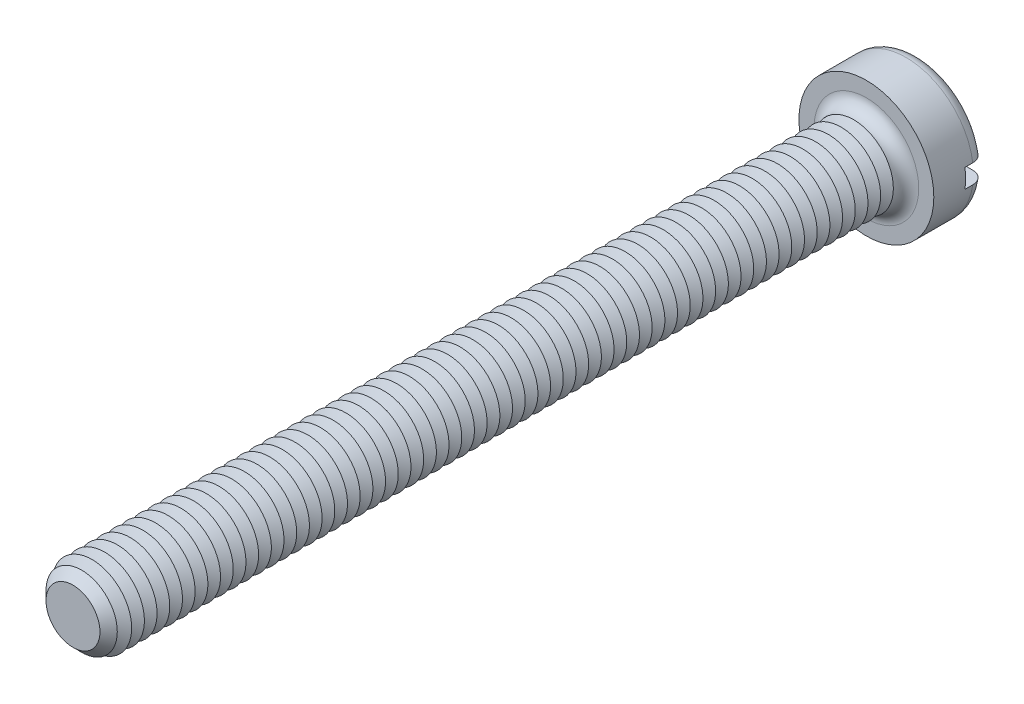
ISO-10303-21;
HEADER;
FILE_DESCRIPTION(('STEP AP214'),'2;1');
FILE_NAME('part.step','',(''),(''),'','','');
FILE_SCHEMA(('AUTOMOTIVE_DESIGN { 1 0 10303 214 1 1 1 1 }'));
ENDSEC;
DATA;
#1=APPLICATION_CONTEXT('core data for automotive mechanical design processes');
#2=APPLICATION_PROTOCOL_DEFINITION('international standard','automotive_design',2000,#1);
#3=PRODUCT_CONTEXT('',#1,'mechanical');
#4=PRODUCT('Part','Part','',(#3));
#5=PRODUCT_RELATED_PRODUCT_CATEGORY('part','',(#4));
#6=PRODUCT_DEFINITION_FORMATION('','',#4);
#7=PRODUCT_DEFINITION_CONTEXT('part definition',#1,'design');
#8=PRODUCT_DEFINITION('design','',#6,#7);
#9=PRODUCT_DEFINITION_SHAPE('','',#8);
#10=(LENGTH_UNIT() NAMED_UNIT(*) SI_UNIT(.MILLI.,.METRE.));
#11=(NAMED_UNIT(*) PLANE_ANGLE_UNIT() SI_UNIT($,.RADIAN.));
#12=(NAMED_UNIT(*) SI_UNIT($,.STERADIAN.) SOLID_ANGLE_UNIT());
#13=UNCERTAINTY_MEASURE_WITH_UNIT(LENGTH_MEASURE(1.E-05),#10,'distance_accuracy_value','');
#14=(GEOMETRIC_REPRESENTATION_CONTEXT(3) GLOBAL_UNCERTAINTY_ASSIGNED_CONTEXT((#13)) GLOBAL_UNIT_ASSIGNED_CONTEXT((#10,
#11,#12)) REPRESENTATION_CONTEXT('',''));
#15=CARTESIAN_POINT('',(0.,0.,0.));
#16=DIRECTION('',(0.,0.,1.));
#17=DIRECTION('',(1.,0.,0.));
#18=AXIS2_PLACEMENT_3D('',#15,#16,#17);
#19=CARTESIAN_POINT('',(0.,0.,-3.3));
#20=DIRECTION('',(0.,0.,1.));
#21=DIRECTION('',(1.,0.,0.));
#22=AXIS2_PLACEMENT_3D('',#19,#20,#21);
#23=PLANE('',#22);
#24=CARTESIAN_POINT('',(0.,0.,-3.3));
#25=DIRECTION('',(0.,0.,1.));
#26=DIRECTION('',(1.,0.,0.));
#27=AXIS2_PLACEMENT_3D('',#24,#25,#26);
#28=CIRCLE('',#27,3.45);
#29=CARTESIAN_POINT('',(-3.39742549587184,0.6,-3.3));
#30=VERTEX_POINT('',#29);
#31=CARTESIAN_POINT('',(3.39742549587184,0.6,-3.3));
#32=VERTEX_POINT('',#31);
#33=EDGE_CURVE('E116',#30,#32,#28,.F.);
#34=ORIENTED_EDGE('',*,*,#33,.T.);
#35=DIRECTION('',(1.,0.,0.));
#36=VECTOR('',#35,1.);
#37=CARTESIAN_POINT('',(-4.25,0.600000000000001,-3.3));
#38=LINE('',#37,#36);
#39=EDGE_CURVE('E111',#30,#32,#38,.T.);
#40=ORIENTED_EDGE('',*,*,#39,.F.);
#41=EDGE_LOOP('',(#34,#40));
#42=FACE_BOUND('',#41,.T.);
#43=ADVANCED_FACE('F39',(#42),#23,.F.);
#44=CARTESIAN_POINT('',(0.,0.,-2.5));
#45=DIRECTION('',(0.,0.,1.));
#46=DIRECTION('',(1.,0.,0.));
#47=AXIS2_PLACEMENT_3D('',#44,#45,#46);
#48=TOROIDAL_SURFACE('',#47,3.45,0.8);
#49=CARTESIAN_POINT('',(-4.06369072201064,0.600000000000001,-2.95537828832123));
#50=CARTESIAN_POINT('',(-4.03774340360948,0.600000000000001,-2.99245078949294));
#51=CARTESIAN_POINT('',(-4.00861849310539,0.600000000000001,-3.02734231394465));
#52=CARTESIAN_POINT('',(-3.94488199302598,0.600000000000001,-3.0917502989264));
#53=CARTESIAN_POINT('',(-3.91026320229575,0.600000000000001,-3.12125959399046));
#54=CARTESIAN_POINT('',(-3.83660561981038,0.600000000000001,-3.17403695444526));
#55=CARTESIAN_POINT('',(-3.79757117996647,0.6,-3.19731109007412));
#56=CARTESIAN_POINT('',(-3.71618817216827,0.6,-3.23703443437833));
#57=CARTESIAN_POINT('',(-3.67384041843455,0.6,-3.25348531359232));
#58=CARTESIAN_POINT('',(-3.58661930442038,0.6,-3.2792758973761));
#59=CARTESIAN_POINT('',(-3.54172669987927,0.6,-3.288550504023));
#60=CARTESIAN_POINT('',(-3.45102322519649,0.6,-3.29952632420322));
#61=CARTESIAN_POINT('',(-3.40521225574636,0.6,-3.30122671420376));
#62=CARTESIAN_POINT('',(-3.31340831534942,0.6,-3.29701196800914));
#63=CARTESIAN_POINT('',(-3.26741940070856,0.6,-3.29100823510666));
#64=CARTESIAN_POINT('',(-3.17708556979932,0.6,-3.27141469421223));
#65=CARTESIAN_POINT('',(-3.13274074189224,0.6,-3.25782447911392));
#66=CARTESIAN_POINT('',(-3.0466814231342,0.6,-3.22332549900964));
#67=CARTESIAN_POINT('',(-3.00498444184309,0.6,-3.20237301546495));
#68=CARTESIAN_POINT('',(-2.92572251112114,0.6,-3.15372961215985));
#69=CARTESIAN_POINT('',(-2.88815755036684,0.6,-3.12603871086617));
#70=CARTESIAN_POINT('',(-2.81847654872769,0.6,-3.06483322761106));
#71=CARTESIAN_POINT('',(-2.78633186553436,0.6,-3.03135128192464));
#72=CARTESIAN_POINT('',(-2.72824805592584,0.6,-2.95937651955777));
#73=CARTESIAN_POINT('',(-2.70230829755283,0.6,-2.92088421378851));
#74=CARTESIAN_POINT('',(-2.65791262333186,0.6,-2.84074227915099));
#75=CARTESIAN_POINT('',(-2.63932560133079,0.6,-2.79916531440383));
#76=CARTESIAN_POINT('',(-2.60958432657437,0.6,-2.7134333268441));
#77=CARTESIAN_POINT('',(-2.59842889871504,0.6,-2.66927871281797));
#78=CARTESIAN_POINT('',(-2.58411140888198,0.6,-2.58073966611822));
#79=CARTESIAN_POINT('',(-2.58077086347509,0.6,-2.5363840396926));
#80=CARTESIAN_POINT('',(-2.58167367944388,0.6,-2.44775208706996));
#81=CARTESIAN_POINT('',(-2.58591644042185,0.6,-2.40347575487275));
#82=CARTESIAN_POINT('',(-2.60175154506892,0.6,-2.31675105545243));
#83=CARTESIAN_POINT('',(-2.61326489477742,0.6,-2.27428821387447));
#84=CARTESIAN_POINT('',(-2.6431863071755,0.6,-2.19186794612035));
#85=CARTESIAN_POINT('',(-2.66159465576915,0.6,-2.15191062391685));
#86=CARTESIAN_POINT('',(-2.70494650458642,0.6,-2.07517696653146));
#87=CARTESIAN_POINT('',(-2.72995486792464,0.6,-2.03843731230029));
#88=CARTESIAN_POINT('',(-2.7856570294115,0.6,-1.96955746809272));
#89=CARTESIAN_POINT('',(-2.81635145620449,0.6,-1.93741778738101));
#90=CARTESIAN_POINT('',(-2.88329572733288,0.6,-1.87788048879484));
#91=CARTESIAN_POINT('',(-2.91965530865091,0.6,-1.85060625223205));
#92=CARTESIAN_POINT('',(-2.9963658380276,0.6,-1.80241044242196));
#93=CARTESIAN_POINT('',(-3.03671721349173,0.6,-1.78148955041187));
#94=CARTESIAN_POINT('',(-3.12111125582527,0.6,-1.74619829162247));
#95=CARTESIAN_POINT('',(-3.16521020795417,0.6,-1.73196239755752));
#96=CARTESIAN_POINT('',(-3.25516487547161,0.6,-1.71103773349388));
#97=CARTESIAN_POINT('',(-3.30102068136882,0.6,-1.70434935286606));
#98=CARTESIAN_POINT('',(-3.39352689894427,0.6,-1.69870104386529));
#99=CARTESIAN_POINT('',(-3.44018061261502,0.6,-1.69979487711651));
#100=CARTESIAN_POINT('',(-3.53263583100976,0.6,-1.70983959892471));
#101=CARTESIAN_POINT('',(-3.57843734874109,0.6,-1.71879036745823));
#102=CARTESIAN_POINT('',(-3.66763544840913,0.6,-1.74426972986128));
#103=CARTESIAN_POINT('',(-3.71104292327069,0.6,-1.76076015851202));
#104=CARTESIAN_POINT('',(-3.79442616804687,0.6,-1.80087686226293));
#105=CARTESIAN_POINT('',(-3.83440212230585,0.600000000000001,-1.82450275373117));
#106=CARTESIAN_POINT('',(-3.90929765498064,0.600000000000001,-1.87793548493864));
#107=CARTESIAN_POINT('',(-3.94426963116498,0.600000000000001,-1.90766887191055));
#108=CARTESIAN_POINT('',(-4.00864839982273,0.600000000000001,-1.9726503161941));
#109=CARTESIAN_POINT('',(-4.03805555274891,0.600000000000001,-2.00789801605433));
#110=CARTESIAN_POINT('',(-4.09009460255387,0.600000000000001,-2.08244463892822));
#111=CARTESIAN_POINT('',(-4.11280448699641,0.600000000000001,-2.12168912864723));
#112=CARTESIAN_POINT('',(-4.15124086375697,0.600000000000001,-2.2034588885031));
#113=CARTESIAN_POINT('',(-4.16696802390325,0.600000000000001,-2.24598384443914));
#114=CARTESIAN_POINT('',(-4.19085131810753,0.600000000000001,-2.33267862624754));
#115=CARTESIAN_POINT('',(-4.19907708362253,0.600000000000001,-2.37682928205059));
#116=CARTESIAN_POINT('',(-4.2079638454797,0.600000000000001,-2.46589754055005));
#117=CARTESIAN_POINT('',(-4.20862315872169,0.600000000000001,-2.51081531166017));
#118=CARTESIAN_POINT('',(-4.20236829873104,0.600000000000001,-2.59993343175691));
#119=CARTESIAN_POINT('',(-4.19548454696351,0.600000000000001,-2.64413593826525));
#120=CARTESIAN_POINT('',(-4.17439924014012,0.600000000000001,-2.73071930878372));
#121=CARTESIAN_POINT('',(-4.16020675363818,0.600000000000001,-2.77310235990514));
#122=CARTESIAN_POINT('',(-4.1318825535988,0.600000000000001,-2.83880495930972));
#123=CARTESIAN_POINT('',(-4.11991183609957,0.600000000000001,-2.86307959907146));
#124=CARTESIAN_POINT('',(-4.09356927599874,0.600000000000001,-2.91028856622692));
#125=CARTESIAN_POINT('',(-4.07919744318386,0.600000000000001,-2.9332228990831));
#126=CARTESIAN_POINT('',(-4.06369072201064,0.600000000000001,-2.95537828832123));
#127=B_SPLINE_CURVE_WITH_KNOTS('',3,(#49,#50,#51,#52,#53,#54,#55,#56,#57,#58,#59,#60,#61,#62,
#63,#64,#65,#66,#67,#68,#69,#70,#71,#72,#73,#74,#75,#76,#77,#78,#79,#80,#81,#82,#83,#84,#85,#86,
#87,#88,#89,#90,#91,#92,#93,#94,#95,#96,#97,#98,#99,#100,#101,#102,#103,#104,#105,#106,#107,
#108,#109,#110,#111,#112,#113,#114,#115,#116,#117,#118,#119,#120,#121,#122,#123,#124,#125,#126),
.UNSPECIFIED.,.T.,.F.,(4,2,2,2,2,2,2,2,2,2,2,2,2,2,2,2,2,2,2,2,2,2,2,2,2,2,2,2,2,2,2,2,2,2,2,2,
2,2,4),(0.,0.13565225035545,0.271483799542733,0.407182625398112,0.542848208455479,
0.679730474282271,0.816627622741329,0.955113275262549,1.09360635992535,1.23293614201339,
1.37226554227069,1.51083389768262,1.64938813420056,1.78534653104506,1.92128342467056,
2.0540840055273,2.18687407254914,2.31824564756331,2.44962267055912,2.58234229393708,
2.71507659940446,2.85080630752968,2.98655056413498,3.12491938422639,3.26329534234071,
3.40262816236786,3.54195885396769,3.68059194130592,3.81921757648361,3.95626453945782,
4.09330262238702,4.2286754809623,4.36403538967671,4.49812564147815,4.63224572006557,
4.76582687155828,4.89924267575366,4.98031194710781,5.0613808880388),.UNSPECIFIED.);
#128=CARTESIAN_POINT('',(-4.20743389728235,0.600000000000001,-2.50000000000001));
#129=VERTEX_POINT('',#128);
#130=EDGE_CURVE('E672',#129,#30,#127,.T.);
#131=ORIENTED_EDGE('',*,*,#130,.F.);
#132=CARTESIAN_POINT('',(0.,0.,-2.5));
#133=DIRECTION('',(0.,0.,1.));
#134=DIRECTION('',(1.,0.,0.));
#135=AXIS2_PLACEMENT_3D('',#132,#133,#134);
#136=CIRCLE('',#135,4.25);
#137=CARTESIAN_POINT('',(4.20743389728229,0.599999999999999,-2.5));
#138=VERTEX_POINT('',#137);
#139=EDGE_CURVE('E124',#138,#129,#136,.T.);
#140=ORIENTED_EDGE('',*,*,#139,.F.);
#141=CARTESIAN_POINT('',(2.63947327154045,0.6,-2.79608831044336));
#142=CARTESIAN_POINT('',(2.65655980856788,0.6,-2.83790320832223));
#143=CARTESIAN_POINT('',(2.67725642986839,0.6,-2.87828303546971));
#144=CARTESIAN_POINT('',(2.72519250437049,0.6,-2.95500233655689));
#145=CARTESIAN_POINT('',(2.75244152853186,0.6,-2.9913357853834));
#146=CARTESIAN_POINT('',(2.81257938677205,0.6,-3.05889430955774));
#147=CARTESIAN_POINT('',(2.84545995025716,0.6,-3.09012674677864));
#148=CARTESIAN_POINT('',(2.91591143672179,0.6,-3.14672620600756));
#149=CARTESIAN_POINT('',(2.95348119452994,0.6,-3.17209468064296));
#150=CARTESIAN_POINT('',(3.03291143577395,0.6,-3.21669611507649));
#151=CARTESIAN_POINT('',(3.07483186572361,0.6,-3.23582234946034));
#152=CARTESIAN_POINT('',(3.16126659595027,0.6,-3.26686062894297));
#153=CARTESIAN_POINT('',(3.2057811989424,0.6,-3.27877183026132));
#154=CARTESIAN_POINT('',(3.29669878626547,0.6,-3.29514603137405));
#155=CARTESIAN_POINT('',(3.34311773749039,0.6,-3.29952056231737));
#156=CARTESIAN_POINT('',(3.43603189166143,0.6,-3.30040472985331));
#157=CARTESIAN_POINT('',(3.48252709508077,0.6,-3.29691431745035));
#158=CARTESIAN_POINT('',(3.57420049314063,0.6,-3.28214240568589));
#159=CARTESIAN_POINT('',(3.61938038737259,0.6,-3.27087147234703));
#160=CARTESIAN_POINT('',(3.70717477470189,0.6,-3.24082890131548));
#161=CARTESIAN_POINT('',(3.74978938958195,0.6,-3.22205762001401));
#162=CARTESIAN_POINT('',(3.83078828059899,0.6,-3.17773607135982));
#163=CARTESIAN_POINT('',(3.86921015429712,0.599999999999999,-3.15225453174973));
#164=CARTESIAN_POINT('',(3.94116038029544,0.599999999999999,-3.09512672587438));
#165=CARTESIAN_POINT('',(3.9746890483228,0.599999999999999,-3.06348085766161));
#166=CARTESIAN_POINT('',(4.03545911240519,0.599999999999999,-2.99534640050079));
#167=CARTESIAN_POINT('',(4.06277344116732,0.599999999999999,-2.95892285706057));
#168=CARTESIAN_POINT('',(4.11082191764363,0.599999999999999,-2.88196698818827));
#169=CARTESIAN_POINT('',(4.13155647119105,0.599999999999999,-2.84143491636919));
#170=CARTESIAN_POINT('',(4.16563480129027,0.599999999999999,-2.75787550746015));
#171=CARTESIAN_POINT('',(4.1790544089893,0.599999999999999,-2.71487908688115));
#172=CARTESIAN_POINT('',(4.19843340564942,0.599999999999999,-2.62723691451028));
#173=CARTESIAN_POINT('',(4.20439310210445,0.599999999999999,-2.58259123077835));
#174=CARTESIAN_POINT('',(4.2086595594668,0.599999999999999,-2.49321831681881));
#175=CARTESIAN_POINT('',(4.20701422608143,0.599999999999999,-2.4484933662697));
#176=CARTESIAN_POINT('',(4.1962295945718,0.599999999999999,-2.35995704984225));
#177=CARTESIAN_POINT('',(4.18709040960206,0.599999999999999,-2.31614567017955));
#178=CARTESIAN_POINT('',(4.16160290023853,0.599999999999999,-2.23072100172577));
#179=CARTESIAN_POINT('',(4.14526169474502,0.599999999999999,-2.18910558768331));
#180=CARTESIAN_POINT('',(4.10585410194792,0.599999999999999,-2.10919238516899));
#181=CARTESIAN_POINT('',(4.08278762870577,0.599999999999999,-2.07089463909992));
#182=CARTESIAN_POINT('',(4.030487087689,0.599999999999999,-1.99851484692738));
#183=CARTESIAN_POINT('',(4.00122628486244,0.599999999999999,-1.9644521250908));
#184=CARTESIAN_POINT('',(3.93744772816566,0.599999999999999,-1.90166877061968));
#185=CARTESIAN_POINT('',(3.90292977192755,0.599999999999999,-1.87294834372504));
#186=CARTESIAN_POINT('',(3.82928727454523,0.599999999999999,-1.82137853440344));
#187=CARTESIAN_POINT('',(3.79012374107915,0.6,-1.79858484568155));
#188=CARTESIAN_POINT('',(3.70856025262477,0.6,-1.75980712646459));
#189=CARTESIAN_POINT('',(3.66616010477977,0.6,-1.74382350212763));
#190=CARTESIAN_POINT('',(3.57878495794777,0.6,-1.71891499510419));
#191=CARTESIAN_POINT('',(3.53378519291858,0.6,-1.71007699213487));
#192=CARTESIAN_POINT('',(3.44294322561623,0.6,-1.69998722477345));
#193=CARTESIAN_POINT('',(3.3971009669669,0.6,-1.69873596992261));
#194=CARTESIAN_POINT('',(3.30531297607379,0.6,-1.70385439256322));
#195=CARTESIAN_POINT('',(3.25937213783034,0.6,-1.71031204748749));
#196=CARTESIAN_POINT('',(3.1692099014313,0.6,-1.73080107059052));
#197=CARTESIAN_POINT('',(3.12498860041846,0.6,-1.74483286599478));
#198=CARTESIAN_POINT('',(3.03926209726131,0.6,-1.78018941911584));
#199=CARTESIAN_POINT('',(2.99777407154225,0.6,-1.80155586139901));
#200=CARTESIAN_POINT('',(2.91899881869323,0.6,-1.85098881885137));
#201=CARTESIAN_POINT('',(2.88171158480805,0.6,-1.8790553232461));
#202=CARTESIAN_POINT('',(2.81266124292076,0.6,-1.94094884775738));
#203=CARTESIAN_POINT('',(2.78086710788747,0.6,-1.97474122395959));
#204=CARTESIAN_POINT('',(2.72353615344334,0.6,-2.0472724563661));
#205=CARTESIAN_POINT('',(2.69799841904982,0.6,-2.08601058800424));
#206=CARTESIAN_POINT('',(2.65444718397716,0.6,-2.16655019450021));
#207=CARTESIAN_POINT('',(2.63629889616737,0.6,-2.20827875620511));
#208=CARTESIAN_POINT('',(2.60744942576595,0.6,-2.29424821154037));
#209=CARTESIAN_POINT('',(2.59674901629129,0.6,-2.33848936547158));
#210=CARTESIAN_POINT('',(2.5833312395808,0.6,-2.42714258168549));
#211=CARTESIAN_POINT('',(2.58043995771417,0.6,-2.47152848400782));
#212=CARTESIAN_POINT('',(2.58224493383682,0.6,-2.56010574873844));
#213=CARTESIAN_POINT('',(2.58693104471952,0.6,-2.60429729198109));
#214=CARTESIAN_POINT('',(2.60020046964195,0.6,-2.67311978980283));
#215=CARTESIAN_POINT('',(2.60635343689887,0.6,-2.69824441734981));
#216=CARTESIAN_POINT('',(2.62110140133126,0.6,-2.74776540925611));
#217=CARTESIAN_POINT('',(2.62969634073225,0.6,-2.77216179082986));
#218=CARTESIAN_POINT('',(2.63947327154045,0.6,-2.79608831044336));
#219=B_SPLINE_CURVE_WITH_KNOTS('',3,(#141,#142,#143,#144,#145,#146,#147,#148,#149,#150,#151,
#152,#153,#154,#155,#156,#157,#158,#159,#160,#161,#162,#163,#164,#165,#166,#167,#168,#169,#170,
#171,#172,#173,#174,#175,#176,#177,#178,#179,#180,#181,#182,#183,#184,#185,#186,#187,#188,#189,
#190,#191,#192,#193,#194,#195,#196,#197,#198,#199,#200,#201,#202,#203,#204,#205,#206,#207,#208,
#209,#210,#211,#212,#213,#214,#215,#216,#217,#218),.UNSPECIFIED.,.T.,.F.,(4,2,2,2,2,2,2,2,2,2,2,
2,2,2,2,2,2,2,2,2,2,2,2,2,2,2,2,2,2,2,2,2,2,2,2,2,2,2,4),(0.,0.135416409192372,
0.271031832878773,0.406449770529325,0.541834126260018,0.679424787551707,0.817031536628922,
0.956242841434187,1.09545501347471,1.23447850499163,1.37349539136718,1.51114036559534,
1.64877645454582,1.78470267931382,1.92062051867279,2.05510117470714,2.1895762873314,
2.32320547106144,2.45683263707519,2.59032801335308,2.72382509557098,2.85791055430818,
2.99200117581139,3.12730969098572,3.26262627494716,3.39956435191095,3.53651162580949,
3.67503685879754,3.81356990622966,3.95290367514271,4.09223721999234,4.23075602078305,
4.36925455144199,4.50509949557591,4.6409585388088,4.77376594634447,4.90639565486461,
4.98388287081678,5.06136825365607),.UNSPECIFIED.);
#220=EDGE_CURVE('E674',#32,#138,#219,.T.);
#221=ORIENTED_EDGE('',*,*,#220,.F.);
#222=ORIENTED_EDGE('',*,*,#33,.F.);
#223=EDGE_LOOP('',(#131,#140,#221,#222));
#224=FACE_BOUND('',#223,.T.);
#225=ADVANCED_FACE('F656',(#224),#48,.T.);
#226=CARTESIAN_POINT('',(0.,0.,-3.3));
#227=DIRECTION('',(0.,0.,1.));
#228=DIRECTION('',(1.,0.,0.));
#229=AXIS2_PLACEMENT_3D('',#226,#227,#228);
#230=CYLINDRICAL_SURFACE('',#229,4.25);
#231=DIRECTION('',(0.,0.,1.));
#232=VECTOR('',#231,1.);
#233=CARTESIAN_POINT('',(4.20743389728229,0.599999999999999,-3.3));
#234=LINE('',#233,#232);
#235=CARTESIAN_POINT('',(4.20743389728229,0.599999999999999,-2.));
#236=VERTEX_POINT('',#235);
#237=EDGE_CURVE('E689',#138,#236,#234,.T.);
#238=ORIENTED_EDGE('',*,*,#237,.F.);
#239=ORIENTED_EDGE('',*,*,#139,.T.);
#240=DIRECTION('',(0.,0.,1.));
#241=VECTOR('',#240,1.);
#242=CARTESIAN_POINT('',(-4.20743389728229,0.600000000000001,-3.3));
#243=LINE('',#242,#241);
#244=CARTESIAN_POINT('',(-4.20743389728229,0.600000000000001,-2.));
#245=VERTEX_POINT('',#244);
#246=EDGE_CURVE('E63',#245,#129,#243,.F.);
#247=ORIENTED_EDGE('',*,*,#246,.F.);
#248=CARTESIAN_POINT('',(0.,0.,-2.));
#249=DIRECTION('',(0.,0.,-1.));
#250=DIRECTION('',(-1.,0.,0.));
#251=AXIS2_PLACEMENT_3D('',#248,#249,#250);
#252=CIRCLE('',#251,4.25);
#253=CARTESIAN_POINT('',(-4.20743389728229,-0.599999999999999,-2.));
#254=VERTEX_POINT('',#253);
#255=EDGE_CURVE('E43',#245,#254,#252,.F.);
#256=ORIENTED_EDGE('',*,*,#255,.T.);
#257=DIRECTION('',(0.,0.,1.));
#258=VECTOR('',#257,1.);
#259=CARTESIAN_POINT('',(-4.20743389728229,-0.599999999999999,-3.3));
#260=LINE('',#259,#258);
#261=CARTESIAN_POINT('',(-4.20743389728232,-0.599999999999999,-2.5));
#262=VERTEX_POINT('',#261);
#263=EDGE_CURVE('E686',#262,#254,#260,.T.);
#264=ORIENTED_EDGE('',*,*,#263,.F.);
#265=CARTESIAN_POINT('',(4.20743389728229,-0.600000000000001,-2.5));
#266=VERTEX_POINT('',#265);
#267=EDGE_CURVE('E126',#262,#266,#136,.T.);
#268=ORIENTED_EDGE('',*,*,#267,.T.);
#269=DIRECTION('',(0.,0.,1.));
#270=VECTOR('',#269,1.);
#271=CARTESIAN_POINT('',(4.20743389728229,-0.600000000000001,-3.3));
#272=LINE('',#271,#270);
#273=CARTESIAN_POINT('',(4.20743389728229,-0.600000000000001,-2.));
#274=VERTEX_POINT('',#273);
#275=EDGE_CURVE('E55',#274,#266,#272,.F.);
#276=ORIENTED_EDGE('',*,*,#275,.F.);
#277=EDGE_CURVE('E11',#274,#236,#252,.F.);
#278=ORIENTED_EDGE('',*,*,#277,.T.);
#279=EDGE_LOOP('',(#238,#239,#247,#256,#264,#268,#276,#278));
#280=FACE_BOUND('',#279,.T.);
#281=CARTESIAN_POINT('',(0.,0.,0.));
#282=DIRECTION('',(0.,0.,1.));
#283=DIRECTION('',(1.,0.,0.));
#284=AXIS2_PLACEMENT_3D('',#281,#282,#283);
#285=CIRCLE('',#284,4.25);
#286=CARTESIAN_POINT('',(4.25,0.,0.));
#287=VERTEX_POINT('',#286);
#288=EDGE_CURVE('E692',#287,#287,#285,.T.);
#289=ORIENTED_EDGE('',*,*,#288,.F.);
#290=EDGE_LOOP('',(#289));
#291=FACE_BOUND('',#290,.T.);
#292=ADVANCED_FACE('F652',(#280,#291),#230,.T.);
#293=CARTESIAN_POINT('',(3.39742549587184,-0.6,-3.3));
#294=VERTEX_POINT('',#293);
#295=CARTESIAN_POINT('',(-3.39742549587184,-0.6,-3.3));
#296=VERTEX_POINT('',#295);
#297=EDGE_CURVE('E109',#294,#296,#28,.F.);
#298=ORIENTED_EDGE('',*,*,#297,.T.);
#299=DIRECTION('',(-1.,0.,0.));
#300=VECTOR('',#299,1.);
#301=CARTESIAN_POINT('',(-4.25,-0.599999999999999,-3.3));
#302=LINE('',#301,#300);
#303=EDGE_CURVE('E96',#294,#296,#302,.T.);
#304=ORIENTED_EDGE('',*,*,#303,.F.);
#305=EDGE_LOOP('',(#298,#304));
#306=FACE_BOUND('',#305,.T.);
#307=ADVANCED_FACE('F108',(#306),#23,.F.);
#308=CARTESIAN_POINT('',(0.,0.,0.));
#309=DIRECTION('',(0.,0.,1.));
#310=DIRECTION('',(1.,0.,0.));
#311=AXIS2_PLACEMENT_3D('',#308,#309,#310);
#312=PLANE('',#311);
#313=CARTESIAN_POINT('',(0.,0.,0.));
#314=DIRECTION('',(0.,0.,1.));
#315=DIRECTION('',(1.,0.,0.));
#316=AXIS2_PLACEMENT_3D('',#313,#314,#315);
#317=CIRCLE('',#316,3.3);
#318=CARTESIAN_POINT('',(3.3,0.,0.));
#319=VERTEX_POINT('',#318);
#320=EDGE_CURVE('E115',#319,#319,#317,.F.);
#321=ORIENTED_EDGE('',*,*,#320,.T.);
#322=EDGE_LOOP('',(#321));
#323=FACE_BOUND('',#322,.T.);
#324=ORIENTED_EDGE('',*,*,#288,.T.);
#325=EDGE_LOOP('',(#324));
#326=FACE_BOUND('',#325,.T.);
#327=ADVANCED_FACE('F651',(#323,#326),#312,.T.);
#328=CARTESIAN_POINT('',(-4.06369072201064,-0.599999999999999,-2.95537828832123));
#329=CARTESIAN_POINT('',(-4.08928577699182,-0.599999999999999,-2.91880204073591));
#330=CARTESIAN_POINT('',(-4.11182555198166,-0.599999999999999,-2.88005030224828));
#331=CARTESIAN_POINT('',(-4.15010404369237,-0.599999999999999,-2.79928452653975));
#332=CARTESIAN_POINT('',(-4.16583526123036,-0.599999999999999,-2.75726695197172));
#333=CARTESIAN_POINT('',(-4.19000286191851,-0.599999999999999,-2.67118996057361));
#334=CARTESIAN_POINT('',(-4.19844101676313,-0.599999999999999,-2.62713104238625));
#335=CARTESIAN_POINT('',(-4.20777174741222,-0.599999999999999,-2.53823222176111));
#336=CARTESIAN_POINT('',(-4.20866608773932,-0.599999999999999,-2.49339250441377));
#337=CARTESIAN_POINT('',(-4.20289683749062,-0.599999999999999,-2.40433856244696));
#338=CARTESIAN_POINT('',(-4.19625607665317,-0.599999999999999,-2.36012285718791));
#339=CARTESIAN_POINT('',(-4.17565084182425,-0.599999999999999,-2.27343166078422));
#340=CARTESIAN_POINT('',(-4.16168615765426,-0.599999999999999,-2.23095621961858));
#341=CARTESIAN_POINT('',(-4.12683188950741,-0.599999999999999,-2.14890863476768));
#342=CARTESIAN_POINT('',(-4.10593663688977,-0.599999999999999,-2.10933890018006));
#343=CARTESIAN_POINT('',(-4.05783763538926,-0.599999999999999,-2.03424145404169));
#344=CARTESIAN_POINT('',(-4.03063375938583,-0.599999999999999,-1.99871382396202));
#345=CARTESIAN_POINT('',(-3.97052236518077,-0.599999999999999,-1.93246905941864));
#346=CARTESIAN_POINT('',(-3.93758114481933,-0.599999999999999,-1.90178251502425));
#347=CARTESIAN_POINT('',(-3.86706007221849,-0.599999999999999,-1.84630837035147));
#348=CARTESIAN_POINT('',(-3.82948001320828,-0.6,-1.82152103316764));
#349=CARTESIAN_POINT('',(-3.75033766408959,-0.6,-1.77826995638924));
#350=CARTESIAN_POINT('',(-3.70873831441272,-0.6,-1.7598740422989));
#351=CARTESIAN_POINT('',(-3.62306661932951,-0.6,-1.73023196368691));
#352=CARTESIAN_POINT('',(-3.57899411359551,-0.6,-1.71898626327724));
#353=CARTESIAN_POINT('',(-3.48904845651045,-0.6,-1.70382025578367));
#354=CARTESIAN_POINT('',(-3.44315982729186,-0.6,-1.69999172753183));
#355=CARTESIAN_POINT('',(-3.35138360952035,-0.6,-1.7000083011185));
#356=CARTESIAN_POINT('',(-3.30549602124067,-0.6,-1.70385391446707));
#357=CARTESIAN_POINT('',(-3.21452492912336,-0.6,-1.71917227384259));
#358=CARTESIAN_POINT('',(-3.16945455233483,-0.6,-1.73072307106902));
#359=CARTESIAN_POINT('',(-3.08188104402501,-0.6,-1.76120640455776));
#360=CARTESIAN_POINT('',(-3.0393780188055,-0.6,-1.78013924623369));
#361=CARTESIAN_POINT('',(-2.95805296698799,-0.6,-1.82493384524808));
#362=CARTESIAN_POINT('',(-2.9192403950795,-0.6,-1.85081278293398));
#363=CARTESIAN_POINT('',(-2.84656695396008,-0.6,-1.90878317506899));
#364=CARTESIAN_POINT('',(-2.81270591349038,-0.6,-1.94087441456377));
#365=CARTESIAN_POINT('',(-2.75131050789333,-0.6,-2.01002500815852));
#366=CARTESIAN_POINT('',(-2.72371339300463,-0.6,-2.04702860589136));
#367=CARTESIAN_POINT('',(-2.67528742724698,-0.6,-2.12522869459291));
#368=CARTESIAN_POINT('',(-2.65445765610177,-0.6,-2.1664246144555));
#369=CARTESIAN_POINT('',(-2.62065354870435,-0.6,-2.25087266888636));
#370=CARTESIAN_POINT('',(-2.60751663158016,-0.6,-2.29405971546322));
#371=CARTESIAN_POINT('',(-2.58885106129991,-0.6,-2.38204659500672));
#372=CARTESIAN_POINT('',(-2.58332131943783,-0.6,-2.42684619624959));
#373=CARTESIAN_POINT('',(-2.58009777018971,-0.6,-2.51580379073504));
#374=CARTESIAN_POINT('',(-2.58224575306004,-0.6,-2.55995612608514));
#375=CARTESIAN_POINT('',(-2.59395205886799,-0.6,-2.64726495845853));
#376=CARTESIAN_POINT('',(-2.60351013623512,-0.6,-2.69042148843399));
#377=CARTESIAN_POINT('',(-2.62967159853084,-0.6,-2.77438771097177));
#378=CARTESIAN_POINT('',(-2.64625243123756,-0.6,-2.81520444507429));
#379=CARTESIAN_POINT('',(-2.68592348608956,-0.6,-2.89353901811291));
#380=CARTESIAN_POINT('',(-2.70901418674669,-0.6,-2.9310566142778));
#381=CARTESIAN_POINT('',(-2.7614318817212,-0.6,-3.00240040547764));
#382=CARTESIAN_POINT('',(-2.79085487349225,-0.6,-3.03615603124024));
#383=CARTESIAN_POINT('',(-2.85483456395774,-0.6,-3.09838834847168));
#384=CARTESIAN_POINT('',(-2.88939187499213,-0.6,-3.12686440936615));
#385=CARTESIAN_POINT('',(-2.96351967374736,-0.6,-3.17841283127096));
#386=CARTESIAN_POINT('',(-3.00318741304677,-0.6,-3.20134539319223));
#387=CARTESIAN_POINT('',(-3.08576649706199,-0.6,-3.24034364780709));
#388=CARTESIAN_POINT('',(-3.12867814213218,-0.6,-3.25640870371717));
#389=CARTESIAN_POINT('',(-3.21724048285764,-0.6,-3.28143816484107));
#390=CARTESIAN_POINT('',(-3.26292314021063,-0.6,-3.29028963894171));
#391=CARTESIAN_POINT('',(-3.35512527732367,-0.6,-3.30021681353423));
#392=CARTESIAN_POINT('',(-3.40164474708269,-0.6,-3.30129260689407));
#393=CARTESIAN_POINT('',(-3.49429978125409,-0.6,-3.29560589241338));
#394=CARTESIAN_POINT('',(-3.54043436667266,-0.6,-3.28882735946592));
#395=CARTESIAN_POINT('',(-3.63090382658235,-0.6,-3.26755492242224));
#396=CARTESIAN_POINT('',(-3.67523831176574,-0.6,-3.25305935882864));
#397=CARTESIAN_POINT('',(-3.76046509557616,-0.6,-3.21686867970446));
#398=CARTESIAN_POINT('',(-3.80138087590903,-0.599999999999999,-3.1952288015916));
#399=CARTESIAN_POINT('',(-3.8788986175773,-0.599999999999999,-3.14531817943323));
#400=CARTESIAN_POINT('',(-3.91550599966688,-0.599999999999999,-3.11705590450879));
#401=CARTESIAN_POINT('',(-3.97074313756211,-0.599999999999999,-3.06628809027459));
#402=CARTESIAN_POINT('',(-3.99100743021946,-0.599999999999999,-3.04553102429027));
#403=CARTESIAN_POINT('',(-4.02917385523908,-0.599999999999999,-3.00194762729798));
#404=CARTESIAN_POINT('',(-4.04707600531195,-0.599999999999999,-2.97912131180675));
#405=CARTESIAN_POINT('',(-4.06369072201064,-0.599999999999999,-2.95537828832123));
#406=B_SPLINE_CURVE_WITH_KNOTS('',3,(#328,#329,#330,#331,#332,#333,#334,#335,#336,#337,#338,
#339,#340,#341,#342,#343,#344,#345,#346,#347,#348,#349,#350,#351,#352,#353,#354,#355,#356,#357,
#358,#359,#360,#361,#362,#363,#364,#365,#366,#367,#368,#369,#370,#371,#372,#373,#374,#375,#376,
#377,#378,#379,#380,#381,#382,#383,#384,#385,#386,#387,#388,#389,#390,#391,#392,#393,#394,#395,
#396,#397,#398,#399,#400,#401,#402,#403,#404,#405),.UNSPECIFIED.,.T.,.F.,(4,2,2,2,2,2,2,2,2,2,2,
2,2,2,2,2,2,2,2,2,2,2,2,2,2,2,2,2,2,2,2,2,2,2,2,2,2,2,4),(0.,0.133821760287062,
0.267790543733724,0.401726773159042,0.535631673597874,0.669131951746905,0.802636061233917,
0.936249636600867,1.06986590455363,1.2042952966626,1.3387306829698,1.47455198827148,
1.61038210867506,1.74788249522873,1.88539204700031,2.02431612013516,2.16324594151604,
2.30252260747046,2.4417944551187,2.57960263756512,2.71739207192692,2.85215325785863,
2.98689515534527,3.11887666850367,3.25085380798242,3.38241030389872,3.51397647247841,
3.64769871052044,3.78143690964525,3.91826005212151,4.05509587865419,4.19403485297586,
4.33297216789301,4.47219345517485,4.61144469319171,4.74964356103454,4.887666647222,
4.97453605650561,5.06140481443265),.UNSPECIFIED.);
#407=EDGE_CURVE('E103',#296,#262,#406,.T.);
#408=ORIENTED_EDGE('',*,*,#407,.F.);
#409=ORIENTED_EDGE('',*,*,#297,.F.);
#410=CARTESIAN_POINT('',(2.63947327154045,-0.6,-2.79608831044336));
#411=CARTESIAN_POINT('',(2.62285766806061,-0.6,-2.75541510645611));
#412=CARTESIAN_POINT('',(2.60963282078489,-0.6,-2.71332585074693));
#413=CARTESIAN_POINT('',(2.59042394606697,-0.6,-2.62749460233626));
#414=CARTESIAN_POINT('',(2.58444686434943,-0.6,-2.58375106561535));
#415=CARTESIAN_POINT('',(2.57995287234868,-0.6,-2.49588524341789));
#416=CARTESIAN_POINT('',(2.58143477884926,-0.6,-2.45176301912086));
#417=CARTESIAN_POINT('',(2.59180622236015,-0.6,-2.36440906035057));
#418=CARTESIAN_POINT('',(2.60069434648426,-0.6,-2.32117715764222));
#419=CARTESIAN_POINT('',(2.62554964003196,-0.6,-2.23689909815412));
#420=CARTESIAN_POINT('',(2.6415022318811,-0.6,-2.19584863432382));
#421=CARTESIAN_POINT('',(2.67996913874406,-0.6,-2.11694797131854));
#422=CARTESIAN_POINT('',(2.70248409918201,-0.6,-2.07909808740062));
#423=CARTESIAN_POINT('',(2.75378972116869,-0.6,-2.00702296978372));
#424=CARTESIAN_POINT('',(2.7826732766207,-0.6,-1.97286389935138));
#425=CARTESIAN_POINT('',(2.84564717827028,-0.6,-1.90974167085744));
#426=CARTESIAN_POINT('',(2.87973812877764,-0.6,-1.88077911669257));
#427=CARTESIAN_POINT('',(2.95300941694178,-0.6,-1.82817307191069));
#428=CARTESIAN_POINT('',(2.99228920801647,-0.6,-1.8046680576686));
#429=CARTESIAN_POINT('',(3.07419050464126,-0.6,-1.76446470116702));
#430=CARTESIAN_POINT('',(3.11681231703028,-0.6,-1.74776698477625));
#431=CARTESIAN_POINT('',(3.20492149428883,-0.6,-1.72140945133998));
#432=CARTESIAN_POINT('',(3.25044365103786,-0.6,-1.71186578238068));
#433=CARTESIAN_POINT('',(3.34244451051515,-0.6,-1.70053183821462));
#434=CARTESIAN_POINT('',(3.38892324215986,-0.6,-1.69874179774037));
#435=CARTESIAN_POINT('',(3.48165030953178,-0.6,-1.70299737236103));
#436=CARTESIAN_POINT('',(3.52789766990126,-0.6,-1.70906439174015));
#437=CARTESIAN_POINT('',(3.61869999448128,-0.6,-1.72893768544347));
#438=CARTESIAN_POINT('',(3.6632550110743,-0.6,-1.742743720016));
#439=CARTESIAN_POINT('',(3.7490339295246,-0.6,-1.77760539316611));
#440=CARTESIAN_POINT('',(3.79028083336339,-0.600000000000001,-1.79860440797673));
#441=CARTESIAN_POINT('',(3.86860401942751,-0.600000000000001,-1.84731105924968));
#442=CARTESIAN_POINT('',(3.90568056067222,-0.600000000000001,-1.87501827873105));
#443=CARTESIAN_POINT('',(3.97412845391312,-0.600000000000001,-1.93599408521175));
#444=CARTESIAN_POINT('',(4.00556369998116,-0.600000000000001,-1.96919094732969));
#445=CARTESIAN_POINT('',(4.06233546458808,-0.600000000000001,-2.0404445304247));
#446=CARTESIAN_POINT('',(4.08767237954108,-0.600000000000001,-2.07850093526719));
#447=CARTESIAN_POINT('',(4.13122502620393,-0.600000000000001,-2.15791791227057));
#448=CARTESIAN_POINT('',(4.14951966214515,-0.600000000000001,-2.19923522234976));
#449=CARTESIAN_POINT('',(4.17884974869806,-0.600000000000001,-2.28437065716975));
#450=CARTESIAN_POINT('',(4.18988555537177,-0.600000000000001,-2.32818865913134));
#451=CARTESIAN_POINT('',(4.20430724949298,-0.600000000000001,-2.41670951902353));
#452=CARTESIAN_POINT('',(4.2077528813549,-0.600000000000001,-2.46140265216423));
#453=CARTESIAN_POINT('',(4.20706844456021,-0.600000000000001,-2.55073028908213));
#454=CARTESIAN_POINT('',(4.20293856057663,-0.600000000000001,-2.595364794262));
#455=CARTESIAN_POINT('',(4.18724926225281,-0.600000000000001,-2.68317733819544));
#456=CARTESIAN_POINT('',(4.17571081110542,-0.600000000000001,-2.72635912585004));
#457=CARTESIAN_POINT('',(4.14556645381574,-0.600000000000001,-2.81017999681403));
#458=CARTESIAN_POINT('',(4.12696052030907,-0.600000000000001,-2.85081907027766));
#459=CARTESIAN_POINT('',(4.08317014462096,-0.600000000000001,-2.92852328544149));
#460=CARTESIAN_POINT('',(4.0579684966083,-0.600000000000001,-2.96557872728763));
#461=CARTESIAN_POINT('',(4.00174565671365,-0.600000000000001,-3.034972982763));
#462=CARTESIAN_POINT('',(3.97072429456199,-0.600000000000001,-3.06731165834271));
#463=CARTESIAN_POINT('',(3.90349659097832,-0.600000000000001,-3.12662735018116));
#464=CARTESIAN_POINT('',(3.86725240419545,-0.600000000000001,-3.15356146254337));
#465=CARTESIAN_POINT('',(3.79079809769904,-0.600000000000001,-3.20104156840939));
#466=CARTESIAN_POINT('',(3.75058775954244,-0.6,-3.22158720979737));
#467=CARTESIAN_POINT('',(3.6668595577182,-0.6,-3.25595832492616));
#468=CARTESIAN_POINT('',(3.62330947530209,-0.6,-3.26970530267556));
#469=CARTESIAN_POINT('',(3.53453348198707,-0.6,-3.28979004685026));
#470=CARTESIAN_POINT('',(3.48930745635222,-0.6,-3.29612730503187));
#471=CARTESIAN_POINT('',(3.39787506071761,-0.6,-3.30128612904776));
#472=CARTESIAN_POINT('',(3.35166346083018,-0.6,-3.30001513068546));
#473=CARTESIAN_POINT('',(3.26009663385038,-0.6,-3.28980210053));
#474=CARTESIAN_POINT('',(3.21474142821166,-0.6,-3.28085987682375));
#475=CARTESIAN_POINT('',(3.12577990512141,-0.6,-3.2554540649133));
#476=CARTESIAN_POINT('',(3.08219120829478,-0.6,-3.23892872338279));
#477=CARTESIAN_POINT('',(2.99839730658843,-0.6,-3.1987810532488));
#478=CARTESIAN_POINT('',(2.95819301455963,-0.6,-3.17515681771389));
#479=CARTESIAN_POINT('',(2.88239372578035,-0.6,-3.12147666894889));
#480=CARTESIAN_POINT('',(2.84679445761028,-0.6,-3.09142678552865));
#481=CARTESIAN_POINT('',(2.78127483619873,-0.6,-3.02571584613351));
#482=CARTESIAN_POINT('',(2.75134725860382,-0.6,-2.99006203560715));
#483=CARTESIAN_POINT('',(2.70767232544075,-0.6,-2.92780516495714));
#484=CARTESIAN_POINT('',(2.69197340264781,-0.6,-2.90254809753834));
#485=CARTESIAN_POINT('',(2.66349078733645,-0.6,-2.8504392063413));
#486=CARTESIAN_POINT('',(2.65070705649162,-0.6,-2.82358740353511));
#487=CARTESIAN_POINT('',(2.63947327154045,-0.6,-2.79608831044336));
#488=B_SPLINE_CURVE_WITH_KNOTS('',3,(#410,#411,#412,#413,#414,#415,#416,#417,#418,#419,#420,
#421,#422,#423,#424,#425,#426,#427,#428,#429,#430,#431,#432,#433,#434,#435,#436,#437,#438,#439,
#440,#441,#442,#443,#444,#445,#446,#447,#448,#449,#450,#451,#452,#453,#454,#455,#456,#457,#458,
#459,#460,#461,#462,#463,#464,#465,#466,#467,#468,#469,#470,#471,#472,#473,#474,#475,#476,#477,
#478,#479,#480,#481,#482,#483,#484,#485,#486,#487),.UNSPECIFIED.,.T.,.F.,(4,2,2,2,2,2,2,2,2,2,2,
2,2,2,2,2,2,2,2,2,2,2,2,2,2,2,2,2,2,2,2,2,2,2,2,2,2,2,4),(0.,0.131701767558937,
0.263529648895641,0.395336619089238,0.527118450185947,0.658629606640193,0.790153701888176,
0.923740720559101,1.05734325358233,1.19403504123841,1.33073939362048,1.46961778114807,
1.60850037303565,1.74776210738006,1.88701952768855,2.02520497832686,2.16338184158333,
2.29987843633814,2.43636615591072,2.57127672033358,2.7061806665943,2.84001889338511,
2.97385385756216,3.1073117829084,3.24077022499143,3.37458034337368,3.50839437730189,
3.64323196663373,3.77807698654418,3.91444452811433,4.05082142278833,4.18886086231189,
4.32690375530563,4.46609131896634,4.60531630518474,4.74441121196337,4.88332773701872,
4.97237227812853,5.06141564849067),.UNSPECIFIED.);
#489=EDGE_CURVE('E92',#266,#294,#488,.T.);
#490=ORIENTED_EDGE('',*,*,#489,.F.);
#491=ORIENTED_EDGE('',*,*,#267,.F.);
#492=EDGE_LOOP('',(#408,#409,#490,#491));
#493=FACE_BOUND('',#492,.T.);
#494=ADVANCED_FACE('F113',(#493),#48,.T.);
#495=CARTESIAN_POINT('',(0.,0.,0.800000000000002));
#496=DIRECTION('',(0.,0.,1.));
#497=DIRECTION('',(1.,0.,0.));
#498=AXIS2_PLACEMENT_3D('',#495,#496,#497);
#499=TOROIDAL_SURFACE('',#498,3.3,0.8);
#500=ORIENTED_EDGE('',*,*,#320,.F.);
#501=EDGE_LOOP('',(#500));
#502=FACE_BOUND('',#501,.T.);
#503=CARTESIAN_POINT('',(0.,0.,0.80000000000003));
#504=DIRECTION('',(0.,0.,-1.));
#505=DIRECTION('',(-1.,0.,0.));
#506=AXIS2_PLACEMENT_3D('',#503,#504,#505);
#507=CIRCLE('',#506,2.5);
#508=CARTESIAN_POINT('',(-2.5,0.,0.80000000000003));
#509=VERTEX_POINT('',#508);
#510=EDGE_CURVE('E697',#509,#509,#507,.T.);
#511=ORIENTED_EDGE('',*,*,#510,.T.);
#512=EDGE_LOOP('',(#511));
#513=FACE_BOUND('',#512,.T.);
#514=ADVANCED_FACE('F644',(#502,#513),#499,.F.);
#515=CARTESIAN_POINT('',(0.,0.,1.20000000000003));
#516=DIRECTION('',(0.,0.,-1.));
#517=DIRECTION('',(-1.,0.,0.));
#518=AXIS2_PLACEMENT_3D('',#515,#516,#517);
#519=CONICAL_SURFACE('',#518,1.80717967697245,1.0471975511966);
#520=ORIENTED_EDGE('',*,*,#510,.F.);
#521=EDGE_LOOP('',(#520));
#522=FACE_BOUND('',#521,.T.);
#523=CARTESIAN_POINT('',(0.,0.,1.20000000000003));
#524=DIRECTION('',(0.,0.,-1.));
#525=DIRECTION('',(-1.,0.,0.));
#526=AXIS2_PLACEMENT_3D('',#523,#524,#525);
#527=CIRCLE('',#526,1.80717967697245);
#528=CARTESIAN_POINT('',(-1.80717967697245,0.,1.20000000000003));
#529=VERTEX_POINT('',#528);
#530=EDGE_CURVE('E703',#529,#529,#527,.T.);
#531=ORIENTED_EDGE('',*,*,#530,.T.);
#532=EDGE_LOOP('',(#531));
#533=FACE_BOUND('',#532,.T.);
#534=ADVANCED_FACE('F640',(#522,#533),#519,.T.);
#535=CARTESIAN_POINT('',(0.,0.,1.60000000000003));
#536=DIRECTION('',(0.,0.,1.));
#537=DIRECTION('',(1.,0.,0.));
#538=AXIS2_PLACEMENT_3D('',#535,#536,#537);
#539=CONICAL_SURFACE('',#538,2.5,1.0471975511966);
#540=ORIENTED_EDGE('',*,*,#530,.F.);
#541=EDGE_LOOP('',(#540));
#542=FACE_BOUND('',#541,.T.);
#543=CARTESIAN_POINT('',(0.,0.,1.60000000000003));
#544=DIRECTION('',(0.,0.,-1.));
#545=DIRECTION('',(-1.,0.,0.));
#546=AXIS2_PLACEMENT_3D('',#543,#544,#545);
#547=CIRCLE('',#546,2.5);
#548=CARTESIAN_POINT('',(-2.5,0.,1.60000000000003));
#549=VERTEX_POINT('',#548);
#550=EDGE_CURVE('E709',#549,#549,#547,.T.);
#551=ORIENTED_EDGE('',*,*,#550,.T.);
#552=EDGE_LOOP('',(#551));
#553=FACE_BOUND('',#552,.T.);
#554=ADVANCED_FACE('F636',(#542,#553),#539,.T.);
#555=CARTESIAN_POINT('',(0.,0.,2.00000000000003));
#556=DIRECTION('',(0.,0.,-1.));
#557=DIRECTION('',(-1.,0.,0.));
#558=AXIS2_PLACEMENT_3D('',#555,#556,#557);
#559=CONICAL_SURFACE('',#558,1.80717967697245,1.0471975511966);
#560=ORIENTED_EDGE('',*,*,#550,.F.);
#561=EDGE_LOOP('',(#560));
#562=FACE_BOUND('',#561,.T.);
#563=CARTESIAN_POINT('',(0.,0.,2.00000000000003));
#564=DIRECTION('',(0.,0.,-1.));
#565=DIRECTION('',(-1.,0.,0.));
#566=AXIS2_PLACEMENT_3D('',#563,#564,#565);
#567=CIRCLE('',#566,1.80717967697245);
#568=CARTESIAN_POINT('',(-1.80717967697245,0.,2.00000000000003));
#569=VERTEX_POINT('',#568);
#570=EDGE_CURVE('E713',#569,#569,#567,.T.);
#571=ORIENTED_EDGE('',*,*,#570,.T.);
#572=EDGE_LOOP('',(#571));
#573=FACE_BOUND('',#572,.T.);
#574=ADVANCED_FACE('F632',(#562,#573),#559,.T.);
#575=CARTESIAN_POINT('',(0.,0.,2.40000000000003));
#576=DIRECTION('',(0.,0.,1.));
#577=DIRECTION('',(1.,0.,0.));
#578=AXIS2_PLACEMENT_3D('',#575,#576,#577);
#579=CONICAL_SURFACE('',#578,2.5,1.0471975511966);
#580=ORIENTED_EDGE('',*,*,#570,.F.);
#581=EDGE_LOOP('',(#580));
#582=FACE_BOUND('',#581,.T.);
#583=CARTESIAN_POINT('',(0.,0.,2.40000000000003));
#584=DIRECTION('',(0.,0.,-1.));
#585=DIRECTION('',(-1.,0.,0.));
#586=AXIS2_PLACEMENT_3D('',#583,#584,#585);
#587=CIRCLE('',#586,2.5);
#588=CARTESIAN_POINT('',(-2.5,0.,2.40000000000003));
#589=VERTEX_POINT('',#588);
#590=EDGE_CURVE('E717',#589,#589,#587,.T.);
#591=ORIENTED_EDGE('',*,*,#590,.T.);
#592=EDGE_LOOP('',(#591));
#593=FACE_BOUND('',#592,.T.);
#594=ADVANCED_FACE('F628',(#582,#593),#579,.T.);
#595=CARTESIAN_POINT('',(0.,0.,2.80000000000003));
#596=DIRECTION('',(0.,0.,-1.));
#597=DIRECTION('',(-1.,0.,0.));
#598=AXIS2_PLACEMENT_3D('',#595,#596,#597);
#599=CONICAL_SURFACE('',#598,1.80717967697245,1.0471975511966);
#600=ORIENTED_EDGE('',*,*,#590,.F.);
#601=EDGE_LOOP('',(#600));
#602=FACE_BOUND('',#601,.T.);
#603=CARTESIAN_POINT('',(0.,0.,2.80000000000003));
#604=DIRECTION('',(0.,0.,-1.));
#605=DIRECTION('',(-1.,0.,0.));
#606=AXIS2_PLACEMENT_3D('',#603,#604,#605);
#607=CIRCLE('',#606,1.80717967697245);
#608=CARTESIAN_POINT('',(-1.80717967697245,0.,2.80000000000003));
#609=VERTEX_POINT('',#608);
#610=EDGE_CURVE('E721',#609,#609,#607,.T.);
#611=ORIENTED_EDGE('',*,*,#610,.T.);
#612=EDGE_LOOP('',(#611));
#613=FACE_BOUND('',#612,.T.);
#614=ADVANCED_FACE('F624',(#602,#613),#599,.T.);
#615=CARTESIAN_POINT('',(0.,0.,3.20000000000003));
#616=DIRECTION('',(0.,0.,1.));
#617=DIRECTION('',(1.,0.,0.));
#618=AXIS2_PLACEMENT_3D('',#615,#616,#617);
#619=CONICAL_SURFACE('',#618,2.5,1.0471975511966);
#620=ORIENTED_EDGE('',*,*,#610,.F.);
#621=EDGE_LOOP('',(#620));
#622=FACE_BOUND('',#621,.T.);
#623=CARTESIAN_POINT('',(0.,0.,3.20000000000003));
#624=DIRECTION('',(0.,0.,-1.));
#625=DIRECTION('',(-1.,0.,0.));
#626=AXIS2_PLACEMENT_3D('',#623,#624,#625);
#627=CIRCLE('',#626,2.5);
#628=CARTESIAN_POINT('',(-2.5,0.,3.20000000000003));
#629=VERTEX_POINT('',#628);
#630=EDGE_CURVE('E725',#629,#629,#627,.T.);
#631=ORIENTED_EDGE('',*,*,#630,.T.);
#632=EDGE_LOOP('',(#631));
#633=FACE_BOUND('',#632,.T.);
#634=ADVANCED_FACE('F620',(#622,#633),#619,.T.);
#635=CARTESIAN_POINT('',(0.,0.,3.60000000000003));
#636=DIRECTION('',(0.,0.,-1.));
#637=DIRECTION('',(-1.,0.,0.));
#638=AXIS2_PLACEMENT_3D('',#635,#636,#637);
#639=CONICAL_SURFACE('',#638,1.80717967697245,1.0471975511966);
#640=ORIENTED_EDGE('',*,*,#630,.F.);
#641=EDGE_LOOP('',(#640));
#642=FACE_BOUND('',#641,.T.);
#643=CARTESIAN_POINT('',(0.,0.,3.60000000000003));
#644=DIRECTION('',(0.,0.,-1.));
#645=DIRECTION('',(-1.,0.,0.));
#646=AXIS2_PLACEMENT_3D('',#643,#644,#645);
#647=CIRCLE('',#646,1.80717967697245);
#648=CARTESIAN_POINT('',(-1.80717967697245,0.,3.60000000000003));
#649=VERTEX_POINT('',#648);
#650=EDGE_CURVE('E728',#649,#649,#647,.T.);
#651=ORIENTED_EDGE('',*,*,#650,.T.);
#652=EDGE_LOOP('',(#651));
#653=FACE_BOUND('',#652,.T.);
#654=ADVANCED_FACE('F616',(#642,#653),#639,.T.);
#655=CARTESIAN_POINT('',(0.,0.,4.00000000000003));
#656=DIRECTION('',(0.,0.,1.));
#657=DIRECTION('',(1.,0.,0.));
#658=AXIS2_PLACEMENT_3D('',#655,#656,#657);
#659=CONICAL_SURFACE('',#658,2.5,1.0471975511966);
#660=ORIENTED_EDGE('',*,*,#650,.F.);
#661=EDGE_LOOP('',(#660));
#662=FACE_BOUND('',#661,.T.);
#663=CARTESIAN_POINT('',(0.,0.,4.00000000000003));
#664=DIRECTION('',(0.,0.,-1.));
#665=DIRECTION('',(-1.,0.,0.));
#666=AXIS2_PLACEMENT_3D('',#663,#664,#665);
#667=CIRCLE('',#666,2.5);
#668=CARTESIAN_POINT('',(-2.5,0.,4.00000000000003));
#669=VERTEX_POINT('',#668);
#670=EDGE_CURVE('E732',#669,#669,#667,.T.);
#671=ORIENTED_EDGE('',*,*,#670,.T.);
#672=EDGE_LOOP('',(#671));
#673=FACE_BOUND('',#672,.T.);
#674=ADVANCED_FACE('F612',(#662,#673),#659,.T.);
#675=CARTESIAN_POINT('',(0.,0.,4.40000000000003));
#676=DIRECTION('',(0.,0.,-1.));
#677=DIRECTION('',(-1.,0.,0.));
#678=AXIS2_PLACEMENT_3D('',#675,#676,#677);
#679=CONICAL_SURFACE('',#678,1.80717967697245,1.0471975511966);
#680=ORIENTED_EDGE('',*,*,#670,.F.);
#681=EDGE_LOOP('',(#680));
#682=FACE_BOUND('',#681,.T.);
#683=CARTESIAN_POINT('',(0.,0.,4.40000000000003));
#684=DIRECTION('',(0.,0.,-1.));
#685=DIRECTION('',(-1.,0.,0.));
#686=AXIS2_PLACEMENT_3D('',#683,#684,#685);
#687=CIRCLE('',#686,1.80717967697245);
#688=CARTESIAN_POINT('',(-1.80717967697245,0.,4.40000000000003));
#689=VERTEX_POINT('',#688);
#690=EDGE_CURVE('E736',#689,#689,#687,.T.);
#691=ORIENTED_EDGE('',*,*,#690,.T.);
#692=EDGE_LOOP('',(#691));
#693=FACE_BOUND('',#692,.T.);
#694=ADVANCED_FACE('F608',(#682,#693),#679,.T.);
#695=CARTESIAN_POINT('',(0.,0.,4.80000000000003));
#696=DIRECTION('',(0.,0.,1.));
#697=DIRECTION('',(1.,0.,0.));
#698=AXIS2_PLACEMENT_3D('',#695,#696,#697);
#699=CONICAL_SURFACE('',#698,2.5,1.0471975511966);
#700=ORIENTED_EDGE('',*,*,#690,.F.);
#701=EDGE_LOOP('',(#700));
#702=FACE_BOUND('',#701,.T.);
#703=CARTESIAN_POINT('',(0.,0.,4.80000000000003));
#704=DIRECTION('',(0.,0.,-1.));
#705=DIRECTION('',(-1.,0.,0.));
#706=AXIS2_PLACEMENT_3D('',#703,#704,#705);
#707=CIRCLE('',#706,2.5);
#708=CARTESIAN_POINT('',(-2.5,0.,4.80000000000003));
#709=VERTEX_POINT('',#708);
#710=EDGE_CURVE('E740',#709,#709,#707,.T.);
#711=ORIENTED_EDGE('',*,*,#710,.T.);
#712=EDGE_LOOP('',(#711));
#713=FACE_BOUND('',#712,.T.);
#714=ADVANCED_FACE('F604',(#702,#713),#699,.T.);
#715=CARTESIAN_POINT('',(0.,0.,5.20000000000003));
#716=DIRECTION('',(0.,0.,-1.));
#717=DIRECTION('',(-1.,0.,0.));
#718=AXIS2_PLACEMENT_3D('',#715,#716,#717);
#719=CONICAL_SURFACE('',#718,1.80717967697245,1.0471975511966);
#720=ORIENTED_EDGE('',*,*,#710,.F.);
#721=EDGE_LOOP('',(#720));
#722=FACE_BOUND('',#721,.T.);
#723=CARTESIAN_POINT('',(0.,0.,5.20000000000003));
#724=DIRECTION('',(0.,0.,-1.));
#725=DIRECTION('',(-1.,0.,0.));
#726=AXIS2_PLACEMENT_3D('',#723,#724,#725);
#727=CIRCLE('',#726,1.80717967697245);
#728=CARTESIAN_POINT('',(-1.80717967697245,0.,5.20000000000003));
#729=VERTEX_POINT('',#728);
#730=EDGE_CURVE('E744',#729,#729,#727,.T.);
#731=ORIENTED_EDGE('',*,*,#730,.T.);
#732=EDGE_LOOP('',(#731));
#733=FACE_BOUND('',#732,.T.);
#734=ADVANCED_FACE('F600',(#722,#733),#719,.T.);
#735=CARTESIAN_POINT('',(0.,0.,5.60000000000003));
#736=DIRECTION('',(0.,0.,1.));
#737=DIRECTION('',(1.,0.,0.));
#738=AXIS2_PLACEMENT_3D('',#735,#736,#737);
#739=CONICAL_SURFACE('',#738,2.5,1.0471975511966);
#740=ORIENTED_EDGE('',*,*,#730,.F.);
#741=EDGE_LOOP('',(#740));
#742=FACE_BOUND('',#741,.T.);
#743=CARTESIAN_POINT('',(0.,0.,5.60000000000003));
#744=DIRECTION('',(0.,0.,-1.));
#745=DIRECTION('',(-1.,0.,0.));
#746=AXIS2_PLACEMENT_3D('',#743,#744,#745);
#747=CIRCLE('',#746,2.5);
#748=CARTESIAN_POINT('',(-2.5,0.,5.60000000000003));
#749=VERTEX_POINT('',#748);
#750=EDGE_CURVE('E748',#749,#749,#747,.T.);
#751=ORIENTED_EDGE('',*,*,#750,.T.);
#752=EDGE_LOOP('',(#751));
#753=FACE_BOUND('',#752,.T.);
#754=ADVANCED_FACE('F596',(#742,#753),#739,.T.);
#755=CARTESIAN_POINT('',(0.,0.,6.00000000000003));
#756=DIRECTION('',(0.,0.,-1.));
#757=DIRECTION('',(-1.,0.,0.));
#758=AXIS2_PLACEMENT_3D('',#755,#756,#757);
#759=CONICAL_SURFACE('',#758,1.80717967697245,1.0471975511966);
#760=ORIENTED_EDGE('',*,*,#750,.F.);
#761=EDGE_LOOP('',(#760));
#762=FACE_BOUND('',#761,.T.);
#763=CARTESIAN_POINT('',(0.,0.,6.00000000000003));
#764=DIRECTION('',(0.,0.,-1.));
#765=DIRECTION('',(-1.,0.,0.));
#766=AXIS2_PLACEMENT_3D('',#763,#764,#765);
#767=CIRCLE('',#766,1.80717967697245);
#768=CARTESIAN_POINT('',(-1.80717967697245,0.,6.00000000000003));
#769=VERTEX_POINT('',#768);
#770=EDGE_CURVE('E752',#769,#769,#767,.T.);
#771=ORIENTED_EDGE('',*,*,#770,.T.);
#772=EDGE_LOOP('',(#771));
#773=FACE_BOUND('',#772,.T.);
#774=ADVANCED_FACE('F592',(#762,#773),#759,.T.);
#775=CARTESIAN_POINT('',(0.,0.,6.40000000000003));
#776=DIRECTION('',(0.,0.,1.));
#777=DIRECTION('',(1.,0.,0.));
#778=AXIS2_PLACEMENT_3D('',#775,#776,#777);
#779=CONICAL_SURFACE('',#778,2.5,1.0471975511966);
#780=ORIENTED_EDGE('',*,*,#770,.F.);
#781=EDGE_LOOP('',(#780));
#782=FACE_BOUND('',#781,.T.);
#783=CARTESIAN_POINT('',(0.,0.,6.40000000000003));
#784=DIRECTION('',(0.,0.,-1.));
#785=DIRECTION('',(-1.,0.,0.));
#786=AXIS2_PLACEMENT_3D('',#783,#784,#785);
#787=CIRCLE('',#786,2.5);
#788=CARTESIAN_POINT('',(-2.5,0.,6.40000000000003));
#789=VERTEX_POINT('',#788);
#790=EDGE_CURVE('E756',#789,#789,#787,.T.);
#791=ORIENTED_EDGE('',*,*,#790,.T.);
#792=EDGE_LOOP('',(#791));
#793=FACE_BOUND('',#792,.T.);
#794=ADVANCED_FACE('F588',(#782,#793),#779,.T.);
#795=CARTESIAN_POINT('',(0.,0.,6.80000000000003));
#796=DIRECTION('',(0.,0.,-1.));
#797=DIRECTION('',(-1.,0.,0.));
#798=AXIS2_PLACEMENT_3D('',#795,#796,#797);
#799=CONICAL_SURFACE('',#798,1.80717967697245,1.0471975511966);
#800=ORIENTED_EDGE('',*,*,#790,.F.);
#801=EDGE_LOOP('',(#800));
#802=FACE_BOUND('',#801,.T.);
#803=CARTESIAN_POINT('',(0.,0.,6.80000000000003));
#804=DIRECTION('',(0.,0.,-1.));
#805=DIRECTION('',(-1.,0.,0.));
#806=AXIS2_PLACEMENT_3D('',#803,#804,#805);
#807=CIRCLE('',#806,1.80717967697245);
#808=CARTESIAN_POINT('',(-1.80717967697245,0.,6.80000000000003));
#809=VERTEX_POINT('',#808);
#810=EDGE_CURVE('E759',#809,#809,#807,.T.);
#811=ORIENTED_EDGE('',*,*,#810,.T.);
#812=EDGE_LOOP('',(#811));
#813=FACE_BOUND('',#812,.T.);
#814=ADVANCED_FACE('F584',(#802,#813),#799,.T.);
#815=CARTESIAN_POINT('',(0.,0.,7.20000000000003));
#816=DIRECTION('',(0.,0.,1.));
#817=DIRECTION('',(1.,0.,0.));
#818=AXIS2_PLACEMENT_3D('',#815,#816,#817);
#819=CONICAL_SURFACE('',#818,2.5,1.0471975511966);
#820=ORIENTED_EDGE('',*,*,#810,.F.);
#821=EDGE_LOOP('',(#820));
#822=FACE_BOUND('',#821,.T.);
#823=CARTESIAN_POINT('',(0.,0.,7.20000000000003));
#824=DIRECTION('',(0.,0.,-1.));
#825=DIRECTION('',(-1.,0.,0.));
#826=AXIS2_PLACEMENT_3D('',#823,#824,#825);
#827=CIRCLE('',#826,2.5);
#828=CARTESIAN_POINT('',(-2.5,0.,7.20000000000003));
#829=VERTEX_POINT('',#828);
#830=EDGE_CURVE('E763',#829,#829,#827,.T.);
#831=ORIENTED_EDGE('',*,*,#830,.T.);
#832=EDGE_LOOP('',(#831));
#833=FACE_BOUND('',#832,.T.);
#834=ADVANCED_FACE('F580',(#822,#833),#819,.T.);
#835=CARTESIAN_POINT('',(0.,0.,7.60000000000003));
#836=DIRECTION('',(0.,0.,-1.));
#837=DIRECTION('',(-1.,0.,0.));
#838=AXIS2_PLACEMENT_3D('',#835,#836,#837);
#839=CONICAL_SURFACE('',#838,1.80717967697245,1.0471975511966);
#840=ORIENTED_EDGE('',*,*,#830,.F.);
#841=EDGE_LOOP('',(#840));
#842=FACE_BOUND('',#841,.T.);
#843=CARTESIAN_POINT('',(0.,0.,7.60000000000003));
#844=DIRECTION('',(0.,0.,-1.));
#845=DIRECTION('',(-1.,0.,0.));
#846=AXIS2_PLACEMENT_3D('',#843,#844,#845);
#847=CIRCLE('',#846,1.80717967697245);
#848=CARTESIAN_POINT('',(-1.80717967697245,0.,7.60000000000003));
#849=VERTEX_POINT('',#848);
#850=EDGE_CURVE('E767',#849,#849,#847,.T.);
#851=ORIENTED_EDGE('',*,*,#850,.T.);
#852=EDGE_LOOP('',(#851));
#853=FACE_BOUND('',#852,.T.);
#854=ADVANCED_FACE('F576',(#842,#853),#839,.T.);
#855=CARTESIAN_POINT('',(0.,0.,8.00000000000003));
#856=DIRECTION('',(0.,0.,1.));
#857=DIRECTION('',(1.,0.,0.));
#858=AXIS2_PLACEMENT_3D('',#855,#856,#857);
#859=CONICAL_SURFACE('',#858,2.5,1.0471975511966);
#860=ORIENTED_EDGE('',*,*,#850,.F.);
#861=EDGE_LOOP('',(#860));
#862=FACE_BOUND('',#861,.T.);
#863=CARTESIAN_POINT('',(0.,0.,8.00000000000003));
#864=DIRECTION('',(0.,0.,-1.));
#865=DIRECTION('',(-1.,0.,0.));
#866=AXIS2_PLACEMENT_3D('',#863,#864,#865);
#867=CIRCLE('',#866,2.5);
#868=CARTESIAN_POINT('',(-2.5,0.,8.00000000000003));
#869=VERTEX_POINT('',#868);
#870=EDGE_CURVE('E771',#869,#869,#867,.T.);
#871=ORIENTED_EDGE('',*,*,#870,.T.);
#872=EDGE_LOOP('',(#871));
#873=FACE_BOUND('',#872,.T.);
#874=ADVANCED_FACE('F572',(#862,#873),#859,.T.);
#875=CARTESIAN_POINT('',(0.,0.,8.40000000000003));
#876=DIRECTION('',(0.,0.,-1.));
#877=DIRECTION('',(-1.,0.,0.));
#878=AXIS2_PLACEMENT_3D('',#875,#876,#877);
#879=CONICAL_SURFACE('',#878,1.80717967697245,1.0471975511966);
#880=ORIENTED_EDGE('',*,*,#870,.F.);
#881=EDGE_LOOP('',(#880));
#882=FACE_BOUND('',#881,.T.);
#883=CARTESIAN_POINT('',(0.,0.,8.40000000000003));
#884=DIRECTION('',(0.,0.,-1.));
#885=DIRECTION('',(-1.,0.,0.));
#886=AXIS2_PLACEMENT_3D('',#883,#884,#885);
#887=CIRCLE('',#886,1.80717967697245);
#888=CARTESIAN_POINT('',(-1.80717967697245,0.,8.40000000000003));
#889=VERTEX_POINT('',#888);
#890=EDGE_CURVE('E775',#889,#889,#887,.T.);
#891=ORIENTED_EDGE('',*,*,#890,.T.);
#892=EDGE_LOOP('',(#891));
#893=FACE_BOUND('',#892,.T.);
#894=ADVANCED_FACE('F568',(#882,#893),#879,.T.);
#895=CARTESIAN_POINT('',(0.,0.,8.80000000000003));
#896=DIRECTION('',(0.,0.,1.));
#897=DIRECTION('',(1.,0.,0.));
#898=AXIS2_PLACEMENT_3D('',#895,#896,#897);
#899=CONICAL_SURFACE('',#898,2.5,1.0471975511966);
#900=ORIENTED_EDGE('',*,*,#890,.F.);
#901=EDGE_LOOP('',(#900));
#902=FACE_BOUND('',#901,.T.);
#903=CARTESIAN_POINT('',(0.,0.,8.80000000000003));
#904=DIRECTION('',(0.,0.,-1.));
#905=DIRECTION('',(-1.,0.,0.));
#906=AXIS2_PLACEMENT_3D('',#903,#904,#905);
#907=CIRCLE('',#906,2.5);
#908=CARTESIAN_POINT('',(-2.5,0.,8.80000000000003));
#909=VERTEX_POINT('',#908);
#910=EDGE_CURVE('E779',#909,#909,#907,.T.);
#911=ORIENTED_EDGE('',*,*,#910,.T.);
#912=EDGE_LOOP('',(#911));
#913=FACE_BOUND('',#912,.T.);
#914=ADVANCED_FACE('F564',(#902,#913),#899,.T.);
#915=CARTESIAN_POINT('',(0.,0.,9.20000000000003));
#916=DIRECTION('',(0.,0.,-1.));
#917=DIRECTION('',(-1.,0.,0.));
#918=AXIS2_PLACEMENT_3D('',#915,#916,#917);
#919=CONICAL_SURFACE('',#918,1.80717967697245,1.0471975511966);
#920=ORIENTED_EDGE('',*,*,#910,.F.);
#921=EDGE_LOOP('',(#920));
#922=FACE_BOUND('',#921,.T.);
#923=CARTESIAN_POINT('',(0.,0.,9.20000000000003));
#924=DIRECTION('',(0.,0.,-1.));
#925=DIRECTION('',(-1.,0.,0.));
#926=AXIS2_PLACEMENT_3D('',#923,#924,#925);
#927=CIRCLE('',#926,1.80717967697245);
#928=CARTESIAN_POINT('',(-1.80717967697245,0.,9.20000000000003));
#929=VERTEX_POINT('',#928);
#930=EDGE_CURVE('E783',#929,#929,#927,.T.);
#931=ORIENTED_EDGE('',*,*,#930,.T.);
#932=EDGE_LOOP('',(#931));
#933=FACE_BOUND('',#932,.T.);
#934=ADVANCED_FACE('F560',(#922,#933),#919,.T.);
#935=CARTESIAN_POINT('',(0.,0.,9.60000000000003));
#936=DIRECTION('',(0.,0.,1.));
#937=DIRECTION('',(1.,0.,0.));
#938=AXIS2_PLACEMENT_3D('',#935,#936,#937);
#939=CONICAL_SURFACE('',#938,2.5,1.0471975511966);
#940=ORIENTED_EDGE('',*,*,#930,.F.);
#941=EDGE_LOOP('',(#940));
#942=FACE_BOUND('',#941,.T.);
#943=CARTESIAN_POINT('',(0.,0.,9.60000000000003));
#944=DIRECTION('',(0.,0.,-1.));
#945=DIRECTION('',(-1.,0.,0.));
#946=AXIS2_PLACEMENT_3D('',#943,#944,#945);
#947=CIRCLE('',#946,2.5);
#948=CARTESIAN_POINT('',(-2.5,0.,9.60000000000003));
#949=VERTEX_POINT('',#948);
#950=EDGE_CURVE('E787',#949,#949,#947,.T.);
#951=ORIENTED_EDGE('',*,*,#950,.T.);
#952=EDGE_LOOP('',(#951));
#953=FACE_BOUND('',#952,.T.);
#954=ADVANCED_FACE('F556',(#942,#953),#939,.T.);
#955=CARTESIAN_POINT('',(0.,0.,10.));
#956=DIRECTION('',(0.,0.,-1.));
#957=DIRECTION('',(-1.,0.,0.));
#958=AXIS2_PLACEMENT_3D('',#955,#956,#957);
#959=CONICAL_SURFACE('',#958,1.80717967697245,1.0471975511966);
#960=ORIENTED_EDGE('',*,*,#950,.F.);
#961=EDGE_LOOP('',(#960));
#962=FACE_BOUND('',#961,.T.);
#963=CARTESIAN_POINT('',(0.,0.,10.));
#964=DIRECTION('',(0.,0.,-1.));
#965=DIRECTION('',(-1.,0.,0.));
#966=AXIS2_PLACEMENT_3D('',#963,#964,#965);
#967=CIRCLE('',#966,1.80717967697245);
#968=CARTESIAN_POINT('',(-1.80717967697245,0.,10.));
#969=VERTEX_POINT('',#968);
#970=EDGE_CURVE('E791',#969,#969,#967,.T.);
#971=ORIENTED_EDGE('',*,*,#970,.T.);
#972=EDGE_LOOP('',(#971));
#973=FACE_BOUND('',#972,.T.);
#974=ADVANCED_FACE('F552',(#962,#973),#959,.T.);
#975=CARTESIAN_POINT('',(0.,0.,10.4));
#976=DIRECTION('',(0.,0.,1.));
#977=DIRECTION('',(1.,0.,0.));
#978=AXIS2_PLACEMENT_3D('',#975,#976,#977);
#979=CONICAL_SURFACE('',#978,2.5,1.0471975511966);
#980=ORIENTED_EDGE('',*,*,#970,.F.);
#981=EDGE_LOOP('',(#980));
#982=FACE_BOUND('',#981,.T.);
#983=CARTESIAN_POINT('',(0.,0.,10.4));
#984=DIRECTION('',(0.,0.,-1.));
#985=DIRECTION('',(-1.,0.,0.));
#986=AXIS2_PLACEMENT_3D('',#983,#984,#985);
#987=CIRCLE('',#986,2.5);
#988=CARTESIAN_POINT('',(-2.5,0.,10.4));
#989=VERTEX_POINT('',#988);
#990=EDGE_CURVE('E795',#989,#989,#987,.T.);
#991=ORIENTED_EDGE('',*,*,#990,.T.);
#992=EDGE_LOOP('',(#991));
#993=FACE_BOUND('',#992,.T.);
#994=ADVANCED_FACE('F548',(#982,#993),#979,.T.);
#995=CARTESIAN_POINT('',(0.,0.,10.8));
#996=DIRECTION('',(0.,0.,-1.));
#997=DIRECTION('',(-1.,0.,0.));
#998=AXIS2_PLACEMENT_3D('',#995,#996,#997);
#999=CONICAL_SURFACE('',#998,1.80717967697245,1.0471975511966);
#1000=ORIENTED_EDGE('',*,*,#990,.F.);
#1001=EDGE_LOOP('',(#1000));
#1002=FACE_BOUND('',#1001,.T.);
#1003=CARTESIAN_POINT('',(0.,0.,10.8));
#1004=DIRECTION('',(0.,0.,-1.));
#1005=DIRECTION('',(-1.,0.,0.));
#1006=AXIS2_PLACEMENT_3D('',#1003,#1004,#1005);
#1007=CIRCLE('',#1006,1.80717967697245);
#1008=CARTESIAN_POINT('',(-1.80717967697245,0.,10.8));
#1009=VERTEX_POINT('',#1008);
#1010=EDGE_CURVE('E799',#1009,#1009,#1007,.T.);
#1011=ORIENTED_EDGE('',*,*,#1010,.T.);
#1012=EDGE_LOOP('',(#1011));
#1013=FACE_BOUND('',#1012,.T.);
#1014=ADVANCED_FACE('F544',(#1002,#1013),#999,.T.);
#1015=CARTESIAN_POINT('',(0.,0.,11.2));
#1016=DIRECTION('',(0.,0.,1.));
#1017=DIRECTION('',(1.,0.,0.));
#1018=AXIS2_PLACEMENT_3D('',#1015,#1016,#1017);
#1019=CONICAL_SURFACE('',#1018,2.5,1.0471975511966);
#1020=ORIENTED_EDGE('',*,*,#1010,.F.);
#1021=EDGE_LOOP('',(#1020));
#1022=FACE_BOUND('',#1021,.T.);
#1023=CARTESIAN_POINT('',(0.,0.,11.2));
#1024=DIRECTION('',(0.,0.,-1.));
#1025=DIRECTION('',(-1.,0.,0.));
#1026=AXIS2_PLACEMENT_3D('',#1023,#1024,#1025);
#1027=CIRCLE('',#1026,2.5);
#1028=CARTESIAN_POINT('',(-2.5,0.,11.2));
#1029=VERTEX_POINT('',#1028);
#1030=EDGE_CURVE('E803',#1029,#1029,#1027,.T.);
#1031=ORIENTED_EDGE('',*,*,#1030,.T.);
#1032=EDGE_LOOP('',(#1031));
#1033=FACE_BOUND('',#1032,.T.);
#1034=ADVANCED_FACE('F540',(#1022,#1033),#1019,.T.);
#1035=CARTESIAN_POINT('',(0.,0.,11.6));
#1036=DIRECTION('',(0.,0.,-1.));
#1037=DIRECTION('',(-1.,0.,0.));
#1038=AXIS2_PLACEMENT_3D('',#1035,#1036,#1037);
#1039=CONICAL_SURFACE('',#1038,1.80717967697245,1.0471975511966);
#1040=ORIENTED_EDGE('',*,*,#1030,.F.);
#1041=EDGE_LOOP('',(#1040));
#1042=FACE_BOUND('',#1041,.T.);
#1043=CARTESIAN_POINT('',(0.,0.,11.6));
#1044=DIRECTION('',(0.,0.,-1.));
#1045=DIRECTION('',(-1.,0.,0.));
#1046=AXIS2_PLACEMENT_3D('',#1043,#1044,#1045);
#1047=CIRCLE('',#1046,1.80717967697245);
#1048=CARTESIAN_POINT('',(-1.80717967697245,0.,11.6));
#1049=VERTEX_POINT('',#1048);
#1050=EDGE_CURVE('E807',#1049,#1049,#1047,.T.);
#1051=ORIENTED_EDGE('',*,*,#1050,.T.);
#1052=EDGE_LOOP('',(#1051));
#1053=FACE_BOUND('',#1052,.T.);
#1054=ADVANCED_FACE('F536',(#1042,#1053),#1039,.T.);
#1055=CARTESIAN_POINT('',(0.,0.,12.));
#1056=DIRECTION('',(0.,0.,1.));
#1057=DIRECTION('',(1.,0.,0.));
#1058=AXIS2_PLACEMENT_3D('',#1055,#1056,#1057);
#1059=CONICAL_SURFACE('',#1058,2.5,1.0471975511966);
#1060=ORIENTED_EDGE('',*,*,#1050,.F.);
#1061=EDGE_LOOP('',(#1060));
#1062=FACE_BOUND('',#1061,.T.);
#1063=CARTESIAN_POINT('',(0.,0.,12.));
#1064=DIRECTION('',(0.,0.,-1.));
#1065=DIRECTION('',(-1.,0.,0.));
#1066=AXIS2_PLACEMENT_3D('',#1063,#1064,#1065);
#1067=CIRCLE('',#1066,2.5);
#1068=CARTESIAN_POINT('',(-2.5,0.,12.));
#1069=VERTEX_POINT('',#1068);
#1070=EDGE_CURVE('E811',#1069,#1069,#1067,.T.);
#1071=ORIENTED_EDGE('',*,*,#1070,.T.);
#1072=EDGE_LOOP('',(#1071));
#1073=FACE_BOUND('',#1072,.T.);
#1074=ADVANCED_FACE('F532',(#1062,#1073),#1059,.T.);
#1075=CARTESIAN_POINT('',(0.,0.,12.4));
#1076=DIRECTION('',(0.,0.,-1.));
#1077=DIRECTION('',(-1.,0.,0.));
#1078=AXIS2_PLACEMENT_3D('',#1075,#1076,#1077);
#1079=CONICAL_SURFACE('',#1078,1.80717967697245,1.0471975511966);
#1080=ORIENTED_EDGE('',*,*,#1070,.F.);
#1081=EDGE_LOOP('',(#1080));
#1082=FACE_BOUND('',#1081,.T.);
#1083=CARTESIAN_POINT('',(0.,0.,12.4));
#1084=DIRECTION('',(0.,0.,-1.));
#1085=DIRECTION('',(-1.,0.,0.));
#1086=AXIS2_PLACEMENT_3D('',#1083,#1084,#1085);
#1087=CIRCLE('',#1086,1.80717967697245);
#1088=CARTESIAN_POINT('',(-1.80717967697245,0.,12.4));
#1089=VERTEX_POINT('',#1088);
#1090=EDGE_CURVE('E815',#1089,#1089,#1087,.T.);
#1091=ORIENTED_EDGE('',*,*,#1090,.T.);
#1092=EDGE_LOOP('',(#1091));
#1093=FACE_BOUND('',#1092,.T.);
#1094=ADVANCED_FACE('F528',(#1082,#1093),#1079,.T.);
#1095=CARTESIAN_POINT('',(0.,0.,12.8));
#1096=DIRECTION('',(0.,0.,1.));
#1097=DIRECTION('',(1.,0.,0.));
#1098=AXIS2_PLACEMENT_3D('',#1095,#1096,#1097);
#1099=CONICAL_SURFACE('',#1098,2.5,1.0471975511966);
#1100=ORIENTED_EDGE('',*,*,#1090,.F.);
#1101=EDGE_LOOP('',(#1100));
#1102=FACE_BOUND('',#1101,.T.);
#1103=CARTESIAN_POINT('',(0.,0.,12.8));
#1104=DIRECTION('',(0.,0.,-1.));
#1105=DIRECTION('',(-1.,0.,0.));
#1106=AXIS2_PLACEMENT_3D('',#1103,#1104,#1105);
#1107=CIRCLE('',#1106,2.5);
#1108=CARTESIAN_POINT('',(-2.5,0.,12.8));
#1109=VERTEX_POINT('',#1108);
#1110=EDGE_CURVE('E819',#1109,#1109,#1107,.T.);
#1111=ORIENTED_EDGE('',*,*,#1110,.T.);
#1112=EDGE_LOOP('',(#1111));
#1113=FACE_BOUND('',#1112,.T.);
#1114=ADVANCED_FACE('F524',(#1102,#1113),#1099,.T.);
#1115=CARTESIAN_POINT('',(0.,0.,13.2));
#1116=DIRECTION('',(0.,0.,-1.));
#1117=DIRECTION('',(-1.,0.,0.));
#1118=AXIS2_PLACEMENT_3D('',#1115,#1116,#1117);
#1119=CONICAL_SURFACE('',#1118,1.80717967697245,1.0471975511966);
#1120=ORIENTED_EDGE('',*,*,#1110,.F.);
#1121=EDGE_LOOP('',(#1120));
#1122=FACE_BOUND('',#1121,.T.);
#1123=CARTESIAN_POINT('',(0.,0.,13.2));
#1124=DIRECTION('',(0.,0.,-1.));
#1125=DIRECTION('',(-1.,0.,0.));
#1126=AXIS2_PLACEMENT_3D('',#1123,#1124,#1125);
#1127=CIRCLE('',#1126,1.80717967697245);
#1128=CARTESIAN_POINT('',(-1.80717967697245,0.,13.2));
#1129=VERTEX_POINT('',#1128);
#1130=EDGE_CURVE('E823',#1129,#1129,#1127,.T.);
#1131=ORIENTED_EDGE('',*,*,#1130,.T.);
#1132=EDGE_LOOP('',(#1131));
#1133=FACE_BOUND('',#1132,.T.);
#1134=ADVANCED_FACE('F520',(#1122,#1133),#1119,.T.);
#1135=CARTESIAN_POINT('',(0.,0.,13.6));
#1136=DIRECTION('',(0.,0.,1.));
#1137=DIRECTION('',(1.,0.,0.));
#1138=AXIS2_PLACEMENT_3D('',#1135,#1136,#1137);
#1139=CONICAL_SURFACE('',#1138,2.5,1.0471975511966);
#1140=ORIENTED_EDGE('',*,*,#1130,.F.);
#1141=EDGE_LOOP('',(#1140));
#1142=FACE_BOUND('',#1141,.T.);
#1143=CARTESIAN_POINT('',(0.,0.,13.6));
#1144=DIRECTION('',(0.,0.,-1.));
#1145=DIRECTION('',(-1.,0.,0.));
#1146=AXIS2_PLACEMENT_3D('',#1143,#1144,#1145);
#1147=CIRCLE('',#1146,2.5);
#1148=CARTESIAN_POINT('',(-2.5,0.,13.6));
#1149=VERTEX_POINT('',#1148);
#1150=EDGE_CURVE('E827',#1149,#1149,#1147,.T.);
#1151=ORIENTED_EDGE('',*,*,#1150,.T.);
#1152=EDGE_LOOP('',(#1151));
#1153=FACE_BOUND('',#1152,.T.);
#1154=ADVANCED_FACE('F516',(#1142,#1153),#1139,.T.);
#1155=CARTESIAN_POINT('',(0.,0.,14.));
#1156=DIRECTION('',(0.,0.,-1.));
#1157=DIRECTION('',(-1.,0.,0.));
#1158=AXIS2_PLACEMENT_3D('',#1155,#1156,#1157);
#1159=CONICAL_SURFACE('',#1158,1.80717967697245,1.0471975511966);
#1160=ORIENTED_EDGE('',*,*,#1150,.F.);
#1161=EDGE_LOOP('',(#1160));
#1162=FACE_BOUND('',#1161,.T.);
#1163=CARTESIAN_POINT('',(0.,0.,14.));
#1164=DIRECTION('',(0.,0.,-1.));
#1165=DIRECTION('',(-1.,0.,0.));
#1166=AXIS2_PLACEMENT_3D('',#1163,#1164,#1165);
#1167=CIRCLE('',#1166,1.80717967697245);
#1168=CARTESIAN_POINT('',(-1.80717967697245,0.,14.));
#1169=VERTEX_POINT('',#1168);
#1170=EDGE_CURVE('E831',#1169,#1169,#1167,.T.);
#1171=ORIENTED_EDGE('',*,*,#1170,.T.);
#1172=EDGE_LOOP('',(#1171));
#1173=FACE_BOUND('',#1172,.T.);
#1174=ADVANCED_FACE('F512',(#1162,#1173),#1159,.T.);
#1175=CARTESIAN_POINT('',(0.,0.,14.4));
#1176=DIRECTION('',(0.,0.,1.));
#1177=DIRECTION('',(1.,0.,0.));
#1178=AXIS2_PLACEMENT_3D('',#1175,#1176,#1177);
#1179=CONICAL_SURFACE('',#1178,2.5,1.0471975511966);
#1180=ORIENTED_EDGE('',*,*,#1170,.F.);
#1181=EDGE_LOOP('',(#1180));
#1182=FACE_BOUND('',#1181,.T.);
#1183=CARTESIAN_POINT('',(0.,0.,14.4));
#1184=DIRECTION('',(0.,0.,-1.));
#1185=DIRECTION('',(-1.,0.,0.));
#1186=AXIS2_PLACEMENT_3D('',#1183,#1184,#1185);
#1187=CIRCLE('',#1186,2.5);
#1188=CARTESIAN_POINT('',(-2.5,0.,14.4));
#1189=VERTEX_POINT('',#1188);
#1190=EDGE_CURVE('E835',#1189,#1189,#1187,.T.);
#1191=ORIENTED_EDGE('',*,*,#1190,.T.);
#1192=EDGE_LOOP('',(#1191));
#1193=FACE_BOUND('',#1192,.T.);
#1194=ADVANCED_FACE('F508',(#1182,#1193),#1179,.T.);
#1195=CARTESIAN_POINT('',(0.,0.,14.8));
#1196=DIRECTION('',(0.,0.,-1.));
#1197=DIRECTION('',(-1.,0.,0.));
#1198=AXIS2_PLACEMENT_3D('',#1195,#1196,#1197);
#1199=CONICAL_SURFACE('',#1198,1.80717967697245,1.0471975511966);
#1200=ORIENTED_EDGE('',*,*,#1190,.F.);
#1201=EDGE_LOOP('',(#1200));
#1202=FACE_BOUND('',#1201,.T.);
#1203=CARTESIAN_POINT('',(0.,0.,14.8));
#1204=DIRECTION('',(0.,0.,-1.));
#1205=DIRECTION('',(-1.,0.,0.));
#1206=AXIS2_PLACEMENT_3D('',#1203,#1204,#1205);
#1207=CIRCLE('',#1206,1.80717967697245);
#1208=CARTESIAN_POINT('',(-1.80717967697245,0.,14.8));
#1209=VERTEX_POINT('',#1208);
#1210=EDGE_CURVE('E839',#1209,#1209,#1207,.T.);
#1211=ORIENTED_EDGE('',*,*,#1210,.T.);
#1212=EDGE_LOOP('',(#1211));
#1213=FACE_BOUND('',#1212,.T.);
#1214=ADVANCED_FACE('F504',(#1202,#1213),#1199,.T.);
#1215=CARTESIAN_POINT('',(0.,0.,15.2));
#1216=DIRECTION('',(0.,0.,1.));
#1217=DIRECTION('',(1.,0.,0.));
#1218=AXIS2_PLACEMENT_3D('',#1215,#1216,#1217);
#1219=CONICAL_SURFACE('',#1218,2.5,1.0471975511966);
#1220=ORIENTED_EDGE('',*,*,#1210,.F.);
#1221=EDGE_LOOP('',(#1220));
#1222=FACE_BOUND('',#1221,.T.);
#1223=CARTESIAN_POINT('',(0.,0.,15.2));
#1224=DIRECTION('',(0.,0.,-1.));
#1225=DIRECTION('',(-1.,0.,0.));
#1226=AXIS2_PLACEMENT_3D('',#1223,#1224,#1225);
#1227=CIRCLE('',#1226,2.5);
#1228=CARTESIAN_POINT('',(-2.5,0.,15.2));
#1229=VERTEX_POINT('',#1228);
#1230=EDGE_CURVE('E843',#1229,#1229,#1227,.T.);
#1231=ORIENTED_EDGE('',*,*,#1230,.T.);
#1232=EDGE_LOOP('',(#1231));
#1233=FACE_BOUND('',#1232,.T.);
#1234=ADVANCED_FACE('F500',(#1222,#1233),#1219,.T.);
#1235=CARTESIAN_POINT('',(0.,0.,15.6));
#1236=DIRECTION('',(0.,0.,-1.));
#1237=DIRECTION('',(-1.,0.,0.));
#1238=AXIS2_PLACEMENT_3D('',#1235,#1236,#1237);
#1239=CONICAL_SURFACE('',#1238,1.80717967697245,1.0471975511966);
#1240=ORIENTED_EDGE('',*,*,#1230,.F.);
#1241=EDGE_LOOP('',(#1240));
#1242=FACE_BOUND('',#1241,.T.);
#1243=CARTESIAN_POINT('',(0.,0.,15.6));
#1244=DIRECTION('',(0.,0.,-1.));
#1245=DIRECTION('',(-1.,0.,0.));
#1246=AXIS2_PLACEMENT_3D('',#1243,#1244,#1245);
#1247=CIRCLE('',#1246,1.80717967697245);
#1248=CARTESIAN_POINT('',(-1.80717967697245,0.,15.6));
#1249=VERTEX_POINT('',#1248);
#1250=EDGE_CURVE('E847',#1249,#1249,#1247,.T.);
#1251=ORIENTED_EDGE('',*,*,#1250,.T.);
#1252=EDGE_LOOP('',(#1251));
#1253=FACE_BOUND('',#1252,.T.);
#1254=ADVANCED_FACE('F496',(#1242,#1253),#1239,.T.);
#1255=CARTESIAN_POINT('',(0.,0.,16.));
#1256=DIRECTION('',(0.,0.,1.));
#1257=DIRECTION('',(1.,0.,0.));
#1258=AXIS2_PLACEMENT_3D('',#1255,#1256,#1257);
#1259=CONICAL_SURFACE('',#1258,2.5,1.0471975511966);
#1260=ORIENTED_EDGE('',*,*,#1250,.F.);
#1261=EDGE_LOOP('',(#1260));
#1262=FACE_BOUND('',#1261,.T.);
#1263=CARTESIAN_POINT('',(0.,0.,16.));
#1264=DIRECTION('',(0.,0.,-1.));
#1265=DIRECTION('',(-1.,0.,0.));
#1266=AXIS2_PLACEMENT_3D('',#1263,#1264,#1265);
#1267=CIRCLE('',#1266,2.5);
#1268=CARTESIAN_POINT('',(-2.5,0.,16.));
#1269=VERTEX_POINT('',#1268);
#1270=EDGE_CURVE('E851',#1269,#1269,#1267,.T.);
#1271=ORIENTED_EDGE('',*,*,#1270,.T.);
#1272=EDGE_LOOP('',(#1271));
#1273=FACE_BOUND('',#1272,.T.);
#1274=ADVANCED_FACE('F492',(#1262,#1273),#1259,.T.);
#1275=CARTESIAN_POINT('',(0.,0.,16.4));
#1276=DIRECTION('',(0.,0.,-1.));
#1277=DIRECTION('',(-1.,0.,0.));
#1278=AXIS2_PLACEMENT_3D('',#1275,#1276,#1277);
#1279=CONICAL_SURFACE('',#1278,1.80717967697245,1.0471975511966);
#1280=ORIENTED_EDGE('',*,*,#1270,.F.);
#1281=EDGE_LOOP('',(#1280));
#1282=FACE_BOUND('',#1281,.T.);
#1283=CARTESIAN_POINT('',(0.,0.,16.4));
#1284=DIRECTION('',(0.,0.,-1.));
#1285=DIRECTION('',(-1.,0.,0.));
#1286=AXIS2_PLACEMENT_3D('',#1283,#1284,#1285);
#1287=CIRCLE('',#1286,1.80717967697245);
#1288=CARTESIAN_POINT('',(-1.80717967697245,0.,16.4));
#1289=VERTEX_POINT('',#1288);
#1290=EDGE_CURVE('E855',#1289,#1289,#1287,.T.);
#1291=ORIENTED_EDGE('',*,*,#1290,.T.);
#1292=EDGE_LOOP('',(#1291));
#1293=FACE_BOUND('',#1292,.T.);
#1294=ADVANCED_FACE('F488',(#1282,#1293),#1279,.T.);
#1295=CARTESIAN_POINT('',(0.,0.,16.8));
#1296=DIRECTION('',(0.,0.,1.));
#1297=DIRECTION('',(1.,0.,0.));
#1298=AXIS2_PLACEMENT_3D('',#1295,#1296,#1297);
#1299=CONICAL_SURFACE('',#1298,2.5,1.0471975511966);
#1300=ORIENTED_EDGE('',*,*,#1290,.F.);
#1301=EDGE_LOOP('',(#1300));
#1302=FACE_BOUND('',#1301,.T.);
#1303=CARTESIAN_POINT('',(0.,0.,16.8));
#1304=DIRECTION('',(0.,0.,-1.));
#1305=DIRECTION('',(-1.,0.,0.));
#1306=AXIS2_PLACEMENT_3D('',#1303,#1304,#1305);
#1307=CIRCLE('',#1306,2.5);
#1308=CARTESIAN_POINT('',(-2.5,0.,16.8));
#1309=VERTEX_POINT('',#1308);
#1310=EDGE_CURVE('E859',#1309,#1309,#1307,.T.);
#1311=ORIENTED_EDGE('',*,*,#1310,.T.);
#1312=EDGE_LOOP('',(#1311));
#1313=FACE_BOUND('',#1312,.T.);
#1314=ADVANCED_FACE('F484',(#1302,#1313),#1299,.T.);
#1315=CARTESIAN_POINT('',(0.,0.,17.2));
#1316=DIRECTION('',(0.,0.,-1.));
#1317=DIRECTION('',(-1.,0.,0.));
#1318=AXIS2_PLACEMENT_3D('',#1315,#1316,#1317);
#1319=CONICAL_SURFACE('',#1318,1.80717967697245,1.0471975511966);
#1320=ORIENTED_EDGE('',*,*,#1310,.F.);
#1321=EDGE_LOOP('',(#1320));
#1322=FACE_BOUND('',#1321,.T.);
#1323=CARTESIAN_POINT('',(0.,0.,17.2));
#1324=DIRECTION('',(0.,0.,-1.));
#1325=DIRECTION('',(-1.,0.,0.));
#1326=AXIS2_PLACEMENT_3D('',#1323,#1324,#1325);
#1327=CIRCLE('',#1326,1.80717967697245);
#1328=CARTESIAN_POINT('',(-1.80717967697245,0.,17.2));
#1329=VERTEX_POINT('',#1328);
#1330=EDGE_CURVE('E863',#1329,#1329,#1327,.T.);
#1331=ORIENTED_EDGE('',*,*,#1330,.T.);
#1332=EDGE_LOOP('',(#1331));
#1333=FACE_BOUND('',#1332,.T.);
#1334=ADVANCED_FACE('F480',(#1322,#1333),#1319,.T.);
#1335=CARTESIAN_POINT('',(0.,0.,17.6));
#1336=DIRECTION('',(0.,0.,1.));
#1337=DIRECTION('',(1.,0.,0.));
#1338=AXIS2_PLACEMENT_3D('',#1335,#1336,#1337);
#1339=CONICAL_SURFACE('',#1338,2.5,1.0471975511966);
#1340=ORIENTED_EDGE('',*,*,#1330,.F.);
#1341=EDGE_LOOP('',(#1340));
#1342=FACE_BOUND('',#1341,.T.);
#1343=CARTESIAN_POINT('',(0.,0.,17.6));
#1344=DIRECTION('',(0.,0.,-1.));
#1345=DIRECTION('',(-1.,0.,0.));
#1346=AXIS2_PLACEMENT_3D('',#1343,#1344,#1345);
#1347=CIRCLE('',#1346,2.5);
#1348=CARTESIAN_POINT('',(-2.5,0.,17.6));
#1349=VERTEX_POINT('',#1348);
#1350=EDGE_CURVE('E867',#1349,#1349,#1347,.T.);
#1351=ORIENTED_EDGE('',*,*,#1350,.T.);
#1352=EDGE_LOOP('',(#1351));
#1353=FACE_BOUND('',#1352,.T.);
#1354=ADVANCED_FACE('F476',(#1342,#1353),#1339,.T.);
#1355=CARTESIAN_POINT('',(0.,0.,18.));
#1356=DIRECTION('',(0.,0.,-1.));
#1357=DIRECTION('',(-1.,0.,0.));
#1358=AXIS2_PLACEMENT_3D('',#1355,#1356,#1357);
#1359=CONICAL_SURFACE('',#1358,1.80717967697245,1.0471975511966);
#1360=ORIENTED_EDGE('',*,*,#1350,.F.);
#1361=EDGE_LOOP('',(#1360));
#1362=FACE_BOUND('',#1361,.T.);
#1363=CARTESIAN_POINT('',(0.,0.,18.));
#1364=DIRECTION('',(0.,0.,-1.));
#1365=DIRECTION('',(-1.,0.,0.));
#1366=AXIS2_PLACEMENT_3D('',#1363,#1364,#1365);
#1367=CIRCLE('',#1366,1.80717967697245);
#1368=CARTESIAN_POINT('',(-1.80717967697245,0.,18.));
#1369=VERTEX_POINT('',#1368);
#1370=EDGE_CURVE('E871',#1369,#1369,#1367,.T.);
#1371=ORIENTED_EDGE('',*,*,#1370,.T.);
#1372=EDGE_LOOP('',(#1371));
#1373=FACE_BOUND('',#1372,.T.);
#1374=ADVANCED_FACE('F472',(#1362,#1373),#1359,.T.);
#1375=CARTESIAN_POINT('',(0.,0.,18.4));
#1376=DIRECTION('',(0.,0.,1.));
#1377=DIRECTION('',(1.,0.,0.));
#1378=AXIS2_PLACEMENT_3D('',#1375,#1376,#1377);
#1379=CONICAL_SURFACE('',#1378,2.5,1.0471975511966);
#1380=ORIENTED_EDGE('',*,*,#1370,.F.);
#1381=EDGE_LOOP('',(#1380));
#1382=FACE_BOUND('',#1381,.T.);
#1383=CARTESIAN_POINT('',(0.,0.,18.4));
#1384=DIRECTION('',(0.,0.,-1.));
#1385=DIRECTION('',(-1.,0.,0.));
#1386=AXIS2_PLACEMENT_3D('',#1383,#1384,#1385);
#1387=CIRCLE('',#1386,2.5);
#1388=CARTESIAN_POINT('',(-2.5,0.,18.4));
#1389=VERTEX_POINT('',#1388);
#1390=EDGE_CURVE('E875',#1389,#1389,#1387,.T.);
#1391=ORIENTED_EDGE('',*,*,#1390,.T.);
#1392=EDGE_LOOP('',(#1391));
#1393=FACE_BOUND('',#1392,.T.);
#1394=ADVANCED_FACE('F468',(#1382,#1393),#1379,.T.);
#1395=CARTESIAN_POINT('',(0.,0.,18.8));
#1396=DIRECTION('',(0.,0.,-1.));
#1397=DIRECTION('',(-1.,0.,0.));
#1398=AXIS2_PLACEMENT_3D('',#1395,#1396,#1397);
#1399=CONICAL_SURFACE('',#1398,1.80717967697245,1.0471975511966);
#1400=ORIENTED_EDGE('',*,*,#1390,.F.);
#1401=EDGE_LOOP('',(#1400));
#1402=FACE_BOUND('',#1401,.T.);
#1403=CARTESIAN_POINT('',(0.,0.,18.8));
#1404=DIRECTION('',(0.,0.,-1.));
#1405=DIRECTION('',(-1.,0.,0.));
#1406=AXIS2_PLACEMENT_3D('',#1403,#1404,#1405);
#1407=CIRCLE('',#1406,1.80717967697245);
#1408=CARTESIAN_POINT('',(-1.80717967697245,0.,18.8));
#1409=VERTEX_POINT('',#1408);
#1410=EDGE_CURVE('E879',#1409,#1409,#1407,.T.);
#1411=ORIENTED_EDGE('',*,*,#1410,.T.);
#1412=EDGE_LOOP('',(#1411));
#1413=FACE_BOUND('',#1412,.T.);
#1414=ADVANCED_FACE('F464',(#1402,#1413),#1399,.T.);
#1415=CARTESIAN_POINT('',(0.,0.,19.2));
#1416=DIRECTION('',(0.,0.,1.));
#1417=DIRECTION('',(1.,0.,0.));
#1418=AXIS2_PLACEMENT_3D('',#1415,#1416,#1417);
#1419=CONICAL_SURFACE('',#1418,2.5,1.0471975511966);
#1420=ORIENTED_EDGE('',*,*,#1410,.F.);
#1421=EDGE_LOOP('',(#1420));
#1422=FACE_BOUND('',#1421,.T.);
#1423=CARTESIAN_POINT('',(0.,0.,19.2));
#1424=DIRECTION('',(0.,0.,-1.));
#1425=DIRECTION('',(-1.,0.,0.));
#1426=AXIS2_PLACEMENT_3D('',#1423,#1424,#1425);
#1427=CIRCLE('',#1426,2.5);
#1428=CARTESIAN_POINT('',(-2.5,0.,19.2));
#1429=VERTEX_POINT('',#1428);
#1430=EDGE_CURVE('E883',#1429,#1429,#1427,.T.);
#1431=ORIENTED_EDGE('',*,*,#1430,.T.);
#1432=EDGE_LOOP('',(#1431));
#1433=FACE_BOUND('',#1432,.T.);
#1434=ADVANCED_FACE('F460',(#1422,#1433),#1419,.T.);
#1435=CARTESIAN_POINT('',(0.,0.,19.6));
#1436=DIRECTION('',(0.,0.,-1.));
#1437=DIRECTION('',(-1.,0.,0.));
#1438=AXIS2_PLACEMENT_3D('',#1435,#1436,#1437);
#1439=CONICAL_SURFACE('',#1438,1.80717967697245,1.0471975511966);
#1440=ORIENTED_EDGE('',*,*,#1430,.F.);
#1441=EDGE_LOOP('',(#1440));
#1442=FACE_BOUND('',#1441,.T.);
#1443=CARTESIAN_POINT('',(0.,0.,19.6));
#1444=DIRECTION('',(0.,0.,-1.));
#1445=DIRECTION('',(-1.,0.,0.));
#1446=AXIS2_PLACEMENT_3D('',#1443,#1444,#1445);
#1447=CIRCLE('',#1446,1.80717967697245);
#1448=CARTESIAN_POINT('',(-1.80717967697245,0.,19.6));
#1449=VERTEX_POINT('',#1448);
#1450=EDGE_CURVE('E887',#1449,#1449,#1447,.T.);
#1451=ORIENTED_EDGE('',*,*,#1450,.T.);
#1452=EDGE_LOOP('',(#1451));
#1453=FACE_BOUND('',#1452,.T.);
#1454=ADVANCED_FACE('F456',(#1442,#1453),#1439,.T.);
#1455=CARTESIAN_POINT('',(0.,0.,20.));
#1456=DIRECTION('',(0.,0.,1.));
#1457=DIRECTION('',(1.,0.,0.));
#1458=AXIS2_PLACEMENT_3D('',#1455,#1456,#1457);
#1459=CONICAL_SURFACE('',#1458,2.5,1.0471975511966);
#1460=ORIENTED_EDGE('',*,*,#1450,.F.);
#1461=EDGE_LOOP('',(#1460));
#1462=FACE_BOUND('',#1461,.T.);
#1463=CARTESIAN_POINT('',(0.,0.,20.));
#1464=DIRECTION('',(0.,0.,-1.));
#1465=DIRECTION('',(-1.,0.,0.));
#1466=AXIS2_PLACEMENT_3D('',#1463,#1464,#1465);
#1467=CIRCLE('',#1466,2.5);
#1468=CARTESIAN_POINT('',(-2.5,0.,20.));
#1469=VERTEX_POINT('',#1468);
#1470=EDGE_CURVE('E891',#1469,#1469,#1467,.T.);
#1471=ORIENTED_EDGE('',*,*,#1470,.T.);
#1472=EDGE_LOOP('',(#1471));
#1473=FACE_BOUND('',#1472,.T.);
#1474=ADVANCED_FACE('F452',(#1462,#1473),#1459,.T.);
#1475=CARTESIAN_POINT('',(0.,0.,20.4));
#1476=DIRECTION('',(0.,0.,-1.));
#1477=DIRECTION('',(-1.,0.,0.));
#1478=AXIS2_PLACEMENT_3D('',#1475,#1476,#1477);
#1479=CONICAL_SURFACE('',#1478,1.80717967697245,1.0471975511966);
#1480=ORIENTED_EDGE('',*,*,#1470,.F.);
#1481=EDGE_LOOP('',(#1480));
#1482=FACE_BOUND('',#1481,.T.);
#1483=CARTESIAN_POINT('',(0.,0.,20.4));
#1484=DIRECTION('',(0.,0.,-1.));
#1485=DIRECTION('',(-1.,0.,0.));
#1486=AXIS2_PLACEMENT_3D('',#1483,#1484,#1485);
#1487=CIRCLE('',#1486,1.80717967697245);
#1488=CARTESIAN_POINT('',(-1.80717967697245,0.,20.4));
#1489=VERTEX_POINT('',#1488);
#1490=EDGE_CURVE('E895',#1489,#1489,#1487,.T.);
#1491=ORIENTED_EDGE('',*,*,#1490,.T.);
#1492=EDGE_LOOP('',(#1491));
#1493=FACE_BOUND('',#1492,.T.);
#1494=ADVANCED_FACE('F448',(#1482,#1493),#1479,.T.);
#1495=CARTESIAN_POINT('',(0.,0.,20.8));
#1496=DIRECTION('',(0.,0.,1.));
#1497=DIRECTION('',(1.,0.,0.));
#1498=AXIS2_PLACEMENT_3D('',#1495,#1496,#1497);
#1499=CONICAL_SURFACE('',#1498,2.5,1.0471975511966);
#1500=ORIENTED_EDGE('',*,*,#1490,.F.);
#1501=EDGE_LOOP('',(#1500));
#1502=FACE_BOUND('',#1501,.T.);
#1503=CARTESIAN_POINT('',(0.,0.,20.8));
#1504=DIRECTION('',(0.,0.,-1.));
#1505=DIRECTION('',(-1.,0.,0.));
#1506=AXIS2_PLACEMENT_3D('',#1503,#1504,#1505);
#1507=CIRCLE('',#1506,2.5);
#1508=CARTESIAN_POINT('',(-2.5,0.,20.8));
#1509=VERTEX_POINT('',#1508);
#1510=EDGE_CURVE('E899',#1509,#1509,#1507,.T.);
#1511=ORIENTED_EDGE('',*,*,#1510,.T.);
#1512=EDGE_LOOP('',(#1511));
#1513=FACE_BOUND('',#1512,.T.);
#1514=ADVANCED_FACE('F444',(#1502,#1513),#1499,.T.);
#1515=CARTESIAN_POINT('',(0.,0.,21.2));
#1516=DIRECTION('',(0.,0.,-1.));
#1517=DIRECTION('',(-1.,0.,0.));
#1518=AXIS2_PLACEMENT_3D('',#1515,#1516,#1517);
#1519=CONICAL_SURFACE('',#1518,1.80717967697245,1.0471975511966);
#1520=ORIENTED_EDGE('',*,*,#1510,.F.);
#1521=EDGE_LOOP('',(#1520));
#1522=FACE_BOUND('',#1521,.T.);
#1523=CARTESIAN_POINT('',(0.,0.,21.2));
#1524=DIRECTION('',(0.,0.,-1.));
#1525=DIRECTION('',(-1.,0.,0.));
#1526=AXIS2_PLACEMENT_3D('',#1523,#1524,#1525);
#1527=CIRCLE('',#1526,1.80717967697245);
#1528=CARTESIAN_POINT('',(-1.80717967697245,0.,21.2));
#1529=VERTEX_POINT('',#1528);
#1530=EDGE_CURVE('E903',#1529,#1529,#1527,.T.);
#1531=ORIENTED_EDGE('',*,*,#1530,.T.);
#1532=EDGE_LOOP('',(#1531));
#1533=FACE_BOUND('',#1532,.T.);
#1534=ADVANCED_FACE('F440',(#1522,#1533),#1519,.T.);
#1535=CARTESIAN_POINT('',(0.,0.,21.6));
#1536=DIRECTION('',(0.,0.,1.));
#1537=DIRECTION('',(1.,0.,0.));
#1538=AXIS2_PLACEMENT_3D('',#1535,#1536,#1537);
#1539=CONICAL_SURFACE('',#1538,2.5,1.0471975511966);
#1540=ORIENTED_EDGE('',*,*,#1530,.F.);
#1541=EDGE_LOOP('',(#1540));
#1542=FACE_BOUND('',#1541,.T.);
#1543=CARTESIAN_POINT('',(0.,0.,21.6));
#1544=DIRECTION('',(0.,0.,-1.));
#1545=DIRECTION('',(-1.,0.,0.));
#1546=AXIS2_PLACEMENT_3D('',#1543,#1544,#1545);
#1547=CIRCLE('',#1546,2.5);
#1548=CARTESIAN_POINT('',(-2.5,0.,21.6));
#1549=VERTEX_POINT('',#1548);
#1550=EDGE_CURVE('E906',#1549,#1549,#1547,.T.);
#1551=ORIENTED_EDGE('',*,*,#1550,.T.);
#1552=EDGE_LOOP('',(#1551));
#1553=FACE_BOUND('',#1552,.T.);
#1554=ADVANCED_FACE('F436',(#1542,#1553),#1539,.T.);
#1555=CARTESIAN_POINT('',(0.,0.,22.));
#1556=DIRECTION('',(0.,0.,-1.));
#1557=DIRECTION('',(-1.,0.,0.));
#1558=AXIS2_PLACEMENT_3D('',#1555,#1556,#1557);
#1559=CONICAL_SURFACE('',#1558,1.80717967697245,1.0471975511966);
#1560=ORIENTED_EDGE('',*,*,#1550,.F.);
#1561=EDGE_LOOP('',(#1560));
#1562=FACE_BOUND('',#1561,.T.);
#1563=CARTESIAN_POINT('',(0.,0.,22.));
#1564=DIRECTION('',(0.,0.,-1.));
#1565=DIRECTION('',(-1.,0.,0.));
#1566=AXIS2_PLACEMENT_3D('',#1563,#1564,#1565);
#1567=CIRCLE('',#1566,1.80717967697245);
#1568=CARTESIAN_POINT('',(-1.80717967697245,0.,22.));
#1569=VERTEX_POINT('',#1568);
#1570=EDGE_CURVE('E910',#1569,#1569,#1567,.T.);
#1571=ORIENTED_EDGE('',*,*,#1570,.T.);
#1572=EDGE_LOOP('',(#1571));
#1573=FACE_BOUND('',#1572,.T.);
#1574=ADVANCED_FACE('F432',(#1562,#1573),#1559,.T.);
#1575=CARTESIAN_POINT('',(0.,0.,22.4));
#1576=DIRECTION('',(0.,0.,1.));
#1577=DIRECTION('',(1.,0.,0.));
#1578=AXIS2_PLACEMENT_3D('',#1575,#1576,#1577);
#1579=CONICAL_SURFACE('',#1578,2.5,1.0471975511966);
#1580=ORIENTED_EDGE('',*,*,#1570,.F.);
#1581=EDGE_LOOP('',(#1580));
#1582=FACE_BOUND('',#1581,.T.);
#1583=CARTESIAN_POINT('',(0.,0.,22.4));
#1584=DIRECTION('',(0.,0.,-1.));
#1585=DIRECTION('',(-1.,0.,0.));
#1586=AXIS2_PLACEMENT_3D('',#1583,#1584,#1585);
#1587=CIRCLE('',#1586,2.5);
#1588=CARTESIAN_POINT('',(-2.5,0.,22.4));
#1589=VERTEX_POINT('',#1588);
#1590=EDGE_CURVE('E914',#1589,#1589,#1587,.T.);
#1591=ORIENTED_EDGE('',*,*,#1590,.T.);
#1592=EDGE_LOOP('',(#1591));
#1593=FACE_BOUND('',#1592,.T.);
#1594=ADVANCED_FACE('F428',(#1582,#1593),#1579,.T.);
#1595=CARTESIAN_POINT('',(0.,0.,22.8));
#1596=DIRECTION('',(0.,0.,-1.));
#1597=DIRECTION('',(-1.,0.,0.));
#1598=AXIS2_PLACEMENT_3D('',#1595,#1596,#1597);
#1599=CONICAL_SURFACE('',#1598,1.80717967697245,1.0471975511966);
#1600=ORIENTED_EDGE('',*,*,#1590,.F.);
#1601=EDGE_LOOP('',(#1600));
#1602=FACE_BOUND('',#1601,.T.);
#1603=CARTESIAN_POINT('',(0.,0.,22.8));
#1604=DIRECTION('',(0.,0.,-1.));
#1605=DIRECTION('',(-1.,0.,0.));
#1606=AXIS2_PLACEMENT_3D('',#1603,#1604,#1605);
#1607=CIRCLE('',#1606,1.80717967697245);
#1608=CARTESIAN_POINT('',(-1.80717967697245,0.,22.8));
#1609=VERTEX_POINT('',#1608);
#1610=EDGE_CURVE('E918',#1609,#1609,#1607,.T.);
#1611=ORIENTED_EDGE('',*,*,#1610,.T.);
#1612=EDGE_LOOP('',(#1611));
#1613=FACE_BOUND('',#1612,.T.);
#1614=ADVANCED_FACE('F424',(#1602,#1613),#1599,.T.);
#1615=CARTESIAN_POINT('',(0.,0.,23.2));
#1616=DIRECTION('',(0.,0.,1.));
#1617=DIRECTION('',(1.,0.,0.));
#1618=AXIS2_PLACEMENT_3D('',#1615,#1616,#1617);
#1619=CONICAL_SURFACE('',#1618,2.5,1.0471975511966);
#1620=ORIENTED_EDGE('',*,*,#1610,.F.);
#1621=EDGE_LOOP('',(#1620));
#1622=FACE_BOUND('',#1621,.T.);
#1623=CARTESIAN_POINT('',(0.,0.,23.2));
#1624=DIRECTION('',(0.,0.,-1.));
#1625=DIRECTION('',(-1.,0.,0.));
#1626=AXIS2_PLACEMENT_3D('',#1623,#1624,#1625);
#1627=CIRCLE('',#1626,2.5);
#1628=CARTESIAN_POINT('',(-2.5,0.,23.2));
#1629=VERTEX_POINT('',#1628);
#1630=EDGE_CURVE('E922',#1629,#1629,#1627,.T.);
#1631=ORIENTED_EDGE('',*,*,#1630,.T.);
#1632=EDGE_LOOP('',(#1631));
#1633=FACE_BOUND('',#1632,.T.);
#1634=ADVANCED_FACE('F420',(#1622,#1633),#1619,.T.);
#1635=CARTESIAN_POINT('',(0.,0.,23.6));
#1636=DIRECTION('',(0.,0.,-1.));
#1637=DIRECTION('',(-1.,0.,0.));
#1638=AXIS2_PLACEMENT_3D('',#1635,#1636,#1637);
#1639=CONICAL_SURFACE('',#1638,1.80717967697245,1.0471975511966);
#1640=ORIENTED_EDGE('',*,*,#1630,.F.);
#1641=EDGE_LOOP('',(#1640));
#1642=FACE_BOUND('',#1641,.T.);
#1643=CARTESIAN_POINT('',(0.,0.,23.6));
#1644=DIRECTION('',(0.,0.,-1.));
#1645=DIRECTION('',(-1.,0.,0.));
#1646=AXIS2_PLACEMENT_3D('',#1643,#1644,#1645);
#1647=CIRCLE('',#1646,1.80717967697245);
#1648=CARTESIAN_POINT('',(-1.80717967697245,0.,23.6));
#1649=VERTEX_POINT('',#1648);
#1650=EDGE_CURVE('E926',#1649,#1649,#1647,.T.);
#1651=ORIENTED_EDGE('',*,*,#1650,.T.);
#1652=EDGE_LOOP('',(#1651));
#1653=FACE_BOUND('',#1652,.T.);
#1654=ADVANCED_FACE('F416',(#1642,#1653),#1639,.T.);
#1655=CARTESIAN_POINT('',(0.,0.,24.));
#1656=DIRECTION('',(0.,0.,1.));
#1657=DIRECTION('',(1.,0.,0.));
#1658=AXIS2_PLACEMENT_3D('',#1655,#1656,#1657);
#1659=CONICAL_SURFACE('',#1658,2.5,1.0471975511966);
#1660=ORIENTED_EDGE('',*,*,#1650,.F.);
#1661=EDGE_LOOP('',(#1660));
#1662=FACE_BOUND('',#1661,.T.);
#1663=CARTESIAN_POINT('',(0.,0.,24.));
#1664=DIRECTION('',(0.,0.,-1.));
#1665=DIRECTION('',(-1.,0.,0.));
#1666=AXIS2_PLACEMENT_3D('',#1663,#1664,#1665);
#1667=CIRCLE('',#1666,2.5);
#1668=CARTESIAN_POINT('',(-2.5,0.,24.));
#1669=VERTEX_POINT('',#1668);
#1670=EDGE_CURVE('E930',#1669,#1669,#1667,.T.);
#1671=ORIENTED_EDGE('',*,*,#1670,.T.);
#1672=EDGE_LOOP('',(#1671));
#1673=FACE_BOUND('',#1672,.T.);
#1674=ADVANCED_FACE('F412',(#1662,#1673),#1659,.T.);
#1675=CARTESIAN_POINT('',(0.,0.,24.4));
#1676=DIRECTION('',(0.,0.,-1.));
#1677=DIRECTION('',(-1.,0.,0.));
#1678=AXIS2_PLACEMENT_3D('',#1675,#1676,#1677);
#1679=CONICAL_SURFACE('',#1678,1.80717967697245,1.0471975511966);
#1680=ORIENTED_EDGE('',*,*,#1670,.F.);
#1681=EDGE_LOOP('',(#1680));
#1682=FACE_BOUND('',#1681,.T.);
#1683=CARTESIAN_POINT('',(0.,0.,24.4));
#1684=DIRECTION('',(0.,0.,-1.));
#1685=DIRECTION('',(-1.,0.,0.));
#1686=AXIS2_PLACEMENT_3D('',#1683,#1684,#1685);
#1687=CIRCLE('',#1686,1.80717967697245);
#1688=CARTESIAN_POINT('',(-1.80717967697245,0.,24.4));
#1689=VERTEX_POINT('',#1688);
#1690=EDGE_CURVE('E934',#1689,#1689,#1687,.T.);
#1691=ORIENTED_EDGE('',*,*,#1690,.T.);
#1692=EDGE_LOOP('',(#1691));
#1693=FACE_BOUND('',#1692,.T.);
#1694=ADVANCED_FACE('F408',(#1682,#1693),#1679,.T.);
#1695=CARTESIAN_POINT('',(0.,0.,24.8));
#1696=DIRECTION('',(0.,0.,1.));
#1697=DIRECTION('',(1.,0.,0.));
#1698=AXIS2_PLACEMENT_3D('',#1695,#1696,#1697);
#1699=CONICAL_SURFACE('',#1698,2.5,1.0471975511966);
#1700=ORIENTED_EDGE('',*,*,#1690,.F.);
#1701=EDGE_LOOP('',(#1700));
#1702=FACE_BOUND('',#1701,.T.);
#1703=CARTESIAN_POINT('',(0.,0.,24.8));
#1704=DIRECTION('',(0.,0.,-1.));
#1705=DIRECTION('',(-1.,0.,0.));
#1706=AXIS2_PLACEMENT_3D('',#1703,#1704,#1705);
#1707=CIRCLE('',#1706,2.5);
#1708=CARTESIAN_POINT('',(-2.5,0.,24.8));
#1709=VERTEX_POINT('',#1708);
#1710=EDGE_CURVE('E938',#1709,#1709,#1707,.T.);
#1711=ORIENTED_EDGE('',*,*,#1710,.T.);
#1712=EDGE_LOOP('',(#1711));
#1713=FACE_BOUND('',#1712,.T.);
#1714=ADVANCED_FACE('F404',(#1702,#1713),#1699,.T.);
#1715=CARTESIAN_POINT('',(0.,0.,25.2));
#1716=DIRECTION('',(0.,0.,-1.));
#1717=DIRECTION('',(-1.,0.,0.));
#1718=AXIS2_PLACEMENT_3D('',#1715,#1716,#1717);
#1719=CONICAL_SURFACE('',#1718,1.80717967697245,1.0471975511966);
#1720=ORIENTED_EDGE('',*,*,#1710,.F.);
#1721=EDGE_LOOP('',(#1720));
#1722=FACE_BOUND('',#1721,.T.);
#1723=CARTESIAN_POINT('',(0.,0.,25.2));
#1724=DIRECTION('',(0.,0.,-1.));
#1725=DIRECTION('',(-1.,0.,0.));
#1726=AXIS2_PLACEMENT_3D('',#1723,#1724,#1725);
#1727=CIRCLE('',#1726,1.80717967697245);
#1728=CARTESIAN_POINT('',(-1.80717967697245,0.,25.2));
#1729=VERTEX_POINT('',#1728);
#1730=EDGE_CURVE('E942',#1729,#1729,#1727,.T.);
#1731=ORIENTED_EDGE('',*,*,#1730,.T.);
#1732=EDGE_LOOP('',(#1731));
#1733=FACE_BOUND('',#1732,.T.);
#1734=ADVANCED_FACE('F400',(#1722,#1733),#1719,.T.);
#1735=CARTESIAN_POINT('',(0.,0.,25.6));
#1736=DIRECTION('',(0.,0.,1.));
#1737=DIRECTION('',(1.,0.,0.));
#1738=AXIS2_PLACEMENT_3D('',#1735,#1736,#1737);
#1739=CONICAL_SURFACE('',#1738,2.5,1.0471975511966);
#1740=ORIENTED_EDGE('',*,*,#1730,.F.);
#1741=EDGE_LOOP('',(#1740));
#1742=FACE_BOUND('',#1741,.T.);
#1743=CARTESIAN_POINT('',(0.,0.,25.6));
#1744=DIRECTION('',(0.,0.,-1.));
#1745=DIRECTION('',(-1.,0.,0.));
#1746=AXIS2_PLACEMENT_3D('',#1743,#1744,#1745);
#1747=CIRCLE('',#1746,2.5);
#1748=CARTESIAN_POINT('',(-2.5,0.,25.6));
#1749=VERTEX_POINT('',#1748);
#1750=EDGE_CURVE('E946',#1749,#1749,#1747,.T.);
#1751=ORIENTED_EDGE('',*,*,#1750,.T.);
#1752=EDGE_LOOP('',(#1751));
#1753=FACE_BOUND('',#1752,.T.);
#1754=ADVANCED_FACE('F396',(#1742,#1753),#1739,.T.);
#1755=CARTESIAN_POINT('',(0.,0.,26.));
#1756=DIRECTION('',(0.,0.,-1.));
#1757=DIRECTION('',(-1.,0.,0.));
#1758=AXIS2_PLACEMENT_3D('',#1755,#1756,#1757);
#1759=CONICAL_SURFACE('',#1758,1.80717967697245,1.0471975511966);
#1760=ORIENTED_EDGE('',*,*,#1750,.F.);
#1761=EDGE_LOOP('',(#1760));
#1762=FACE_BOUND('',#1761,.T.);
#1763=CARTESIAN_POINT('',(0.,0.,26.));
#1764=DIRECTION('',(0.,0.,-1.));
#1765=DIRECTION('',(-1.,0.,0.));
#1766=AXIS2_PLACEMENT_3D('',#1763,#1764,#1765);
#1767=CIRCLE('',#1766,1.80717967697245);
#1768=CARTESIAN_POINT('',(-1.80717967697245,0.,26.));
#1769=VERTEX_POINT('',#1768);
#1770=EDGE_CURVE('E950',#1769,#1769,#1767,.T.);
#1771=ORIENTED_EDGE('',*,*,#1770,.T.);
#1772=EDGE_LOOP('',(#1771));
#1773=FACE_BOUND('',#1772,.T.);
#1774=ADVANCED_FACE('F392',(#1762,#1773),#1759,.T.);
#1775=CARTESIAN_POINT('',(0.,0.,26.4));
#1776=DIRECTION('',(0.,0.,1.));
#1777=DIRECTION('',(1.,0.,0.));
#1778=AXIS2_PLACEMENT_3D('',#1775,#1776,#1777);
#1779=CONICAL_SURFACE('',#1778,2.5,1.0471975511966);
#1780=ORIENTED_EDGE('',*,*,#1770,.F.);
#1781=EDGE_LOOP('',(#1780));
#1782=FACE_BOUND('',#1781,.T.);
#1783=CARTESIAN_POINT('',(0.,0.,26.4));
#1784=DIRECTION('',(0.,0.,-1.));
#1785=DIRECTION('',(-1.,0.,0.));
#1786=AXIS2_PLACEMENT_3D('',#1783,#1784,#1785);
#1787=CIRCLE('',#1786,2.5);
#1788=CARTESIAN_POINT('',(-2.5,0.,26.4));
#1789=VERTEX_POINT('',#1788);
#1790=EDGE_CURVE('E954',#1789,#1789,#1787,.T.);
#1791=ORIENTED_EDGE('',*,*,#1790,.T.);
#1792=EDGE_LOOP('',(#1791));
#1793=FACE_BOUND('',#1792,.T.);
#1794=ADVANCED_FACE('F388',(#1782,#1793),#1779,.T.);
#1795=CARTESIAN_POINT('',(0.,0.,26.8));
#1796=DIRECTION('',(0.,0.,-1.));
#1797=DIRECTION('',(-1.,0.,0.));
#1798=AXIS2_PLACEMENT_3D('',#1795,#1796,#1797);
#1799=CONICAL_SURFACE('',#1798,1.80717967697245,1.0471975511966);
#1800=ORIENTED_EDGE('',*,*,#1790,.F.);
#1801=EDGE_LOOP('',(#1800));
#1802=FACE_BOUND('',#1801,.T.);
#1803=CARTESIAN_POINT('',(0.,0.,26.8));
#1804=DIRECTION('',(0.,0.,-1.));
#1805=DIRECTION('',(-1.,0.,0.));
#1806=AXIS2_PLACEMENT_3D('',#1803,#1804,#1805);
#1807=CIRCLE('',#1806,1.80717967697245);
#1808=CARTESIAN_POINT('',(-1.80717967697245,0.,26.8));
#1809=VERTEX_POINT('',#1808);
#1810=EDGE_CURVE('E958',#1809,#1809,#1807,.T.);
#1811=ORIENTED_EDGE('',*,*,#1810,.T.);
#1812=EDGE_LOOP('',(#1811));
#1813=FACE_BOUND('',#1812,.T.);
#1814=ADVANCED_FACE('F384',(#1802,#1813),#1799,.T.);
#1815=CARTESIAN_POINT('',(0.,0.,27.2));
#1816=DIRECTION('',(0.,0.,1.));
#1817=DIRECTION('',(1.,0.,0.));
#1818=AXIS2_PLACEMENT_3D('',#1815,#1816,#1817);
#1819=CONICAL_SURFACE('',#1818,2.5,1.0471975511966);
#1820=ORIENTED_EDGE('',*,*,#1810,.F.);
#1821=EDGE_LOOP('',(#1820));
#1822=FACE_BOUND('',#1821,.T.);
#1823=CARTESIAN_POINT('',(0.,0.,27.2));
#1824=DIRECTION('',(0.,0.,-1.));
#1825=DIRECTION('',(-1.,0.,0.));
#1826=AXIS2_PLACEMENT_3D('',#1823,#1824,#1825);
#1827=CIRCLE('',#1826,2.5);
#1828=CARTESIAN_POINT('',(-2.5,0.,27.2));
#1829=VERTEX_POINT('',#1828);
#1830=EDGE_CURVE('E962',#1829,#1829,#1827,.T.);
#1831=ORIENTED_EDGE('',*,*,#1830,.T.);
#1832=EDGE_LOOP('',(#1831));
#1833=FACE_BOUND('',#1832,.T.);
#1834=ADVANCED_FACE('F380',(#1822,#1833),#1819,.T.);
#1835=CARTESIAN_POINT('',(0.,0.,27.6));
#1836=DIRECTION('',(0.,0.,-1.));
#1837=DIRECTION('',(-1.,0.,0.));
#1838=AXIS2_PLACEMENT_3D('',#1835,#1836,#1837);
#1839=CONICAL_SURFACE('',#1838,1.80717967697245,1.0471975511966);
#1840=ORIENTED_EDGE('',*,*,#1830,.F.);
#1841=EDGE_LOOP('',(#1840));
#1842=FACE_BOUND('',#1841,.T.);
#1843=CARTESIAN_POINT('',(0.,0.,27.6));
#1844=DIRECTION('',(0.,0.,-1.));
#1845=DIRECTION('',(-1.,0.,0.));
#1846=AXIS2_PLACEMENT_3D('',#1843,#1844,#1845);
#1847=CIRCLE('',#1846,1.80717967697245);
#1848=CARTESIAN_POINT('',(-1.80717967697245,0.,27.6));
#1849=VERTEX_POINT('',#1848);
#1850=EDGE_CURVE('E966',#1849,#1849,#1847,.T.);
#1851=ORIENTED_EDGE('',*,*,#1850,.T.);
#1852=EDGE_LOOP('',(#1851));
#1853=FACE_BOUND('',#1852,.T.);
#1854=ADVANCED_FACE('F376',(#1842,#1853),#1839,.T.);
#1855=CARTESIAN_POINT('',(0.,0.,28.));
#1856=DIRECTION('',(0.,0.,1.));
#1857=DIRECTION('',(1.,0.,0.));
#1858=AXIS2_PLACEMENT_3D('',#1855,#1856,#1857);
#1859=CONICAL_SURFACE('',#1858,2.5,1.0471975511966);
#1860=ORIENTED_EDGE('',*,*,#1850,.F.);
#1861=EDGE_LOOP('',(#1860));
#1862=FACE_BOUND('',#1861,.T.);
#1863=CARTESIAN_POINT('',(0.,0.,28.));
#1864=DIRECTION('',(0.,0.,-1.));
#1865=DIRECTION('',(-1.,0.,0.));
#1866=AXIS2_PLACEMENT_3D('',#1863,#1864,#1865);
#1867=CIRCLE('',#1866,2.5);
#1868=CARTESIAN_POINT('',(-2.5,0.,28.));
#1869=VERTEX_POINT('',#1868);
#1870=EDGE_CURVE('E970',#1869,#1869,#1867,.T.);
#1871=ORIENTED_EDGE('',*,*,#1870,.T.);
#1872=EDGE_LOOP('',(#1871));
#1873=FACE_BOUND('',#1872,.T.);
#1874=ADVANCED_FACE('F372',(#1862,#1873),#1859,.T.);
#1875=CARTESIAN_POINT('',(0.,0.,28.4));
#1876=DIRECTION('',(0.,0.,-1.));
#1877=DIRECTION('',(-1.,0.,0.));
#1878=AXIS2_PLACEMENT_3D('',#1875,#1876,#1877);
#1879=CONICAL_SURFACE('',#1878,1.80717967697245,1.0471975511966);
#1880=ORIENTED_EDGE('',*,*,#1870,.F.);
#1881=EDGE_LOOP('',(#1880));
#1882=FACE_BOUND('',#1881,.T.);
#1883=CARTESIAN_POINT('',(0.,0.,28.4));
#1884=DIRECTION('',(0.,0.,-1.));
#1885=DIRECTION('',(-1.,0.,0.));
#1886=AXIS2_PLACEMENT_3D('',#1883,#1884,#1885);
#1887=CIRCLE('',#1886,1.80717967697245);
#1888=CARTESIAN_POINT('',(-1.80717967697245,0.,28.4));
#1889=VERTEX_POINT('',#1888);
#1890=EDGE_CURVE('E974',#1889,#1889,#1887,.T.);
#1891=ORIENTED_EDGE('',*,*,#1890,.T.);
#1892=EDGE_LOOP('',(#1891));
#1893=FACE_BOUND('',#1892,.T.);
#1894=ADVANCED_FACE('F368',(#1882,#1893),#1879,.T.);
#1895=CARTESIAN_POINT('',(0.,0.,28.8));
#1896=DIRECTION('',(0.,0.,1.));
#1897=DIRECTION('',(1.,0.,0.));
#1898=AXIS2_PLACEMENT_3D('',#1895,#1896,#1897);
#1899=CONICAL_SURFACE('',#1898,2.5,1.0471975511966);
#1900=ORIENTED_EDGE('',*,*,#1890,.F.);
#1901=EDGE_LOOP('',(#1900));
#1902=FACE_BOUND('',#1901,.T.);
#1903=CARTESIAN_POINT('',(0.,0.,28.8));
#1904=DIRECTION('',(0.,0.,-1.));
#1905=DIRECTION('',(-1.,0.,0.));
#1906=AXIS2_PLACEMENT_3D('',#1903,#1904,#1905);
#1907=CIRCLE('',#1906,2.5);
#1908=CARTESIAN_POINT('',(-2.5,0.,28.8));
#1909=VERTEX_POINT('',#1908);
#1910=EDGE_CURVE('E978',#1909,#1909,#1907,.T.);
#1911=ORIENTED_EDGE('',*,*,#1910,.T.);
#1912=EDGE_LOOP('',(#1911));
#1913=FACE_BOUND('',#1912,.T.);
#1914=ADVANCED_FACE('F364',(#1902,#1913),#1899,.T.);
#1915=CARTESIAN_POINT('',(0.,0.,29.2));
#1916=DIRECTION('',(0.,0.,-1.));
#1917=DIRECTION('',(-1.,0.,0.));
#1918=AXIS2_PLACEMENT_3D('',#1915,#1916,#1917);
#1919=CONICAL_SURFACE('',#1918,1.80717967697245,1.0471975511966);
#1920=ORIENTED_EDGE('',*,*,#1910,.F.);
#1921=EDGE_LOOP('',(#1920));
#1922=FACE_BOUND('',#1921,.T.);
#1923=CARTESIAN_POINT('',(0.,0.,29.2));
#1924=DIRECTION('',(0.,0.,-1.));
#1925=DIRECTION('',(-1.,0.,0.));
#1926=AXIS2_PLACEMENT_3D('',#1923,#1924,#1925);
#1927=CIRCLE('',#1926,1.80717967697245);
#1928=CARTESIAN_POINT('',(-1.80717967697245,0.,29.2));
#1929=VERTEX_POINT('',#1928);
#1930=EDGE_CURVE('E982',#1929,#1929,#1927,.T.);
#1931=ORIENTED_EDGE('',*,*,#1930,.T.);
#1932=EDGE_LOOP('',(#1931));
#1933=FACE_BOUND('',#1932,.T.);
#1934=ADVANCED_FACE('F360',(#1922,#1933),#1919,.T.);
#1935=CARTESIAN_POINT('',(0.,0.,29.6));
#1936=DIRECTION('',(0.,0.,1.));
#1937=DIRECTION('',(1.,0.,0.));
#1938=AXIS2_PLACEMENT_3D('',#1935,#1936,#1937);
#1939=CONICAL_SURFACE('',#1938,2.5,1.0471975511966);
#1940=ORIENTED_EDGE('',*,*,#1930,.F.);
#1941=EDGE_LOOP('',(#1940));
#1942=FACE_BOUND('',#1941,.T.);
#1943=CARTESIAN_POINT('',(0.,0.,29.6));
#1944=DIRECTION('',(0.,0.,-1.));
#1945=DIRECTION('',(-1.,0.,0.));
#1946=AXIS2_PLACEMENT_3D('',#1943,#1944,#1945);
#1947=CIRCLE('',#1946,2.5);
#1948=CARTESIAN_POINT('',(-2.5,0.,29.6));
#1949=VERTEX_POINT('',#1948);
#1950=EDGE_CURVE('E986',#1949,#1949,#1947,.T.);
#1951=ORIENTED_EDGE('',*,*,#1950,.T.);
#1952=EDGE_LOOP('',(#1951));
#1953=FACE_BOUND('',#1952,.T.);
#1954=ADVANCED_FACE('F356',(#1942,#1953),#1939,.T.);
#1955=CARTESIAN_POINT('',(0.,0.,30.));
#1956=DIRECTION('',(0.,0.,-1.));
#1957=DIRECTION('',(-1.,0.,0.));
#1958=AXIS2_PLACEMENT_3D('',#1955,#1956,#1957);
#1959=CONICAL_SURFACE('',#1958,1.80717967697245,1.0471975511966);
#1960=ORIENTED_EDGE('',*,*,#1950,.F.);
#1961=EDGE_LOOP('',(#1960));
#1962=FACE_BOUND('',#1961,.T.);
#1963=CARTESIAN_POINT('',(0.,0.,30.));
#1964=DIRECTION('',(0.,0.,-1.));
#1965=DIRECTION('',(-1.,0.,0.));
#1966=AXIS2_PLACEMENT_3D('',#1963,#1964,#1965);
#1967=CIRCLE('',#1966,1.80717967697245);
#1968=CARTESIAN_POINT('',(-1.80717967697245,0.,30.));
#1969=VERTEX_POINT('',#1968);
#1970=EDGE_CURVE('E990',#1969,#1969,#1967,.T.);
#1971=ORIENTED_EDGE('',*,*,#1970,.T.);
#1972=EDGE_LOOP('',(#1971));
#1973=FACE_BOUND('',#1972,.T.);
#1974=ADVANCED_FACE('F352',(#1962,#1973),#1959,.T.);
#1975=CARTESIAN_POINT('',(0.,0.,30.4));
#1976=DIRECTION('',(0.,0.,1.));
#1977=DIRECTION('',(1.,0.,0.));
#1978=AXIS2_PLACEMENT_3D('',#1975,#1976,#1977);
#1979=CONICAL_SURFACE('',#1978,2.5,1.0471975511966);
#1980=ORIENTED_EDGE('',*,*,#1970,.F.);
#1981=EDGE_LOOP('',(#1980));
#1982=FACE_BOUND('',#1981,.T.);
#1983=CARTESIAN_POINT('',(0.,0.,30.4));
#1984=DIRECTION('',(0.,0.,-1.));
#1985=DIRECTION('',(-1.,0.,0.));
#1986=AXIS2_PLACEMENT_3D('',#1983,#1984,#1985);
#1987=CIRCLE('',#1986,2.5);
#1988=CARTESIAN_POINT('',(-2.5,0.,30.4));
#1989=VERTEX_POINT('',#1988);
#1990=EDGE_CURVE('E994',#1989,#1989,#1987,.T.);
#1991=ORIENTED_EDGE('',*,*,#1990,.T.);
#1992=EDGE_LOOP('',(#1991));
#1993=FACE_BOUND('',#1992,.T.);
#1994=ADVANCED_FACE('F348',(#1982,#1993),#1979,.T.);
#1995=CARTESIAN_POINT('',(0.,0.,30.8));
#1996=DIRECTION('',(0.,0.,-1.));
#1997=DIRECTION('',(-1.,0.,0.));
#1998=AXIS2_PLACEMENT_3D('',#1995,#1996,#1997);
#1999=CONICAL_SURFACE('',#1998,1.80717967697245,1.0471975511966);
#2000=ORIENTED_EDGE('',*,*,#1990,.F.);
#2001=EDGE_LOOP('',(#2000));
#2002=FACE_BOUND('',#2001,.T.);
#2003=CARTESIAN_POINT('',(0.,0.,30.8));
#2004=DIRECTION('',(0.,0.,-1.));
#2005=DIRECTION('',(-1.,0.,0.));
#2006=AXIS2_PLACEMENT_3D('',#2003,#2004,#2005);
#2007=CIRCLE('',#2006,1.80717967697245);
#2008=CARTESIAN_POINT('',(-1.80717967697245,0.,30.8));
#2009=VERTEX_POINT('',#2008);
#2010=EDGE_CURVE('E998',#2009,#2009,#2007,.T.);
#2011=ORIENTED_EDGE('',*,*,#2010,.T.);
#2012=EDGE_LOOP('',(#2011));
#2013=FACE_BOUND('',#2012,.T.);
#2014=ADVANCED_FACE('F344',(#2002,#2013),#1999,.T.);
#2015=CARTESIAN_POINT('',(0.,0.,31.2));
#2016=DIRECTION('',(0.,0.,1.));
#2017=DIRECTION('',(1.,0.,0.));
#2018=AXIS2_PLACEMENT_3D('',#2015,#2016,#2017);
#2019=CONICAL_SURFACE('',#2018,2.5,1.0471975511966);
#2020=ORIENTED_EDGE('',*,*,#2010,.F.);
#2021=EDGE_LOOP('',(#2020));
#2022=FACE_BOUND('',#2021,.T.);
#2023=CARTESIAN_POINT('',(0.,0.,31.2));
#2024=DIRECTION('',(0.,0.,-1.));
#2025=DIRECTION('',(-1.,0.,0.));
#2026=AXIS2_PLACEMENT_3D('',#2023,#2024,#2025);
#2027=CIRCLE('',#2026,2.5);
#2028=CARTESIAN_POINT('',(-2.5,0.,31.2));
#2029=VERTEX_POINT('',#2028);
#2030=EDGE_CURVE('E1002',#2029,#2029,#2027,.T.);
#2031=ORIENTED_EDGE('',*,*,#2030,.T.);
#2032=EDGE_LOOP('',(#2031));
#2033=FACE_BOUND('',#2032,.T.);
#2034=ADVANCED_FACE('F340',(#2022,#2033),#2019,.T.);
#2035=CARTESIAN_POINT('',(0.,0.,31.6));
#2036=DIRECTION('',(0.,0.,-1.));
#2037=DIRECTION('',(-1.,0.,0.));
#2038=AXIS2_PLACEMENT_3D('',#2035,#2036,#2037);
#2039=CONICAL_SURFACE('',#2038,1.80717967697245,1.0471975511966);
#2040=ORIENTED_EDGE('',*,*,#2030,.F.);
#2041=EDGE_LOOP('',(#2040));
#2042=FACE_BOUND('',#2041,.T.);
#2043=CARTESIAN_POINT('',(0.,0.,31.6));
#2044=DIRECTION('',(0.,0.,-1.));
#2045=DIRECTION('',(-1.,0.,0.));
#2046=AXIS2_PLACEMENT_3D('',#2043,#2044,#2045);
#2047=CIRCLE('',#2046,1.80717967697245);
#2048=CARTESIAN_POINT('',(-1.80717967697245,0.,31.6));
#2049=VERTEX_POINT('',#2048);
#2050=EDGE_CURVE('E1006',#2049,#2049,#2047,.T.);
#2051=ORIENTED_EDGE('',*,*,#2050,.T.);
#2052=EDGE_LOOP('',(#2051));
#2053=FACE_BOUND('',#2052,.T.);
#2054=ADVANCED_FACE('F336',(#2042,#2053),#2039,.T.);
#2055=CARTESIAN_POINT('',(0.,0.,32.));
#2056=DIRECTION('',(0.,0.,1.));
#2057=DIRECTION('',(1.,0.,0.));
#2058=AXIS2_PLACEMENT_3D('',#2055,#2056,#2057);
#2059=CONICAL_SURFACE('',#2058,2.5,1.0471975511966);
#2060=ORIENTED_EDGE('',*,*,#2050,.F.);
#2061=EDGE_LOOP('',(#2060));
#2062=FACE_BOUND('',#2061,.T.);
#2063=CARTESIAN_POINT('',(0.,0.,32.));
#2064=DIRECTION('',(0.,0.,-1.));
#2065=DIRECTION('',(-1.,0.,0.));
#2066=AXIS2_PLACEMENT_3D('',#2063,#2064,#2065);
#2067=CIRCLE('',#2066,2.5);
#2068=CARTESIAN_POINT('',(-2.5,0.,32.));
#2069=VERTEX_POINT('',#2068);
#2070=EDGE_CURVE('E1010',#2069,#2069,#2067,.T.);
#2071=ORIENTED_EDGE('',*,*,#2070,.T.);
#2072=EDGE_LOOP('',(#2071));
#2073=FACE_BOUND('',#2072,.T.);
#2074=ADVANCED_FACE('F332',(#2062,#2073),#2059,.T.);
#2075=CARTESIAN_POINT('',(0.,0.,32.4));
#2076=DIRECTION('',(0.,0.,-1.));
#2077=DIRECTION('',(-1.,0.,0.));
#2078=AXIS2_PLACEMENT_3D('',#2075,#2076,#2077);
#2079=CONICAL_SURFACE('',#2078,1.80717967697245,1.0471975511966);
#2080=ORIENTED_EDGE('',*,*,#2070,.F.);
#2081=EDGE_LOOP('',(#2080));
#2082=FACE_BOUND('',#2081,.T.);
#2083=CARTESIAN_POINT('',(0.,0.,32.4));
#2084=DIRECTION('',(0.,0.,-1.));
#2085=DIRECTION('',(-1.,0.,0.));
#2086=AXIS2_PLACEMENT_3D('',#2083,#2084,#2085);
#2087=CIRCLE('',#2086,1.80717967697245);
#2088=CARTESIAN_POINT('',(-1.80717967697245,0.,32.4));
#2089=VERTEX_POINT('',#2088);
#2090=EDGE_CURVE('E1014',#2089,#2089,#2087,.T.);
#2091=ORIENTED_EDGE('',*,*,#2090,.T.);
#2092=EDGE_LOOP('',(#2091));
#2093=FACE_BOUND('',#2092,.T.);
#2094=ADVANCED_FACE('F328',(#2082,#2093),#2079,.T.);
#2095=CARTESIAN_POINT('',(0.,0.,32.8));
#2096=DIRECTION('',(0.,0.,1.));
#2097=DIRECTION('',(1.,0.,0.));
#2098=AXIS2_PLACEMENT_3D('',#2095,#2096,#2097);
#2099=CONICAL_SURFACE('',#2098,2.5,1.0471975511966);
#2100=ORIENTED_EDGE('',*,*,#2090,.F.);
#2101=EDGE_LOOP('',(#2100));
#2102=FACE_BOUND('',#2101,.T.);
#2103=CARTESIAN_POINT('',(0.,0.,32.8));
#2104=DIRECTION('',(0.,0.,-1.));
#2105=DIRECTION('',(-1.,0.,0.));
#2106=AXIS2_PLACEMENT_3D('',#2103,#2104,#2105);
#2107=CIRCLE('',#2106,2.5);
#2108=CARTESIAN_POINT('',(-2.5,0.,32.8));
#2109=VERTEX_POINT('',#2108);
#2110=EDGE_CURVE('E1018',#2109,#2109,#2107,.T.);
#2111=ORIENTED_EDGE('',*,*,#2110,.T.);
#2112=EDGE_LOOP('',(#2111));
#2113=FACE_BOUND('',#2112,.T.);
#2114=ADVANCED_FACE('F324',(#2102,#2113),#2099,.T.);
#2115=CARTESIAN_POINT('',(0.,0.,33.2));
#2116=DIRECTION('',(0.,0.,-1.));
#2117=DIRECTION('',(-1.,0.,0.));
#2118=AXIS2_PLACEMENT_3D('',#2115,#2116,#2117);
#2119=CONICAL_SURFACE('',#2118,1.80717967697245,1.0471975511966);
#2120=ORIENTED_EDGE('',*,*,#2110,.F.);
#2121=EDGE_LOOP('',(#2120));
#2122=FACE_BOUND('',#2121,.T.);
#2123=CARTESIAN_POINT('',(0.,0.,33.2));
#2124=DIRECTION('',(0.,0.,-1.));
#2125=DIRECTION('',(-1.,0.,0.));
#2126=AXIS2_PLACEMENT_3D('',#2123,#2124,#2125);
#2127=CIRCLE('',#2126,1.80717967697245);
#2128=CARTESIAN_POINT('',(-1.80717967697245,0.,33.2));
#2129=VERTEX_POINT('',#2128);
#2130=EDGE_CURVE('E1022',#2129,#2129,#2127,.T.);
#2131=ORIENTED_EDGE('',*,*,#2130,.T.);
#2132=EDGE_LOOP('',(#2131));
#2133=FACE_BOUND('',#2132,.T.);
#2134=ADVANCED_FACE('F320',(#2122,#2133),#2119,.T.);
#2135=CARTESIAN_POINT('',(0.,0.,33.6));
#2136=DIRECTION('',(0.,0.,1.));
#2137=DIRECTION('',(1.,0.,0.));
#2138=AXIS2_PLACEMENT_3D('',#2135,#2136,#2137);
#2139=CONICAL_SURFACE('',#2138,2.5,1.0471975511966);
#2140=ORIENTED_EDGE('',*,*,#2130,.F.);
#2141=EDGE_LOOP('',(#2140));
#2142=FACE_BOUND('',#2141,.T.);
#2143=CARTESIAN_POINT('',(0.,0.,33.6));
#2144=DIRECTION('',(0.,0.,-1.));
#2145=DIRECTION('',(-1.,0.,0.));
#2146=AXIS2_PLACEMENT_3D('',#2143,#2144,#2145);
#2147=CIRCLE('',#2146,2.5);
#2148=CARTESIAN_POINT('',(-2.5,0.,33.6));
#2149=VERTEX_POINT('',#2148);
#2150=EDGE_CURVE('E1026',#2149,#2149,#2147,.T.);
#2151=ORIENTED_EDGE('',*,*,#2150,.T.);
#2152=EDGE_LOOP('',(#2151));
#2153=FACE_BOUND('',#2152,.T.);
#2154=ADVANCED_FACE('F316',(#2142,#2153),#2139,.T.);
#2155=CARTESIAN_POINT('',(0.,0.,34.));
#2156=DIRECTION('',(0.,0.,-1.));
#2157=DIRECTION('',(-1.,0.,0.));
#2158=AXIS2_PLACEMENT_3D('',#2155,#2156,#2157);
#2159=CONICAL_SURFACE('',#2158,1.80717967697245,1.0471975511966);
#2160=ORIENTED_EDGE('',*,*,#2150,.F.);
#2161=EDGE_LOOP('',(#2160));
#2162=FACE_BOUND('',#2161,.T.);
#2163=CARTESIAN_POINT('',(0.,0.,34.));
#2164=DIRECTION('',(0.,0.,-1.));
#2165=DIRECTION('',(-1.,0.,0.));
#2166=AXIS2_PLACEMENT_3D('',#2163,#2164,#2165);
#2167=CIRCLE('',#2166,1.80717967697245);
#2168=CARTESIAN_POINT('',(-1.80717967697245,0.,34.));
#2169=VERTEX_POINT('',#2168);
#2170=EDGE_CURVE('E1030',#2169,#2169,#2167,.T.);
#2171=ORIENTED_EDGE('',*,*,#2170,.T.);
#2172=EDGE_LOOP('',(#2171));
#2173=FACE_BOUND('',#2172,.T.);
#2174=ADVANCED_FACE('F312',(#2162,#2173),#2159,.T.);
#2175=CARTESIAN_POINT('',(0.,0.,34.4));
#2176=DIRECTION('',(0.,0.,1.));
#2177=DIRECTION('',(1.,0.,0.));
#2178=AXIS2_PLACEMENT_3D('',#2175,#2176,#2177);
#2179=CONICAL_SURFACE('',#2178,2.5,1.0471975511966);
#2180=ORIENTED_EDGE('',*,*,#2170,.F.);
#2181=EDGE_LOOP('',(#2180));
#2182=FACE_BOUND('',#2181,.T.);
#2183=CARTESIAN_POINT('',(0.,0.,34.4));
#2184=DIRECTION('',(0.,0.,-1.));
#2185=DIRECTION('',(-1.,0.,0.));
#2186=AXIS2_PLACEMENT_3D('',#2183,#2184,#2185);
#2187=CIRCLE('',#2186,2.5);
#2188=CARTESIAN_POINT('',(-2.5,0.,34.4));
#2189=VERTEX_POINT('',#2188);
#2190=EDGE_CURVE('E1034',#2189,#2189,#2187,.T.);
#2191=ORIENTED_EDGE('',*,*,#2190,.T.);
#2192=EDGE_LOOP('',(#2191));
#2193=FACE_BOUND('',#2192,.T.);
#2194=ADVANCED_FACE('F308',(#2182,#2193),#2179,.T.);
#2195=CARTESIAN_POINT('',(0.,0.,34.8));
#2196=DIRECTION('',(0.,0.,-1.));
#2197=DIRECTION('',(-1.,0.,0.));
#2198=AXIS2_PLACEMENT_3D('',#2195,#2196,#2197);
#2199=CONICAL_SURFACE('',#2198,1.80717967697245,1.0471975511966);
#2200=ORIENTED_EDGE('',*,*,#2190,.F.);
#2201=EDGE_LOOP('',(#2200));
#2202=FACE_BOUND('',#2201,.T.);
#2203=CARTESIAN_POINT('',(0.,0.,34.8));
#2204=DIRECTION('',(0.,0.,-1.));
#2205=DIRECTION('',(-1.,0.,0.));
#2206=AXIS2_PLACEMENT_3D('',#2203,#2204,#2205);
#2207=CIRCLE('',#2206,1.80717967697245);
#2208=CARTESIAN_POINT('',(-1.80717967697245,0.,34.8));
#2209=VERTEX_POINT('',#2208);
#2210=EDGE_CURVE('E1038',#2209,#2209,#2207,.T.);
#2211=ORIENTED_EDGE('',*,*,#2210,.T.);
#2212=EDGE_LOOP('',(#2211));
#2213=FACE_BOUND('',#2212,.T.);
#2214=ADVANCED_FACE('F304',(#2202,#2213),#2199,.T.);
#2215=CARTESIAN_POINT('',(0.,0.,35.2));
#2216=DIRECTION('',(0.,0.,1.));
#2217=DIRECTION('',(1.,0.,0.));
#2218=AXIS2_PLACEMENT_3D('',#2215,#2216,#2217);
#2219=CONICAL_SURFACE('',#2218,2.5,1.0471975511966);
#2220=ORIENTED_EDGE('',*,*,#2210,.F.);
#2221=EDGE_LOOP('',(#2220));
#2222=FACE_BOUND('',#2221,.T.);
#2223=CARTESIAN_POINT('',(0.,0.,35.2));
#2224=DIRECTION('',(0.,0.,-1.));
#2225=DIRECTION('',(-1.,0.,0.));
#2226=AXIS2_PLACEMENT_3D('',#2223,#2224,#2225);
#2227=CIRCLE('',#2226,2.5);
#2228=CARTESIAN_POINT('',(-2.5,0.,35.2));
#2229=VERTEX_POINT('',#2228);
#2230=EDGE_CURVE('E1042',#2229,#2229,#2227,.T.);
#2231=ORIENTED_EDGE('',*,*,#2230,.T.);
#2232=EDGE_LOOP('',(#2231));
#2233=FACE_BOUND('',#2232,.T.);
#2234=ADVANCED_FACE('F300',(#2222,#2233),#2219,.T.);
#2235=CARTESIAN_POINT('',(0.,0.,35.6));
#2236=DIRECTION('',(0.,0.,-1.));
#2237=DIRECTION('',(-1.,0.,0.));
#2238=AXIS2_PLACEMENT_3D('',#2235,#2236,#2237);
#2239=CONICAL_SURFACE('',#2238,1.80717967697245,1.0471975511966);
#2240=ORIENTED_EDGE('',*,*,#2230,.F.);
#2241=EDGE_LOOP('',(#2240));
#2242=FACE_BOUND('',#2241,.T.);
#2243=CARTESIAN_POINT('',(0.,0.,35.6));
#2244=DIRECTION('',(0.,0.,-1.));
#2245=DIRECTION('',(-1.,0.,0.));
#2246=AXIS2_PLACEMENT_3D('',#2243,#2244,#2245);
#2247=CIRCLE('',#2246,1.80717967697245);
#2248=CARTESIAN_POINT('',(-1.80717967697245,0.,35.6));
#2249=VERTEX_POINT('',#2248);
#2250=EDGE_CURVE('E1046',#2249,#2249,#2247,.T.);
#2251=ORIENTED_EDGE('',*,*,#2250,.T.);
#2252=EDGE_LOOP('',(#2251));
#2253=FACE_BOUND('',#2252,.T.);
#2254=ADVANCED_FACE('F296',(#2242,#2253),#2239,.T.);
#2255=CARTESIAN_POINT('',(0.,0.,36.));
#2256=DIRECTION('',(0.,0.,1.));
#2257=DIRECTION('',(1.,0.,0.));
#2258=AXIS2_PLACEMENT_3D('',#2255,#2256,#2257);
#2259=CONICAL_SURFACE('',#2258,2.5,1.0471975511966);
#2260=ORIENTED_EDGE('',*,*,#2250,.F.);
#2261=EDGE_LOOP('',(#2260));
#2262=FACE_BOUND('',#2261,.T.);
#2263=CARTESIAN_POINT('',(0.,0.,36.));
#2264=DIRECTION('',(0.,0.,-1.));
#2265=DIRECTION('',(-1.,0.,0.));
#2266=AXIS2_PLACEMENT_3D('',#2263,#2264,#2265);
#2267=CIRCLE('',#2266,2.5);
#2268=CARTESIAN_POINT('',(-2.5,0.,36.));
#2269=VERTEX_POINT('',#2268);
#2270=EDGE_CURVE('E1050',#2269,#2269,#2267,.T.);
#2271=ORIENTED_EDGE('',*,*,#2270,.T.);
#2272=EDGE_LOOP('',(#2271));
#2273=FACE_BOUND('',#2272,.T.);
#2274=ADVANCED_FACE('F292',(#2262,#2273),#2259,.T.);
#2275=CARTESIAN_POINT('',(0.,0.,36.4));
#2276=DIRECTION('',(0.,0.,-1.));
#2277=DIRECTION('',(-1.,0.,0.));
#2278=AXIS2_PLACEMENT_3D('',#2275,#2276,#2277);
#2279=CONICAL_SURFACE('',#2278,1.80717967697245,1.0471975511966);
#2280=ORIENTED_EDGE('',*,*,#2270,.F.);
#2281=EDGE_LOOP('',(#2280));
#2282=FACE_BOUND('',#2281,.T.);
#2283=CARTESIAN_POINT('',(0.,0.,36.4));
#2284=DIRECTION('',(0.,0.,-1.));
#2285=DIRECTION('',(-1.,0.,0.));
#2286=AXIS2_PLACEMENT_3D('',#2283,#2284,#2285);
#2287=CIRCLE('',#2286,1.80717967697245);
#2288=CARTESIAN_POINT('',(-1.80717967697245,0.,36.4));
#2289=VERTEX_POINT('',#2288);
#2290=EDGE_CURVE('E1054',#2289,#2289,#2287,.T.);
#2291=ORIENTED_EDGE('',*,*,#2290,.T.);
#2292=EDGE_LOOP('',(#2291));
#2293=FACE_BOUND('',#2292,.T.);
#2294=ADVANCED_FACE('F288',(#2282,#2293),#2279,.T.);
#2295=CARTESIAN_POINT('',(0.,0.,36.8));
#2296=DIRECTION('',(0.,0.,1.));
#2297=DIRECTION('',(1.,0.,0.));
#2298=AXIS2_PLACEMENT_3D('',#2295,#2296,#2297);
#2299=CONICAL_SURFACE('',#2298,2.5,1.0471975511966);
#2300=ORIENTED_EDGE('',*,*,#2290,.F.);
#2301=EDGE_LOOP('',(#2300));
#2302=FACE_BOUND('',#2301,.T.);
#2303=CARTESIAN_POINT('',(0.,0.,36.8));
#2304=DIRECTION('',(0.,0.,-1.));
#2305=DIRECTION('',(-1.,0.,0.));
#2306=AXIS2_PLACEMENT_3D('',#2303,#2304,#2305);
#2307=CIRCLE('',#2306,2.5);
#2308=CARTESIAN_POINT('',(-2.5,0.,36.8));
#2309=VERTEX_POINT('',#2308);
#2310=EDGE_CURVE('E1058',#2309,#2309,#2307,.T.);
#2311=ORIENTED_EDGE('',*,*,#2310,.T.);
#2312=EDGE_LOOP('',(#2311));
#2313=FACE_BOUND('',#2312,.T.);
#2314=ADVANCED_FACE('F284',(#2302,#2313),#2299,.T.);
#2315=CARTESIAN_POINT('',(0.,0.,37.2));
#2316=DIRECTION('',(0.,0.,-1.));
#2317=DIRECTION('',(-1.,0.,0.));
#2318=AXIS2_PLACEMENT_3D('',#2315,#2316,#2317);
#2319=CONICAL_SURFACE('',#2318,1.80717967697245,1.0471975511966);
#2320=ORIENTED_EDGE('',*,*,#2310,.F.);
#2321=EDGE_LOOP('',(#2320));
#2322=FACE_BOUND('',#2321,.T.);
#2323=CARTESIAN_POINT('',(0.,0.,37.2));
#2324=DIRECTION('',(0.,0.,-1.));
#2325=DIRECTION('',(-1.,0.,0.));
#2326=AXIS2_PLACEMENT_3D('',#2323,#2324,#2325);
#2327=CIRCLE('',#2326,1.80717967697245);
#2328=CARTESIAN_POINT('',(-1.80717967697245,0.,37.2));
#2329=VERTEX_POINT('',#2328);
#2330=EDGE_CURVE('E1062',#2329,#2329,#2327,.T.);
#2331=ORIENTED_EDGE('',*,*,#2330,.T.);
#2332=EDGE_LOOP('',(#2331));
#2333=FACE_BOUND('',#2332,.T.);
#2334=ADVANCED_FACE('F280',(#2322,#2333),#2319,.T.);
#2335=CARTESIAN_POINT('',(0.,0.,37.6));
#2336=DIRECTION('',(0.,0.,1.));
#2337=DIRECTION('',(1.,0.,0.));
#2338=AXIS2_PLACEMENT_3D('',#2335,#2336,#2337);
#2339=CONICAL_SURFACE('',#2338,2.5,1.0471975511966);
#2340=ORIENTED_EDGE('',*,*,#2330,.F.);
#2341=EDGE_LOOP('',(#2340));
#2342=FACE_BOUND('',#2341,.T.);
#2343=CARTESIAN_POINT('',(0.,0.,37.6));
#2344=DIRECTION('',(0.,0.,-1.));
#2345=DIRECTION('',(-1.,0.,0.));
#2346=AXIS2_PLACEMENT_3D('',#2343,#2344,#2345);
#2347=CIRCLE('',#2346,2.5);
#2348=CARTESIAN_POINT('',(-2.5,0.,37.6));
#2349=VERTEX_POINT('',#2348);
#2350=EDGE_CURVE('E1066',#2349,#2349,#2347,.T.);
#2351=ORIENTED_EDGE('',*,*,#2350,.T.);
#2352=EDGE_LOOP('',(#2351));
#2353=FACE_BOUND('',#2352,.T.);
#2354=ADVANCED_FACE('F276',(#2342,#2353),#2339,.T.);
#2355=CARTESIAN_POINT('',(0.,0.,38.));
#2356=DIRECTION('',(0.,0.,-1.));
#2357=DIRECTION('',(-1.,0.,0.));
#2358=AXIS2_PLACEMENT_3D('',#2355,#2356,#2357);
#2359=CONICAL_SURFACE('',#2358,1.80717967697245,1.0471975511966);
#2360=ORIENTED_EDGE('',*,*,#2350,.F.);
#2361=EDGE_LOOP('',(#2360));
#2362=FACE_BOUND('',#2361,.T.);
#2363=CARTESIAN_POINT('',(0.,0.,38.));
#2364=DIRECTION('',(0.,0.,-1.));
#2365=DIRECTION('',(-1.,0.,0.));
#2366=AXIS2_PLACEMENT_3D('',#2363,#2364,#2365);
#2367=CIRCLE('',#2366,1.80717967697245);
#2368=CARTESIAN_POINT('',(-1.80717967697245,0.,38.));
#2369=VERTEX_POINT('',#2368);
#2370=EDGE_CURVE('E1070',#2369,#2369,#2367,.T.);
#2371=ORIENTED_EDGE('',*,*,#2370,.T.);
#2372=EDGE_LOOP('',(#2371));
#2373=FACE_BOUND('',#2372,.T.);
#2374=ADVANCED_FACE('F272',(#2362,#2373),#2359,.T.);
#2375=CARTESIAN_POINT('',(0.,0.,38.4));
#2376=DIRECTION('',(0.,0.,1.));
#2377=DIRECTION('',(1.,0.,0.));
#2378=AXIS2_PLACEMENT_3D('',#2375,#2376,#2377);
#2379=CONICAL_SURFACE('',#2378,2.5,1.0471975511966);
#2380=ORIENTED_EDGE('',*,*,#2370,.F.);
#2381=EDGE_LOOP('',(#2380));
#2382=FACE_BOUND('',#2381,.T.);
#2383=CARTESIAN_POINT('',(0.,0.,38.4));
#2384=DIRECTION('',(0.,0.,-1.));
#2385=DIRECTION('',(-1.,0.,0.));
#2386=AXIS2_PLACEMENT_3D('',#2383,#2384,#2385);
#2387=CIRCLE('',#2386,2.5);
#2388=CARTESIAN_POINT('',(-2.5,0.,38.4));
#2389=VERTEX_POINT('',#2388);
#2390=EDGE_CURVE('E1074',#2389,#2389,#2387,.T.);
#2391=ORIENTED_EDGE('',*,*,#2390,.T.);
#2392=EDGE_LOOP('',(#2391));
#2393=FACE_BOUND('',#2392,.T.);
#2394=ADVANCED_FACE('F268',(#2382,#2393),#2379,.T.);
#2395=CARTESIAN_POINT('',(0.,0.,38.8));
#2396=DIRECTION('',(0.,0.,-1.));
#2397=DIRECTION('',(-1.,0.,0.));
#2398=AXIS2_PLACEMENT_3D('',#2395,#2396,#2397);
#2399=CONICAL_SURFACE('',#2398,1.80717967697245,1.0471975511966);
#2400=ORIENTED_EDGE('',*,*,#2390,.F.);
#2401=EDGE_LOOP('',(#2400));
#2402=FACE_BOUND('',#2401,.T.);
#2403=CARTESIAN_POINT('',(0.,0.,38.8));
#2404=DIRECTION('',(0.,0.,-1.));
#2405=DIRECTION('',(-1.,0.,0.));
#2406=AXIS2_PLACEMENT_3D('',#2403,#2404,#2405);
#2407=CIRCLE('',#2406,1.80717967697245);
#2408=CARTESIAN_POINT('',(-1.80717967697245,0.,38.8));
#2409=VERTEX_POINT('',#2408);
#2410=EDGE_CURVE('E1078',#2409,#2409,#2407,.T.);
#2411=ORIENTED_EDGE('',*,*,#2410,.T.);
#2412=EDGE_LOOP('',(#2411));
#2413=FACE_BOUND('',#2412,.T.);
#2414=ADVANCED_FACE('F264',(#2402,#2413),#2399,.T.);
#2415=CARTESIAN_POINT('',(0.,0.,39.2));
#2416=DIRECTION('',(0.,0.,1.));
#2417=DIRECTION('',(1.,0.,0.));
#2418=AXIS2_PLACEMENT_3D('',#2415,#2416,#2417);
#2419=CONICAL_SURFACE('',#2418,2.5,1.0471975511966);
#2420=ORIENTED_EDGE('',*,*,#2410,.F.);
#2421=EDGE_LOOP('',(#2420));
#2422=FACE_BOUND('',#2421,.T.);
#2423=CARTESIAN_POINT('',(0.,0.,39.2));
#2424=DIRECTION('',(0.,0.,-1.));
#2425=DIRECTION('',(-1.,0.,0.));
#2426=AXIS2_PLACEMENT_3D('',#2423,#2424,#2425);
#2427=CIRCLE('',#2426,2.5);
#2428=CARTESIAN_POINT('',(-2.5,0.,39.2));
#2429=VERTEX_POINT('',#2428);
#2430=EDGE_CURVE('E1082',#2429,#2429,#2427,.T.);
#2431=ORIENTED_EDGE('',*,*,#2430,.T.);
#2432=EDGE_LOOP('',(#2431));
#2433=FACE_BOUND('',#2432,.T.);
#2434=ADVANCED_FACE('F260',(#2422,#2433),#2419,.T.);
#2435=CARTESIAN_POINT('',(0.,0.,39.6));
#2436=DIRECTION('',(0.,0.,-1.));
#2437=DIRECTION('',(-1.,0.,0.));
#2438=AXIS2_PLACEMENT_3D('',#2435,#2436,#2437);
#2439=CONICAL_SURFACE('',#2438,1.80717967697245,1.0471975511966);
#2440=ORIENTED_EDGE('',*,*,#2430,.F.);
#2441=EDGE_LOOP('',(#2440));
#2442=FACE_BOUND('',#2441,.T.);
#2443=CARTESIAN_POINT('',(0.,0.,39.6));
#2444=DIRECTION('',(0.,0.,-1.));
#2445=DIRECTION('',(-1.,0.,0.));
#2446=AXIS2_PLACEMENT_3D('',#2443,#2444,#2445);
#2447=CIRCLE('',#2446,1.80717967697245);
#2448=CARTESIAN_POINT('',(-1.80717967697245,0.,39.6));
#2449=VERTEX_POINT('',#2448);
#2450=EDGE_CURVE('E1086',#2449,#2449,#2447,.T.);
#2451=ORIENTED_EDGE('',*,*,#2450,.T.);
#2452=EDGE_LOOP('',(#2451));
#2453=FACE_BOUND('',#2452,.T.);
#2454=ADVANCED_FACE('F256',(#2442,#2453),#2439,.T.);
#2455=CARTESIAN_POINT('',(0.,0.,40.));
#2456=DIRECTION('',(0.,0.,1.));
#2457=DIRECTION('',(1.,0.,0.));
#2458=AXIS2_PLACEMENT_3D('',#2455,#2456,#2457);
#2459=CONICAL_SURFACE('',#2458,2.5,1.0471975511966);
#2460=ORIENTED_EDGE('',*,*,#2450,.F.);
#2461=EDGE_LOOP('',(#2460));
#2462=FACE_BOUND('',#2461,.T.);
#2463=CARTESIAN_POINT('',(0.,0.,40.));
#2464=DIRECTION('',(0.,0.,-1.));
#2465=DIRECTION('',(-1.,0.,0.));
#2466=AXIS2_PLACEMENT_3D('',#2463,#2464,#2465);
#2467=CIRCLE('',#2466,2.5);
#2468=CARTESIAN_POINT('',(-2.5,0.,40.));
#2469=VERTEX_POINT('',#2468);
#2470=EDGE_CURVE('E1090',#2469,#2469,#2467,.T.);
#2471=ORIENTED_EDGE('',*,*,#2470,.T.);
#2472=EDGE_LOOP('',(#2471));
#2473=FACE_BOUND('',#2472,.T.);
#2474=ADVANCED_FACE('F252',(#2462,#2473),#2459,.T.);
#2475=CARTESIAN_POINT('',(0.,0.,40.4));
#2476=DIRECTION('',(0.,0.,-1.));
#2477=DIRECTION('',(-1.,0.,0.));
#2478=AXIS2_PLACEMENT_3D('',#2475,#2476,#2477);
#2479=CONICAL_SURFACE('',#2478,1.80717967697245,1.0471975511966);
#2480=ORIENTED_EDGE('',*,*,#2470,.F.);
#2481=EDGE_LOOP('',(#2480));
#2482=FACE_BOUND('',#2481,.T.);
#2483=CARTESIAN_POINT('',(0.,0.,40.4));
#2484=DIRECTION('',(0.,0.,-1.));
#2485=DIRECTION('',(-1.,0.,0.));
#2486=AXIS2_PLACEMENT_3D('',#2483,#2484,#2485);
#2487=CIRCLE('',#2486,1.80717967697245);
#2488=CARTESIAN_POINT('',(-1.80717967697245,0.,40.4));
#2489=VERTEX_POINT('',#2488);
#2490=EDGE_CURVE('E1094',#2489,#2489,#2487,.T.);
#2491=ORIENTED_EDGE('',*,*,#2490,.T.);
#2492=EDGE_LOOP('',(#2491));
#2493=FACE_BOUND('',#2492,.T.);
#2494=ADVANCED_FACE('F248',(#2482,#2493),#2479,.T.);
#2495=CARTESIAN_POINT('',(0.,0.,40.8));
#2496=DIRECTION('',(0.,0.,1.));
#2497=DIRECTION('',(1.,0.,0.));
#2498=AXIS2_PLACEMENT_3D('',#2495,#2496,#2497);
#2499=CONICAL_SURFACE('',#2498,2.5,1.0471975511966);
#2500=ORIENTED_EDGE('',*,*,#2490,.F.);
#2501=EDGE_LOOP('',(#2500));
#2502=FACE_BOUND('',#2501,.T.);
#2503=CARTESIAN_POINT('',(0.,0.,40.8));
#2504=DIRECTION('',(0.,0.,-1.));
#2505=DIRECTION('',(-1.,0.,0.));
#2506=AXIS2_PLACEMENT_3D('',#2503,#2504,#2505);
#2507=CIRCLE('',#2506,2.5);
#2508=CARTESIAN_POINT('',(-2.5,0.,40.8));
#2509=VERTEX_POINT('',#2508);
#2510=EDGE_CURVE('E1098',#2509,#2509,#2507,.T.);
#2511=ORIENTED_EDGE('',*,*,#2510,.T.);
#2512=EDGE_LOOP('',(#2511));
#2513=FACE_BOUND('',#2512,.T.);
#2514=ADVANCED_FACE('F244',(#2502,#2513),#2499,.T.);
#2515=CARTESIAN_POINT('',(0.,0.,41.2));
#2516=DIRECTION('',(0.,0.,-1.));
#2517=DIRECTION('',(-1.,0.,0.));
#2518=AXIS2_PLACEMENT_3D('',#2515,#2516,#2517);
#2519=CONICAL_SURFACE('',#2518,1.80717967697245,1.0471975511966);
#2520=ORIENTED_EDGE('',*,*,#2510,.F.);
#2521=EDGE_LOOP('',(#2520));
#2522=FACE_BOUND('',#2521,.T.);
#2523=CARTESIAN_POINT('',(0.,0.,41.2));
#2524=DIRECTION('',(0.,0.,-1.));
#2525=DIRECTION('',(-1.,0.,0.));
#2526=AXIS2_PLACEMENT_3D('',#2523,#2524,#2525);
#2527=CIRCLE('',#2526,1.80717967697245);
#2528=CARTESIAN_POINT('',(-1.80717967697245,0.,41.2));
#2529=VERTEX_POINT('',#2528);
#2530=EDGE_CURVE('E1102',#2529,#2529,#2527,.T.);
#2531=ORIENTED_EDGE('',*,*,#2530,.T.);
#2532=EDGE_LOOP('',(#2531));
#2533=FACE_BOUND('',#2532,.T.);
#2534=ADVANCED_FACE('F240',(#2522,#2533),#2519,.T.);
#2535=CARTESIAN_POINT('',(0.,0.,41.6));
#2536=DIRECTION('',(0.,0.,1.));
#2537=DIRECTION('',(1.,0.,0.));
#2538=AXIS2_PLACEMENT_3D('',#2535,#2536,#2537);
#2539=CONICAL_SURFACE('',#2538,2.5,1.0471975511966);
#2540=ORIENTED_EDGE('',*,*,#2530,.F.);
#2541=EDGE_LOOP('',(#2540));
#2542=FACE_BOUND('',#2541,.T.);
#2543=CARTESIAN_POINT('',(0.,0.,41.6));
#2544=DIRECTION('',(0.,0.,-1.));
#2545=DIRECTION('',(-1.,0.,0.));
#2546=AXIS2_PLACEMENT_3D('',#2543,#2544,#2545);
#2547=CIRCLE('',#2546,2.5);
#2548=CARTESIAN_POINT('',(-2.5,0.,41.6));
#2549=VERTEX_POINT('',#2548);
#2550=EDGE_CURVE('E1106',#2549,#2549,#2547,.T.);
#2551=ORIENTED_EDGE('',*,*,#2550,.T.);
#2552=EDGE_LOOP('',(#2551));
#2553=FACE_BOUND('',#2552,.T.);
#2554=ADVANCED_FACE('F236',(#2542,#2553),#2539,.T.);
#2555=CARTESIAN_POINT('',(0.,0.,42.));
#2556=DIRECTION('',(0.,0.,-1.));
#2557=DIRECTION('',(-1.,0.,0.));
#2558=AXIS2_PLACEMENT_3D('',#2555,#2556,#2557);
#2559=CONICAL_SURFACE('',#2558,1.80717967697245,1.0471975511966);
#2560=ORIENTED_EDGE('',*,*,#2550,.F.);
#2561=EDGE_LOOP('',(#2560));
#2562=FACE_BOUND('',#2561,.T.);
#2563=CARTESIAN_POINT('',(0.,0.,42.));
#2564=DIRECTION('',(0.,0.,-1.));
#2565=DIRECTION('',(-1.,0.,0.));
#2566=AXIS2_PLACEMENT_3D('',#2563,#2564,#2565);
#2567=CIRCLE('',#2566,1.80717967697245);
#2568=CARTESIAN_POINT('',(-1.80717967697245,0.,42.));
#2569=VERTEX_POINT('',#2568);
#2570=EDGE_CURVE('E1110',#2569,#2569,#2567,.T.);
#2571=ORIENTED_EDGE('',*,*,#2570,.T.);
#2572=EDGE_LOOP('',(#2571));
#2573=FACE_BOUND('',#2572,.T.);
#2574=ADVANCED_FACE('F232',(#2562,#2573),#2559,.T.);
#2575=CARTESIAN_POINT('',(0.,0.,42.4));
#2576=DIRECTION('',(0.,0.,1.));
#2577=DIRECTION('',(1.,0.,0.));
#2578=AXIS2_PLACEMENT_3D('',#2575,#2576,#2577);
#2579=CONICAL_SURFACE('',#2578,2.5,1.0471975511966);
#2580=ORIENTED_EDGE('',*,*,#2570,.F.);
#2581=EDGE_LOOP('',(#2580));
#2582=FACE_BOUND('',#2581,.T.);
#2583=CARTESIAN_POINT('',(0.,0.,42.4));
#2584=DIRECTION('',(0.,0.,-1.));
#2585=DIRECTION('',(-1.,0.,0.));
#2586=AXIS2_PLACEMENT_3D('',#2583,#2584,#2585);
#2587=CIRCLE('',#2586,2.5);
#2588=CARTESIAN_POINT('',(-2.5,0.,42.4));
#2589=VERTEX_POINT('',#2588);
#2590=EDGE_CURVE('E1114',#2589,#2589,#2587,.T.);
#2591=ORIENTED_EDGE('',*,*,#2590,.T.);
#2592=EDGE_LOOP('',(#2591));
#2593=FACE_BOUND('',#2592,.T.);
#2594=ADVANCED_FACE('F228',(#2582,#2593),#2579,.T.);
#2595=CARTESIAN_POINT('',(0.,0.,42.8));
#2596=DIRECTION('',(0.,0.,-1.));
#2597=DIRECTION('',(-1.,0.,0.));
#2598=AXIS2_PLACEMENT_3D('',#2595,#2596,#2597);
#2599=CONICAL_SURFACE('',#2598,1.80717967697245,1.0471975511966);
#2600=ORIENTED_EDGE('',*,*,#2590,.F.);
#2601=EDGE_LOOP('',(#2600));
#2602=FACE_BOUND('',#2601,.T.);
#2603=CARTESIAN_POINT('',(0.,0.,42.8));
#2604=DIRECTION('',(0.,0.,-1.));
#2605=DIRECTION('',(-1.,0.,0.));
#2606=AXIS2_PLACEMENT_3D('',#2603,#2604,#2605);
#2607=CIRCLE('',#2606,1.80717967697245);
#2608=CARTESIAN_POINT('',(-1.80717967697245,0.,42.8));
#2609=VERTEX_POINT('',#2608);
#2610=EDGE_CURVE('E1118',#2609,#2609,#2607,.T.);
#2611=ORIENTED_EDGE('',*,*,#2610,.T.);
#2612=EDGE_LOOP('',(#2611));
#2613=FACE_BOUND('',#2612,.T.);
#2614=ADVANCED_FACE('F224',(#2602,#2613),#2599,.T.);
#2615=CARTESIAN_POINT('',(0.,0.,43.2));
#2616=DIRECTION('',(0.,0.,1.));
#2617=DIRECTION('',(1.,0.,0.));
#2618=AXIS2_PLACEMENT_3D('',#2615,#2616,#2617);
#2619=CONICAL_SURFACE('',#2618,2.5,1.0471975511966);
#2620=ORIENTED_EDGE('',*,*,#2610,.F.);
#2621=EDGE_LOOP('',(#2620));
#2622=FACE_BOUND('',#2621,.T.);
#2623=CARTESIAN_POINT('',(0.,0.,43.2));
#2624=DIRECTION('',(0.,0.,-1.));
#2625=DIRECTION('',(-1.,0.,0.));
#2626=AXIS2_PLACEMENT_3D('',#2623,#2624,#2625);
#2627=CIRCLE('',#2626,2.5);
#2628=CARTESIAN_POINT('',(-2.5,0.,43.2));
#2629=VERTEX_POINT('',#2628);
#2630=EDGE_CURVE('E1121',#2629,#2629,#2627,.T.);
#2631=ORIENTED_EDGE('',*,*,#2630,.T.);
#2632=EDGE_LOOP('',(#2631));
#2633=FACE_BOUND('',#2632,.T.);
#2634=ADVANCED_FACE('F220',(#2622,#2633),#2619,.T.);
#2635=CARTESIAN_POINT('',(0.,0.,43.6));
#2636=DIRECTION('',(0.,0.,-1.));
#2637=DIRECTION('',(-1.,0.,0.));
#2638=AXIS2_PLACEMENT_3D('',#2635,#2636,#2637);
#2639=CONICAL_SURFACE('',#2638,1.80717967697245,1.0471975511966);
#2640=ORIENTED_EDGE('',*,*,#2630,.F.);
#2641=EDGE_LOOP('',(#2640));
#2642=FACE_BOUND('',#2641,.T.);
#2643=CARTESIAN_POINT('',(0.,0.,43.6));
#2644=DIRECTION('',(0.,0.,-1.));
#2645=DIRECTION('',(-1.,0.,0.));
#2646=AXIS2_PLACEMENT_3D('',#2643,#2644,#2645);
#2647=CIRCLE('',#2646,1.80717967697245);
#2648=CARTESIAN_POINT('',(-1.80717967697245,0.,43.6));
#2649=VERTEX_POINT('',#2648);
#2650=EDGE_CURVE('E1125',#2649,#2649,#2647,.T.);
#2651=ORIENTED_EDGE('',*,*,#2650,.T.);
#2652=EDGE_LOOP('',(#2651));
#2653=FACE_BOUND('',#2652,.T.);
#2654=ADVANCED_FACE('F216',(#2642,#2653),#2639,.T.);
#2655=CARTESIAN_POINT('',(0.,0.,44.));
#2656=DIRECTION('',(0.,0.,1.));
#2657=DIRECTION('',(1.,0.,0.));
#2658=AXIS2_PLACEMENT_3D('',#2655,#2656,#2657);
#2659=CONICAL_SURFACE('',#2658,2.5,1.0471975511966);
#2660=ORIENTED_EDGE('',*,*,#2650,.F.);
#2661=EDGE_LOOP('',(#2660));
#2662=FACE_BOUND('',#2661,.T.);
#2663=CARTESIAN_POINT('',(0.,0.,44.));
#2664=DIRECTION('',(0.,0.,-1.));
#2665=DIRECTION('',(-1.,0.,0.));
#2666=AXIS2_PLACEMENT_3D('',#2663,#2664,#2665);
#2667=CIRCLE('',#2666,2.5);
#2668=CARTESIAN_POINT('',(-2.5,0.,44.));
#2669=VERTEX_POINT('',#2668);
#2670=EDGE_CURVE('E1129',#2669,#2669,#2667,.T.);
#2671=ORIENTED_EDGE('',*,*,#2670,.T.);
#2672=EDGE_LOOP('',(#2671));
#2673=FACE_BOUND('',#2672,.T.);
#2674=ADVANCED_FACE('F212',(#2662,#2673),#2659,.T.);
#2675=CARTESIAN_POINT('',(0.,0.,44.4));
#2676=DIRECTION('',(0.,0.,-1.));
#2677=DIRECTION('',(-1.,0.,0.));
#2678=AXIS2_PLACEMENT_3D('',#2675,#2676,#2677);
#2679=CONICAL_SURFACE('',#2678,1.80717967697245,1.0471975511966);
#2680=ORIENTED_EDGE('',*,*,#2670,.F.);
#2681=EDGE_LOOP('',(#2680));
#2682=FACE_BOUND('',#2681,.T.);
#2683=CARTESIAN_POINT('',(0.,0.,44.4));
#2684=DIRECTION('',(0.,0.,-1.));
#2685=DIRECTION('',(-1.,0.,0.));
#2686=AXIS2_PLACEMENT_3D('',#2683,#2684,#2685);
#2687=CIRCLE('',#2686,1.80717967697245);
#2688=CARTESIAN_POINT('',(-1.80717967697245,0.,44.4));
#2689=VERTEX_POINT('',#2688);
#2690=EDGE_CURVE('E1133',#2689,#2689,#2687,.T.);
#2691=ORIENTED_EDGE('',*,*,#2690,.T.);
#2692=EDGE_LOOP('',(#2691));
#2693=FACE_BOUND('',#2692,.T.);
#2694=ADVANCED_FACE('F208',(#2682,#2693),#2679,.T.);
#2695=CARTESIAN_POINT('',(0.,0.,44.8));
#2696=DIRECTION('',(0.,0.,1.));
#2697=DIRECTION('',(1.,0.,0.));
#2698=AXIS2_PLACEMENT_3D('',#2695,#2696,#2697);
#2699=CONICAL_SURFACE('',#2698,2.5,1.0471975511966);
#2700=ORIENTED_EDGE('',*,*,#2690,.F.);
#2701=EDGE_LOOP('',(#2700));
#2702=FACE_BOUND('',#2701,.T.);
#2703=CARTESIAN_POINT('',(0.,0.,44.8));
#2704=DIRECTION('',(0.,0.,-1.));
#2705=DIRECTION('',(-1.,0.,0.));
#2706=AXIS2_PLACEMENT_3D('',#2703,#2704,#2705);
#2707=CIRCLE('',#2706,2.5);
#2708=CARTESIAN_POINT('',(-2.5,0.,44.8));
#2709=VERTEX_POINT('',#2708);
#2710=EDGE_CURVE('E1137',#2709,#2709,#2707,.T.);
#2711=ORIENTED_EDGE('',*,*,#2710,.T.);
#2712=EDGE_LOOP('',(#2711));
#2713=FACE_BOUND('',#2712,.T.);
#2714=ADVANCED_FACE('F204',(#2702,#2713),#2699,.T.);
#2715=CARTESIAN_POINT('',(0.,0.,45.2));
#2716=DIRECTION('',(0.,0.,-1.));
#2717=DIRECTION('',(-1.,0.,0.));
#2718=AXIS2_PLACEMENT_3D('',#2715,#2716,#2717);
#2719=CONICAL_SURFACE('',#2718,1.80717967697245,1.0471975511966);
#2720=ORIENTED_EDGE('',*,*,#2710,.F.);
#2721=EDGE_LOOP('',(#2720));
#2722=FACE_BOUND('',#2721,.T.);
#2723=CARTESIAN_POINT('',(0.,0.,45.2));
#2724=DIRECTION('',(0.,0.,-1.));
#2725=DIRECTION('',(-1.,0.,0.));
#2726=AXIS2_PLACEMENT_3D('',#2723,#2724,#2725);
#2727=CIRCLE('',#2726,1.80717967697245);
#2728=CARTESIAN_POINT('',(-1.80717967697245,0.,45.2));
#2729=VERTEX_POINT('',#2728);
#2730=EDGE_CURVE('E1141',#2729,#2729,#2727,.T.);
#2731=ORIENTED_EDGE('',*,*,#2730,.T.);
#2732=EDGE_LOOP('',(#2731));
#2733=FACE_BOUND('',#2732,.T.);
#2734=ADVANCED_FACE('F200',(#2722,#2733),#2719,.T.);
#2735=CARTESIAN_POINT('',(0.,0.,45.6));
#2736=DIRECTION('',(0.,0.,1.));
#2737=DIRECTION('',(1.,0.,0.));
#2738=AXIS2_PLACEMENT_3D('',#2735,#2736,#2737);
#2739=CONICAL_SURFACE('',#2738,2.5,1.0471975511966);
#2740=ORIENTED_EDGE('',*,*,#2730,.F.);
#2741=EDGE_LOOP('',(#2740));
#2742=FACE_BOUND('',#2741,.T.);
#2743=CARTESIAN_POINT('',(0.,0.,45.6));
#2744=DIRECTION('',(0.,0.,-1.));
#2745=DIRECTION('',(-1.,0.,0.));
#2746=AXIS2_PLACEMENT_3D('',#2743,#2744,#2745);
#2747=CIRCLE('',#2746,2.5);
#2748=CARTESIAN_POINT('',(-2.5,0.,45.6));
#2749=VERTEX_POINT('',#2748);
#2750=EDGE_CURVE('E1145',#2749,#2749,#2747,.T.);
#2751=ORIENTED_EDGE('',*,*,#2750,.T.);
#2752=EDGE_LOOP('',(#2751));
#2753=FACE_BOUND('',#2752,.T.);
#2754=ADVANCED_FACE('F196',(#2742,#2753),#2739,.T.);
#2755=CARTESIAN_POINT('',(0.,0.,46.));
#2756=DIRECTION('',(0.,0.,-1.));
#2757=DIRECTION('',(-1.,0.,0.));
#2758=AXIS2_PLACEMENT_3D('',#2755,#2756,#2757);
#2759=CONICAL_SURFACE('',#2758,1.80717967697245,1.0471975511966);
#2760=ORIENTED_EDGE('',*,*,#2750,.F.);
#2761=EDGE_LOOP('',(#2760));
#2762=FACE_BOUND('',#2761,.T.);
#2763=CARTESIAN_POINT('',(0.,0.,46.));
#2764=DIRECTION('',(0.,0.,-1.));
#2765=DIRECTION('',(-1.,0.,0.));
#2766=AXIS2_PLACEMENT_3D('',#2763,#2764,#2765);
#2767=CIRCLE('',#2766,1.80717967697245);
#2768=CARTESIAN_POINT('',(-1.80717967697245,0.,46.));
#2769=VERTEX_POINT('',#2768);
#2770=EDGE_CURVE('E1149',#2769,#2769,#2767,.T.);
#2771=ORIENTED_EDGE('',*,*,#2770,.T.);
#2772=EDGE_LOOP('',(#2771));
#2773=FACE_BOUND('',#2772,.T.);
#2774=ADVANCED_FACE('F192',(#2762,#2773),#2759,.T.);
#2775=CARTESIAN_POINT('',(0.,0.,46.4));
#2776=DIRECTION('',(0.,0.,1.));
#2777=DIRECTION('',(1.,0.,0.));
#2778=AXIS2_PLACEMENT_3D('',#2775,#2776,#2777);
#2779=CONICAL_SURFACE('',#2778,2.5,1.0471975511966);
#2780=ORIENTED_EDGE('',*,*,#2770,.F.);
#2781=EDGE_LOOP('',(#2780));
#2782=FACE_BOUND('',#2781,.T.);
#2783=CARTESIAN_POINT('',(0.,0.,46.4));
#2784=DIRECTION('',(0.,0.,-1.));
#2785=DIRECTION('',(-1.,0.,0.));
#2786=AXIS2_PLACEMENT_3D('',#2783,#2784,#2785);
#2787=CIRCLE('',#2786,2.5);
#2788=CARTESIAN_POINT('',(-2.5,0.,46.4));
#2789=VERTEX_POINT('',#2788);
#2790=EDGE_CURVE('E1153',#2789,#2789,#2787,.T.);
#2791=ORIENTED_EDGE('',*,*,#2790,.T.);
#2792=EDGE_LOOP('',(#2791));
#2793=FACE_BOUND('',#2792,.T.);
#2794=ADVANCED_FACE('F188',(#2782,#2793),#2779,.T.);
#2795=CARTESIAN_POINT('',(0.,0.,46.8));
#2796=DIRECTION('',(0.,0.,-1.));
#2797=DIRECTION('',(-1.,0.,0.));
#2798=AXIS2_PLACEMENT_3D('',#2795,#2796,#2797);
#2799=CONICAL_SURFACE('',#2798,1.80717967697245,1.0471975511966);
#2800=ORIENTED_EDGE('',*,*,#2790,.F.);
#2801=EDGE_LOOP('',(#2800));
#2802=FACE_BOUND('',#2801,.T.);
#2803=CARTESIAN_POINT('',(0.,0.,46.8));
#2804=DIRECTION('',(0.,0.,-1.));
#2805=DIRECTION('',(-1.,0.,0.));
#2806=AXIS2_PLACEMENT_3D('',#2803,#2804,#2805);
#2807=CIRCLE('',#2806,1.80717967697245);
#2808=CARTESIAN_POINT('',(-1.80717967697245,0.,46.8));
#2809=VERTEX_POINT('',#2808);
#2810=EDGE_CURVE('E1157',#2809,#2809,#2807,.T.);
#2811=ORIENTED_EDGE('',*,*,#2810,.T.);
#2812=EDGE_LOOP('',(#2811));
#2813=FACE_BOUND('',#2812,.T.);
#2814=ADVANCED_FACE('F184',(#2802,#2813),#2799,.T.);
#2815=CARTESIAN_POINT('',(0.,0.,47.2));
#2816=DIRECTION('',(0.,0.,1.));
#2817=DIRECTION('',(1.,0.,0.));
#2818=AXIS2_PLACEMENT_3D('',#2815,#2816,#2817);
#2819=CONICAL_SURFACE('',#2818,2.5,1.0471975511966);
#2820=ORIENTED_EDGE('',*,*,#2810,.F.);
#2821=EDGE_LOOP('',(#2820));
#2822=FACE_BOUND('',#2821,.T.);
#2823=CARTESIAN_POINT('',(0.,0.,47.2));
#2824=DIRECTION('',(0.,0.,-1.));
#2825=DIRECTION('',(-1.,0.,0.));
#2826=AXIS2_PLACEMENT_3D('',#2823,#2824,#2825);
#2827=CIRCLE('',#2826,2.5);
#2828=CARTESIAN_POINT('',(-2.5,0.,47.2));
#2829=VERTEX_POINT('',#2828);
#2830=EDGE_CURVE('E1161',#2829,#2829,#2827,.T.);
#2831=ORIENTED_EDGE('',*,*,#2830,.T.);
#2832=EDGE_LOOP('',(#2831));
#2833=FACE_BOUND('',#2832,.T.);
#2834=ADVANCED_FACE('F180',(#2822,#2833),#2819,.T.);
#2835=CARTESIAN_POINT('',(0.,0.,47.6));
#2836=DIRECTION('',(0.,0.,-1.));
#2837=DIRECTION('',(-1.,0.,0.));
#2838=AXIS2_PLACEMENT_3D('',#2835,#2836,#2837);
#2839=CONICAL_SURFACE('',#2838,1.80717967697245,1.0471975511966);
#2840=ORIENTED_EDGE('',*,*,#2830,.F.);
#2841=EDGE_LOOP('',(#2840));
#2842=FACE_BOUND('',#2841,.T.);
#2843=CARTESIAN_POINT('',(0.,0.,47.6));
#2844=DIRECTION('',(0.,0.,-1.));
#2845=DIRECTION('',(-1.,0.,0.));
#2846=AXIS2_PLACEMENT_3D('',#2843,#2844,#2845);
#2847=CIRCLE('',#2846,1.80717967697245);
#2848=CARTESIAN_POINT('',(-1.80717967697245,0.,47.6));
#2849=VERTEX_POINT('',#2848);
#2850=EDGE_CURVE('E1165',#2849,#2849,#2847,.T.);
#2851=ORIENTED_EDGE('',*,*,#2850,.T.);
#2852=EDGE_LOOP('',(#2851));
#2853=FACE_BOUND('',#2852,.T.);
#2854=ADVANCED_FACE('F176',(#2842,#2853),#2839,.T.);
#2855=CARTESIAN_POINT('',(0.,0.,48.));
#2856=DIRECTION('',(0.,0.,1.));
#2857=DIRECTION('',(1.,0.,0.));
#2858=AXIS2_PLACEMENT_3D('',#2855,#2856,#2857);
#2859=CONICAL_SURFACE('',#2858,2.5,1.0471975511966);
#2860=ORIENTED_EDGE('',*,*,#2850,.F.);
#2861=EDGE_LOOP('',(#2860));
#2862=FACE_BOUND('',#2861,.T.);
#2863=CARTESIAN_POINT('',(0.,0.,48.));
#2864=DIRECTION('',(0.,0.,-1.));
#2865=DIRECTION('',(-1.,0.,0.));
#2866=AXIS2_PLACEMENT_3D('',#2863,#2864,#2865);
#2867=CIRCLE('',#2866,2.5);
#2868=CARTESIAN_POINT('',(-2.5,0.,48.));
#2869=VERTEX_POINT('',#2868);
#2870=EDGE_CURVE('E1168',#2869,#2869,#2867,.T.);
#2871=ORIENTED_EDGE('',*,*,#2870,.T.);
#2872=EDGE_LOOP('',(#2871));
#2873=FACE_BOUND('',#2872,.T.);
#2874=ADVANCED_FACE('F172',(#2862,#2873),#2859,.T.);
#2875=CARTESIAN_POINT('',(0.,0.,48.4));
#2876=DIRECTION('',(0.,0.,-1.));
#2877=DIRECTION('',(-1.,0.,0.));
#2878=AXIS2_PLACEMENT_3D('',#2875,#2876,#2877);
#2879=CONICAL_SURFACE('',#2878,1.80717967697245,1.0471975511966);
#2880=ORIENTED_EDGE('',*,*,#2870,.F.);
#2881=EDGE_LOOP('',(#2880));
#2882=FACE_BOUND('',#2881,.T.);
#2883=CARTESIAN_POINT('',(0.,0.,48.4));
#2884=DIRECTION('',(0.,0.,-1.));
#2885=DIRECTION('',(-1.,0.,0.));
#2886=AXIS2_PLACEMENT_3D('',#2883,#2884,#2885);
#2887=CIRCLE('',#2886,1.80717967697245);
#2888=CARTESIAN_POINT('',(-1.80717967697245,0.,48.4));
#2889=VERTEX_POINT('',#2888);
#2890=EDGE_CURVE('E135',#2889,#2889,#2887,.T.);
#2891=ORIENTED_EDGE('',*,*,#2890,.T.);
#2892=EDGE_LOOP('',(#2891));
#2893=FACE_BOUND('',#2892,.T.);
#2894=ADVANCED_FACE('F168',(#2882,#2893),#2879,.T.);
#2895=CARTESIAN_POINT('',(0.,0.,48.8));
#2896=DIRECTION('',(0.,0.,1.));
#2897=DIRECTION('',(1.,0.,0.));
#2898=AXIS2_PLACEMENT_3D('',#2895,#2896,#2897);
#2899=CONICAL_SURFACE('',#2898,2.5,1.0471975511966);
#2900=ORIENTED_EDGE('',*,*,#2890,.F.);
#2901=EDGE_LOOP('',(#2900));
#2902=FACE_BOUND('',#2901,.T.);
#2903=CARTESIAN_POINT('',(0.,0.,48.8));
#2904=DIRECTION('',(0.,0.,-1.));
#2905=DIRECTION('',(-1.,0.,0.));
#2906=AXIS2_PLACEMENT_3D('',#2903,#2904,#2905);
#2907=CIRCLE('',#2906,2.5);
#2908=CARTESIAN_POINT('',(-2.5,0.,48.8));
#2909=VERTEX_POINT('',#2908);
#2910=EDGE_CURVE('E136',#2909,#2909,#2907,.T.);
#2911=ORIENTED_EDGE('',*,*,#2910,.T.);
#2912=EDGE_LOOP('',(#2911));
#2913=FACE_BOUND('',#2912,.T.);
#2914=ADVANCED_FACE('F164',(#2902,#2913),#2899,.T.);
#2915=CARTESIAN_POINT('',(0.,0.,49.2));
#2916=DIRECTION('',(0.,0.,-1.));
#2917=DIRECTION('',(-1.,0.,0.));
#2918=AXIS2_PLACEMENT_3D('',#2915,#2916,#2917);
#2919=CONICAL_SURFACE('',#2918,1.80717967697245,1.0471975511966);
#2920=ORIENTED_EDGE('',*,*,#2910,.F.);
#2921=EDGE_LOOP('',(#2920));
#2922=FACE_BOUND('',#2921,.T.);
#2923=CARTESIAN_POINT('',(0.,0.,49.2));
#2924=DIRECTION('',(0.,0.,-1.));
#2925=DIRECTION('',(-1.,0.,0.));
#2926=AXIS2_PLACEMENT_3D('',#2923,#2924,#2925);
#2927=CIRCLE('',#2926,1.80717967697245);
#2928=CARTESIAN_POINT('',(-1.80717967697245,0.,49.2));
#2929=VERTEX_POINT('',#2928);
#2930=EDGE_CURVE('E1178',#2929,#2929,#2927,.T.);
#2931=ORIENTED_EDGE('',*,*,#2930,.T.);
#2932=EDGE_LOOP('',(#2931));
#2933=FACE_BOUND('',#2932,.T.);
#2934=ADVANCED_FACE('F160',(#2922,#2933),#2919,.T.);
#2935=CARTESIAN_POINT('',(0.,0.,49.6));
#2936=DIRECTION('',(0.,0.,1.));
#2937=DIRECTION('',(1.,0.,0.));
#2938=AXIS2_PLACEMENT_3D('',#2935,#2936,#2937);
#2939=CONICAL_SURFACE('',#2938,2.5,1.0471975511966);
#2940=CARTESIAN_POINT('',(0.,0.,49.4535898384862));
#2941=DIRECTION('',(0.,0.,1.));
#2942=DIRECTION('',(1.,0.,0.));
#2943=AXIS2_PLACEMENT_3D('',#2940,#2941,#2942);
#2944=CIRCLE('',#2943,2.24641016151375);
#2945=CARTESIAN_POINT('',(2.24641016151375,0.,49.4535898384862));
#2946=VERTEX_POINT('',#2945);
#2947=EDGE_CURVE('E132',#2946,#2946,#2944,.F.);
#2948=ORIENTED_EDGE('',*,*,#2947,.T.);
#2949=EDGE_LOOP('',(#2948));
#2950=FACE_BOUND('',#2949,.T.);
#2951=ORIENTED_EDGE('',*,*,#2930,.F.);
#2952=EDGE_LOOP('',(#2951));
#2953=FACE_BOUND('',#2952,.T.);
#2954=ADVANCED_FACE('F155',(#2950,#2953),#2939,.T.);
#2955=CARTESIAN_POINT('',(0.,0.,50.));
#2956=DIRECTION('',(0.,0.,1.));
#2957=DIRECTION('',(1.,0.,0.));
#2958=AXIS2_PLACEMENT_3D('',#2955,#2956,#2957);
#2959=PLANE('',#2958);
#2960=CARTESIAN_POINT('',(0.,0.,50.));
#2961=DIRECTION('',(0.,0.,1.));
#2962=DIRECTION('',(1.,0.,0.));
#2963=AXIS2_PLACEMENT_3D('',#2960,#2961,#2962);
#2964=CIRCLE('',#2963,1.69999999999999);
#2965=CARTESIAN_POINT('',(1.69999999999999,0.,50.));
#2966=VERTEX_POINT('',#2965);
#2967=EDGE_CURVE('E104',#2966,#2966,#2964,.T.);
#2968=ORIENTED_EDGE('',*,*,#2967,.T.);
#2969=EDGE_LOOP('',(#2968));
#2970=FACE_BOUND('',#2969,.T.);
#2971=ADVANCED_FACE('F159',(#2970),#2959,.T.);
#2972=CARTESIAN_POINT('',(0.,0.,50.));
#2973=DIRECTION('',(0.,0.,-1.));
#2974=DIRECTION('',(-1.,0.,0.));
#2975=AXIS2_PLACEMENT_3D('',#2972,#2973,#2974);
#2976=CONICAL_SURFACE('',#2975,1.69999999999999,0.785398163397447);
#2977=ORIENTED_EDGE('',*,*,#2947,.F.);
#2978=EDGE_LOOP('',(#2977));
#2979=FACE_BOUND('',#2978,.T.);
#2980=ORIENTED_EDGE('',*,*,#2967,.F.);
#2981=EDGE_LOOP('',(#2980));
#2982=FACE_BOUND('',#2981,.T.);
#2983=ADVANCED_FACE('F41',(#2979,#2982),#2976,.T.);
#2984=CARTESIAN_POINT('',(-4.25,0.600000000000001,-2.));
#2985=DIRECTION('',(0.,1.,0.));
#2986=DIRECTION('',(-1.,0.,0.));
#2987=AXIS2_PLACEMENT_3D('',#2984,#2985,#2986);
#2988=PLANE('',#2987);
#2989=ORIENTED_EDGE('',*,*,#246,.T.);
#2990=ORIENTED_EDGE('',*,*,#130,.T.);
#2991=ORIENTED_EDGE('',*,*,#39,.T.);
#2992=ORIENTED_EDGE('',*,*,#220,.T.);
#2993=ORIENTED_EDGE('',*,*,#237,.T.);
#2994=DIRECTION('',(1.,0.,0.));
#2995=VECTOR('',#2994,1.);
#2996=CARTESIAN_POINT('',(-4.25,0.600000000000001,-2.));
#2997=LINE('',#2996,#2995);
#2998=EDGE_CURVE('E1187',#245,#236,#2997,.T.);
#2999=ORIENTED_EDGE('',*,*,#2998,.F.);
#3000=EDGE_LOOP('',(#2989,#2990,#2991,#2992,#2993,#2999));
#3001=FACE_BOUND('',#3000,.T.);
#3002=ADVANCED_FACE('F152',(#3001),#2988,.F.);
#3003=CARTESIAN_POINT('',(-4.25,-0.599999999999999,-2.));
#3004=DIRECTION('',(0.,-1.,0.));
#3005=DIRECTION('',(1.,0.,0.));
#3006=AXIS2_PLACEMENT_3D('',#3003,#3004,#3005);
#3007=PLANE('',#3006);
#3008=ORIENTED_EDGE('',*,*,#263,.T.);
#3009=DIRECTION('',(-1.,0.,0.));
#3010=VECTOR('',#3009,1.);
#3011=CARTESIAN_POINT('',(-4.25,-0.599999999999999,-2.));
#3012=LINE('',#3011,#3010);
#3013=EDGE_CURVE('E1189',#274,#254,#3012,.T.);
#3014=ORIENTED_EDGE('',*,*,#3013,.F.);
#3015=ORIENTED_EDGE('',*,*,#275,.T.);
#3016=ORIENTED_EDGE('',*,*,#489,.T.);
#3017=ORIENTED_EDGE('',*,*,#303,.T.);
#3018=ORIENTED_EDGE('',*,*,#407,.T.);
#3019=EDGE_LOOP('',(#3008,#3014,#3015,#3016,#3017,#3018));
#3020=FACE_BOUND('',#3019,.T.);
#3021=ADVANCED_FACE('F95',(#3020),#3007,.F.);
#3022=CARTESIAN_POINT('',(0.,0.,-2.));
#3023=DIRECTION('',(0.,0.,-1.));
#3024=DIRECTION('',(-1.,0.,0.));
#3025=AXIS2_PLACEMENT_3D('',#3022,#3023,#3024);
#3026=PLANE('',#3025);
#3027=ORIENTED_EDGE('',*,*,#3013,.T.);
#3028=ORIENTED_EDGE('',*,*,#255,.F.);
#3029=ORIENTED_EDGE('',*,*,#2998,.T.);
#3030=ORIENTED_EDGE('',*,*,#277,.F.);
#3031=EDGE_LOOP('',(#3027,#3028,#3029,#3030));
#3032=FACE_BOUND('',#3031,.T.);
#3033=ADVANCED_FACE('F151',(#3032),#3026,.T.);
#3034=CLOSED_SHELL('',(#43,#225,#292,#307,#327,#494,#514,#534,#554,#574,#594,#614,#634,#654,
#674,#694,#714,#734,#754,#774,#794,#814,#834,#854,#874,#894,#914,#934,#954,#974,#994,#1014,
#1034,#1054,#1074,#1094,#1114,#1134,#1154,#1174,#1194,#1214,#1234,#1254,#1274,#1294,#1314,#1334,
#1354,#1374,#1394,#1414,#1434,#1454,#1474,#1494,#1514,#1534,#1554,#1574,#1594,#1614,#1634,#1654,
#1674,#1694,#1714,#1734,#1754,#1774,#1794,#1814,#1834,#1854,#1874,#1894,#1914,#1934,#1954,#1974,
#1994,#2014,#2034,#2054,#2074,#2094,#2114,#2134,#2154,#2174,#2194,#2214,#2234,#2254,#2274,#2294,
#2314,#2334,#2354,#2374,#2394,#2414,#2434,#2454,#2474,#2494,#2514,#2534,#2554,#2574,#2594,#2614,
#2634,#2654,#2674,#2694,#2714,#2734,#2754,#2774,#2794,#2814,#2834,#2854,#2874,#2894,#2914,#2934,
#2954,#2971,#2983,#3002,#3021,#3033));
#3035=MANIFOLD_SOLID_BREP('B2',#3034);
#3036=ADVANCED_BREP_SHAPE_REPRESENTATION('',(#18,#3035),#14);
#3037=SHAPE_DEFINITION_REPRESENTATION(#9,#3036);
ENDSEC;
END-ISO-10303-21;
